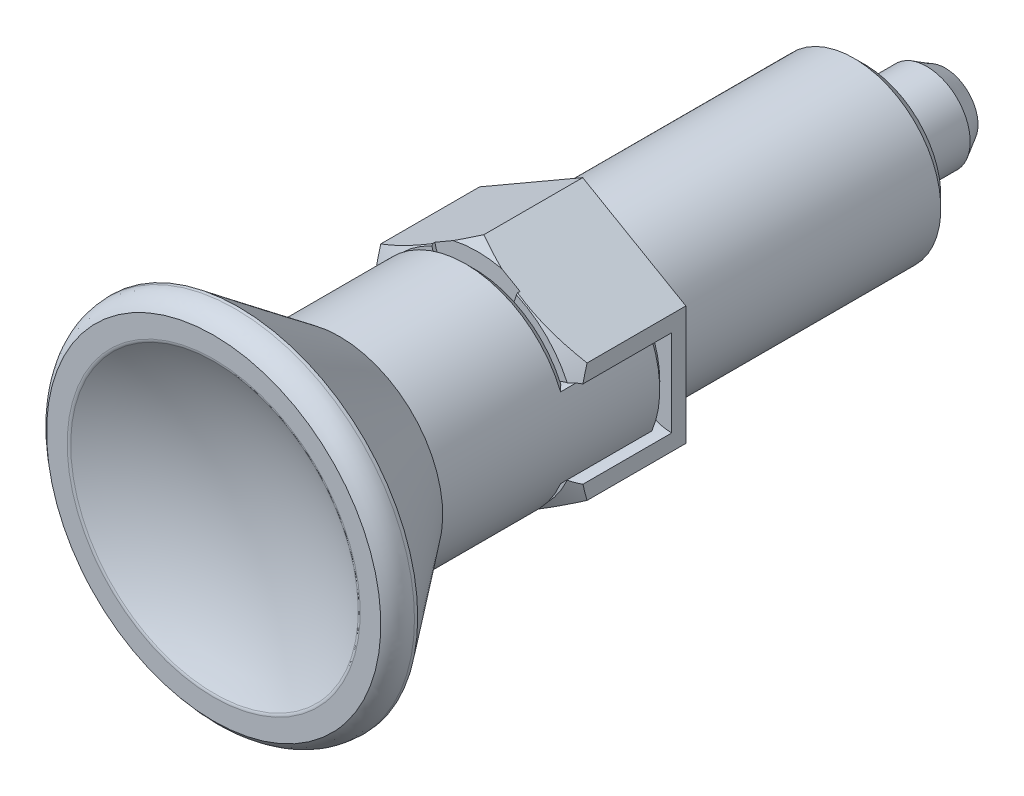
ISO-10303-21;
HEADER;
FILE_DESCRIPTION(('STEP AP214'),'2;1');
FILE_NAME('part.step','',(''),(''),'','','');
FILE_SCHEMA(('AUTOMOTIVE_DESIGN { 1 0 10303 214 1 1 1 1 }'));
ENDSEC;
DATA;
#1=APPLICATION_CONTEXT('core data for automotive mechanical design processes');
#2=APPLICATION_PROTOCOL_DEFINITION('international standard','automotive_design',2000,#1);
#3=PRODUCT_CONTEXT('',#1,'mechanical');
#4=PRODUCT('Part','Part','',(#3));
#5=PRODUCT_RELATED_PRODUCT_CATEGORY('part','',(#4));
#6=PRODUCT_DEFINITION_FORMATION('','',#4);
#7=PRODUCT_DEFINITION_CONTEXT('part definition',#1,'design');
#8=PRODUCT_DEFINITION('design','',#6,#7);
#9=PRODUCT_DEFINITION_SHAPE('','',#8);
#10=(LENGTH_UNIT() NAMED_UNIT(*) SI_UNIT(.MILLI.,.METRE.));
#11=(NAMED_UNIT(*) PLANE_ANGLE_UNIT() SI_UNIT($,.RADIAN.));
#12=(NAMED_UNIT(*) SI_UNIT($,.STERADIAN.) SOLID_ANGLE_UNIT());
#13=UNCERTAINTY_MEASURE_WITH_UNIT(LENGTH_MEASURE(1.E-05),#10,'distance_accuracy_value','');
#14=(GEOMETRIC_REPRESENTATION_CONTEXT(3) GLOBAL_UNCERTAINTY_ASSIGNED_CONTEXT((#13)) GLOBAL_UNIT_ASSIGNED_CONTEXT((#10,
#11,#12)) REPRESENTATION_CONTEXT('',''));
#15=CARTESIAN_POINT('',(0.,0.,0.));
#16=DIRECTION('',(0.,0.,1.));
#17=DIRECTION('',(1.,0.,0.));
#18=AXIS2_PLACEMENT_3D('',#15,#16,#17);
#19=CARTESIAN_POINT('',(-5.85947441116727,-5.85947441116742,-26.));
#20=DIRECTION('',(0.,0.,-1.));
#21=DIRECTION('',(0.,1.,0.));
#22=AXIS2_PLACEMENT_3D('',#19,#20,#21);
#23=PLANE('',#22);
#24=CARTESIAN_POINT('',(1.52655665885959E-13,0.,-26.));
#25=DIRECTION('',(0.,0.,-1.));
#26=DIRECTION('',(0.,1.,0.));
#27=AXIS2_PLACEMENT_3D('',#24,#25,#26);
#28=CIRCLE('',#27,4.1);
#29=CARTESIAN_POINT('',(1.52655665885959E-13,4.1,-26.));
#30=VERTEX_POINT('',#29);
#31=EDGE_CURVE('E24',#30,#30,#28,.T.);
#32=ORIENTED_EDGE('',*,*,#31,.F.);
#33=EDGE_LOOP('',(#32));
#34=FACE_BOUND('',#33,.T.);
#35=CARTESIAN_POINT('',(0.,0.,-26.));
#36=DIRECTION('',(0.,0.,1.));
#37=DIRECTION('',(-1.,0.,0.));
#38=AXIS2_PLACEMENT_3D('',#35,#36,#37);
#39=CIRCLE('',#38,7.);
#40=CARTESIAN_POINT('',(-7.,0.,-26.));
#41=VERTEX_POINT('',#40);
#42=EDGE_CURVE('E682',#41,#41,#39,.T.);
#43=ORIENTED_EDGE('',*,*,#42,.F.);
#44=EDGE_LOOP('',(#43));
#45=FACE_BOUND('',#44,.T.);
#46=ADVANCED_FACE('F14',(#34,#45),#23,.T.);
#47=CARTESIAN_POINT('',(1.52655665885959E-13,4.1,-26.));
#48=CARTESIAN_POINT('',(1.58235880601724E-13,3.90000000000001,-26.));
#49=CARTESIAN_POINT('',(1.52655665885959E-13,3.9,-26.2));
#50=CARTESIAN_POINT('',(7.10140831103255,4.1,-26.));
#51=CARTESIAN_POINT('',(6.75499814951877,3.9,-26.));
#52=CARTESIAN_POINT('',(6.75499814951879,3.9,-26.2));
#53=CARTESIAN_POINT('',(3.55070415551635,-2.05,-26.));
#54=CARTESIAN_POINT('',(3.37749907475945,-1.95,-26.));
#55=CARTESIAN_POINT('',(3.37749907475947,-1.95,-26.2));
#56=CARTESIAN_POINT('',(1.52655665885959E-13,-8.2,-26.));
#57=CARTESIAN_POINT('',(1.59462515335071E-13,-7.80000000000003,-26.));
#58=CARTESIAN_POINT('',(1.52655665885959E-13,-7.8,-26.2));
#59=CARTESIAN_POINT('',(-3.55070415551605,-2.05,-26.));
#60=CARTESIAN_POINT('',(-3.37749907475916,-1.95,-26.));
#61=CARTESIAN_POINT('',(-3.37749907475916,-1.95,-26.2));
#62=CARTESIAN_POINT('',(-7.10140831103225,4.1,-26.));
#63=CARTESIAN_POINT('',(-6.75499814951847,3.89999999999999,-26.));
#64=CARTESIAN_POINT('',(-6.75499814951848,3.9,-26.2));
#65=CARTESIAN_POINT('',(1.52655665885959E-13,4.1,-26.));
#66=CARTESIAN_POINT('',(1.58235880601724E-13,3.90000000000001,-26.));
#67=CARTESIAN_POINT('',(1.52655665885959E-13,3.9,-26.2));
#68=(BOUNDED_SURFACE() B_SPLINE_SURFACE(2,2,((#47,#48,#49),(#50,#51,#52),(#53,#54,#55),(#56,#57,
#58),(#59,#60,#61),(#62,#63,#64),(#65,#66,#67)),.UNSPECIFIED.,.T.,.F.,
.F.) B_SPLINE_SURFACE_WITH_KNOTS((3,2,2,3),(3,3),(0.,34.2822966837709,68.5645933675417,
102.846890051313),(0.,1.),
.UNSPECIFIED.) GEOMETRIC_REPRESENTATION_ITEM() RATIONAL_B_SPLINE_SURFACE(((1.,0.707106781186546,
1.),(0.5,0.353553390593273,0.5),(1.,0.707106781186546,1.),(0.5,0.353553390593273,0.5),(1.,
0.707106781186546,1.),(0.5,0.353553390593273,0.5),(1.,0.707106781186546,1.))) REPRESENTATION_ITEM('') SURFACE());
#69=CARTESIAN_POINT('',(1.52655665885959E-13,0.,-26.2));
#70=DIRECTION('',(0.,0.,-1.));
#71=DIRECTION('',(0.,1.,0.));
#72=AXIS2_PLACEMENT_3D('',#69,#70,#71);
#73=CIRCLE('',#72,3.9);
#74=CARTESIAN_POINT('',(1.52655665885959E-13,3.9,-26.2));
#75=VERTEX_POINT('',#74);
#76=EDGE_CURVE('E995',#75,#75,#73,.T.);
#77=CARTESIAN_POINT('',(1.52655665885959E-13,4.1,-26.));
#78=CARTESIAN_POINT('',(1.52696955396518E-13,4.09852014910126,-25.9999999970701));
#79=CARTESIAN_POINT('',(1.52737786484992E-13,4.09704029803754,-26.000016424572));
#80=CARTESIAN_POINT('',(1.52818874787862E-13,4.09406802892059,-26.0000824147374));
#81=CARTESIAN_POINT('',(1.5285912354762E-13,4.09257561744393,-26.0001322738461));
#82=CARTESIAN_POINT('',(1.52938996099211E-13,4.08957919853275,-26.0002659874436));
#83=CARTESIAN_POINT('',(1.52978611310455E-13,4.0880752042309,-26.0003501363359));
#84=CARTESIAN_POINT('',(1.53057165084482E-13,4.08505664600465,-26.0005532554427));
#85=CARTESIAN_POINT('',(1.53096094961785E-13,4.08354210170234,-26.0006725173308));
#86=CARTESIAN_POINT('',(1.53173225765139E-13,4.08050352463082,-26.0009466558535));
#87=CARTESIAN_POINT('',(1.53211417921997E-13,4.07897951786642,-26.0011018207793));
#88=CARTESIAN_POINT('',(1.53287020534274E-13,4.07592315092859,-26.0014485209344));
#89=CARTESIAN_POINT('',(1.53324422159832E-13,4.07439082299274,-26.0016403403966));
#90=CARTESIAN_POINT('',(1.53398390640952E-13,4.07131900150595,-26.0020610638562));
#91=CARTESIAN_POINT('',(1.53434948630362E-13,4.06977954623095,-26.0022902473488));
#92=CARTESIAN_POINT('',(1.53507176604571E-13,4.06669470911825,-26.0027863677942));
#93=CARTESIAN_POINT('',(1.53542837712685E-13,4.06514937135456,-26.0030535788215));
#94=CARTESIAN_POINT('',(1.53613218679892E-13,4.0620540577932,-26.0036263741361));
#95=CARTESIAN_POINT('',(1.53647929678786E-13,4.06050413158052,-26.003932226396));
#96=CARTESIAN_POINT('',(1.53716357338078E-13,4.05740097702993,-26.0045828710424));
#97=CARTESIAN_POINT('',(1.53750065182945E-13,4.05584780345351,-26.004927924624));
#98=CARTESIAN_POINT('',(1.53816433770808E-13,4.05273953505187,-26.0056574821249));
#99=CARTESIAN_POINT('',(1.53849085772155E-13,4.05118449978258,-26.006042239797));
#100=CARTESIAN_POINT('',(1.53913290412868E-13,4.04807393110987,-26.0068516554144));
#101=CARTESIAN_POINT('',(1.53944834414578E-13,4.04651846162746,-26.0072765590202));
#102=CARTESIAN_POINT('',(1.54006771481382E-13,4.04340848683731,-26.0081666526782));
#103=CARTESIAN_POINT('',(1.54037156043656E-13,4.04185404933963,-26.0086320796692));
#104=CARTESIAN_POINT('',(1.54096723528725E-13,4.0387476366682,-26.0096035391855));
#105=CARTESIAN_POINT('',(1.54125898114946E-13,4.03719573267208,-26.0101097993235));
#106=CARTESIAN_POINT('',(1.54182996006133E-13,4.03409591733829,-26.011163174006));
#107=CARTESIAN_POINT('',(1.54210911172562E-13,4.03254807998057,-26.0117105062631));
#108=CARTESIAN_POINT('',(1.54265441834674E-13,4.02945795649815,-26.0128462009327));
#109=CARTESIAN_POINT('',(1.54292049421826E-13,4.02791574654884,-26.0134347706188));
#110=CARTESIAN_POINT('',(1.54343917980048E-13,4.02483846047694,-26.0146530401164));
#111=CARTESIAN_POINT('',(1.54369171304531E-13,4.02330346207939,-26.0152829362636));
#112=CARTESIAN_POINT('',(1.54418286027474E-13,4.020242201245,-26.0165838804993));
#113=CARTESIAN_POINT('',(1.54442140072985E-13,4.01871601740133,-26.017255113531));
#114=CARTESIAN_POINT('',(1.54488412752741E-13,4.01567400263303,-26.0186386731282));
#115=CARTESIAN_POINT('',(1.54510824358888E-13,4.01415825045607,-26.0193511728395));
#116=CARTESIAN_POINT('',(1.54554170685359E-13,4.01113872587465,-26.0208171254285));
#117=CARTESIAN_POINT('',(1.54575098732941E-13,4.00963503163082,-26.0215707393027));
#118=CARTESIAN_POINT('',(1.54615438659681E-13,4.0066412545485,-26.0231186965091));
#119=CARTESIAN_POINT('',(1.54634844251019E-13,4.00515124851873,-26.0239131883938));
#120=CARTESIAN_POINT('',(1.54672102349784E-13,4.0021864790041,-26.0255425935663));
#121=CARTESIAN_POINT('',(1.54689948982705E-13,4.0007117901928,-26.0263776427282));
#122=CARTESIAN_POINT('',(1.54724054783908E-13,3.99777928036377,-26.0280877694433));
#123=CARTESIAN_POINT('',(1.54740308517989E-13,3.99632153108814,-26.0289629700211));
#124=CARTESIAN_POINT('',(1.54771196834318E-13,3.99342451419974,-26.0307529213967));
#125=CARTESIAN_POINT('',(1.54785826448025E-13,3.99198531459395,-26.0316677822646));
#126=CARTESIAN_POINT('',(1.54813437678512E-13,3.98912699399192,-26.0335364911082));
#127=CARTESIAN_POINT('',(1.54826414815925E-13,3.98770793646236,-26.0344904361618));
#128=CARTESIAN_POINT('',(1.54850695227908E-13,3.98489147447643,-26.0364366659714));
#129=CARTESIAN_POINT('',(1.54861994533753E-13,3.98349412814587,-26.0374290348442));
#130=CARTESIAN_POINT('',(1.54882896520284E-13,3.98072263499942,-26.039451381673));
#131=CARTESIAN_POINT('',(1.54892495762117E-13,3.97934854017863,-26.0404814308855));
#132=CARTESIAN_POINT('',(1.54909978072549E-13,3.97662506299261,-26.0425783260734));
#133=CARTESIAN_POINT('',(1.54917858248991E-13,3.97527572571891,-26.0436452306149));
#134=CARTESIAN_POINT('',(1.54931886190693E-13,3.97260323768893,-26.045814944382));
#135=CARTESIAN_POINT('',(1.54938031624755E-13,3.97128012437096,-26.0469177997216));
#136=CARTESIAN_POINT('',(1.54948577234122E-13,3.96866151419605,-26.04915844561));
#137=CARTESIAN_POINT('',(1.5495297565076E-13,3.96736604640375,-26.0502962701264));
#138=CARTESIAN_POINT('',(1.54960017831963E-13,3.96480410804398,-26.05260581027));
#139=CARTESIAN_POINT('',(1.54962660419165E-13,3.96353765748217,-26.0537775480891));
#140=CARTESIAN_POINT('',(1.54966185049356E-13,3.96103508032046,-26.0561537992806));
#141=CARTESIAN_POINT('',(1.54967066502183E-13,3.95979896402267,-26.0573583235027));
#142=CARTESIAN_POINT('',(1.54967066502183E-13,3.95735832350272,-26.0597989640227));
#143=CARTESIAN_POINT('',(1.54966185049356E-13,3.95615379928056,-26.0610350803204));
#144=CARTESIAN_POINT('',(1.54962660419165E-13,3.95377754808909,-26.0635376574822));
#145=CARTESIAN_POINT('',(1.54960017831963E-13,3.95260581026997,-26.064804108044));
#146=CARTESIAN_POINT('',(1.5495297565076E-13,3.95029627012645,-26.0673660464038));
#147=CARTESIAN_POINT('',(1.54948577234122E-13,3.94915844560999,-26.068661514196));
#148=CARTESIAN_POINT('',(1.54938031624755E-13,3.94691779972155,-26.071280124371));
#149=CARTESIAN_POINT('',(1.54931886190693E-13,3.94581494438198,-26.0726032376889));
#150=CARTESIAN_POINT('',(1.54917858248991E-13,3.94364523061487,-26.0752757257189));
#151=CARTESIAN_POINT('',(1.54909978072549E-13,3.9425783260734,-26.0766250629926));
#152=CARTESIAN_POINT('',(1.54892495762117E-13,3.94048143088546,-26.0793485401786));
#153=CARTESIAN_POINT('',(1.54882896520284E-13,3.93945138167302,-26.0807226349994));
#154=CARTESIAN_POINT('',(1.54861994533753E-13,3.93742903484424,-26.0834941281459));
#155=CARTESIAN_POINT('',(1.54850695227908E-13,3.93643666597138,-26.0848914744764));
#156=CARTESIAN_POINT('',(1.54826414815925E-13,3.9344904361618,-26.0877079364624));
#157=CARTESIAN_POINT('',(1.54813437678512E-13,3.93353649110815,-26.0891269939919));
#158=CARTESIAN_POINT('',(1.54785826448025E-13,3.93166778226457,-26.0919853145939));
#159=CARTESIAN_POINT('',(1.54771196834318E-13,3.93075292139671,-26.0934245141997));
#160=CARTESIAN_POINT('',(1.54740308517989E-13,3.92896297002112,-26.0963215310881));
#161=CARTESIAN_POINT('',(1.54724054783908E-13,3.92808776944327,-26.0977792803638));
#162=CARTESIAN_POINT('',(1.54689948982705E-13,3.92637764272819,-26.1007117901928));
#163=CARTESIAN_POINT('',(1.54672102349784E-13,3.92554259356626,-26.1021864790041));
#164=CARTESIAN_POINT('',(1.54634844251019E-13,3.92391318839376,-26.1051512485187));
#165=CARTESIAN_POINT('',(1.54615438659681E-13,3.92311869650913,-26.1066412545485));
#166=CARTESIAN_POINT('',(1.54575098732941E-13,3.92157073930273,-26.1096350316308));
#167=CARTESIAN_POINT('',(1.54554170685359E-13,3.9208171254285,-26.1111387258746));
#168=CARTESIAN_POINT('',(1.54510824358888E-13,3.91935117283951,-26.1141582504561));
#169=CARTESIAN_POINT('',(1.54488412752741E-13,3.91863867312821,-26.115674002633));
#170=CARTESIAN_POINT('',(1.54442140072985E-13,3.91725511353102,-26.1187160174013));
#171=CARTESIAN_POINT('',(1.54418286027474E-13,3.91658388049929,-26.120242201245));
#172=CARTESIAN_POINT('',(1.54369171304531E-13,3.91528293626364,-26.1233034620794));
#173=CARTESIAN_POINT('',(1.54343917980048E-13,3.91465304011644,-26.1248384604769));
#174=CARTESIAN_POINT('',(1.54292049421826E-13,3.91343477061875,-26.1279157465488));
#175=CARTESIAN_POINT('',(1.54265441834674E-13,3.91284620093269,-26.1294579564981));
#176=CARTESIAN_POINT('',(1.54210911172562E-13,3.91171050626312,-26.1325480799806));
#177=CARTESIAN_POINT('',(1.54182996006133E-13,3.91116317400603,-26.1340959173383));
#178=CARTESIAN_POINT('',(1.54125898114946E-13,3.91010979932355,-26.1371957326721));
#179=CARTESIAN_POINT('',(1.54096723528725E-13,3.9096035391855,-26.1387476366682));
#180=CARTESIAN_POINT('',(1.54037156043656E-13,3.90863207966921,-26.1418540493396));
#181=CARTESIAN_POINT('',(1.54006771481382E-13,3.90816665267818,-26.1434084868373));
#182=CARTESIAN_POINT('',(1.53944834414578E-13,3.90727655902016,-26.1465184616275));
#183=CARTESIAN_POINT('',(1.53913290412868E-13,3.90685165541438,-26.1480739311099));
#184=CARTESIAN_POINT('',(1.53849085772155E-13,3.90604223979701,-26.1511844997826));
#185=CARTESIAN_POINT('',(1.53816433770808E-13,3.90565748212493,-26.1527395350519));
#186=CARTESIAN_POINT('',(1.53750065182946E-13,3.90492792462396,-26.1558478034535));
#187=CARTESIAN_POINT('',(1.53716357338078E-13,3.90458287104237,-26.1574009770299));
#188=CARTESIAN_POINT('',(1.53647929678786E-13,3.90393222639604,-26.1605041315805));
#189=CARTESIAN_POINT('',(1.53613218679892E-13,3.90362637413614,-26.1620540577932));
#190=CARTESIAN_POINT('',(1.53542837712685E-13,3.90305357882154,-26.1651493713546));
#191=CARTESIAN_POINT('',(1.53507176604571E-13,3.90278636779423,-26.1666947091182));
#192=CARTESIAN_POINT('',(1.53434948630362E-13,3.90229024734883,-26.1697795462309));
#193=CARTESIAN_POINT('',(1.53398390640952E-13,3.90206106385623,-26.1713190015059));
#194=CARTESIAN_POINT('',(1.53324422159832E-13,3.90164034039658,-26.1743908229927));
#195=CARTESIAN_POINT('',(1.53287020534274E-13,3.90144852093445,-26.1759231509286));
#196=CARTESIAN_POINT('',(1.53211417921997E-13,3.90110182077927,-26.1789795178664));
#197=CARTESIAN_POINT('',(1.53173225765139E-13,3.90094665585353,-26.1805035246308));
#198=CARTESIAN_POINT('',(1.53096094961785E-13,3.90067251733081,-26.1835421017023));
#199=CARTESIAN_POINT('',(1.53057165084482E-13,3.90055325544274,-26.1850566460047));
#200=CARTESIAN_POINT('',(1.52978611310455E-13,3.9003501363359,-26.1880752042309));
#201=CARTESIAN_POINT('',(1.52938996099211E-13,3.90026598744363,-26.1895791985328));
#202=CARTESIAN_POINT('',(1.5285912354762E-13,3.90013227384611,-26.1925756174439));
#203=CARTESIAN_POINT('',(1.52818874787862E-13,3.90008241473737,-26.1940680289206));
#204=CARTESIAN_POINT('',(1.52737786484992E-13,3.90001642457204,-26.1970402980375));
#205=CARTESIAN_POINT('',(1.52696955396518E-13,3.89999999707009,-26.1985201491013));
#206=CARTESIAN_POINT('',(1.52655665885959E-13,3.9,-26.2));
#207=B_SPLINE_CURVE_WITH_KNOTS('',3,(#77,#78,#79,#80,#81,#82,#83,#84,#85,#86,#87,#88,#89,#90,
#91,#92,#93,#94,#95,#96,#97,#98,#99,#100,#101,#102,#103,#104,#105,#106,#107,#108,#109,#110,#111,
#112,#113,#114,#115,#116,#117,#118,#119,#120,#121,#122,#123,#124,#125,#126,#127,#128,#129,#130,
#131,#132,#133,#134,#135,#136,#137,#138,#139,#140,#141,#142,#143,#144,#145,#146,#147,#148,#149,
#150,#151,#152,#153,#154,#155,#156,#157,#158,#159,#160,#161,#162,#163,#164,#165,#166,#167,#168,
#169,#170,#171,#172,#173,#174,#175,#176,#177,#178,#179,#180,#181,#182,#183,#184,#185,#186,#187,
#188,#189,#190,#191,#192,#193,#194,#195,#196,#197,#198,#199,#200,#201,#202,#203,#204,#205,#206),
.UNSPECIFIED.,.F.,.F.,(4,2,2,2,2,2,2,2,2,2,2,2,2,2,2,2,2,2,2,2,2,2,2,2,2,2,2,2,2,2,2,2,2,2,2,2,
2,2,2,2,2,2,2,2,2,2,2,2,2,2,2,2,2,2,2,2,2,2,2,2,2,2,2,2,4),(0.,0.00443946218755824,
0.00891881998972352,0.0134374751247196,0.0179947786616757,0.0225900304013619,0.0272224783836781,
0.0318913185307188,0.0365956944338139,0.0413346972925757,0.0461073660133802,0.0509126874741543,
0.0557495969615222,0.0606169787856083,0.0655136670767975,0.0704384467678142,0.0753900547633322,
0.0803671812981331,0.0853684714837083,0.0903925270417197,0.095437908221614,0.100503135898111,
0.105586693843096,0.110687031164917,0.115802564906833,0.120931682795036,0.126072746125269,
0.131224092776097,0.136384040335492,0.141550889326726,0.146722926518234,0.151898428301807,
0.157075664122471,0.162252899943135,0.167428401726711,0.172600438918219,0.177767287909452,
0.182927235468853,0.188078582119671,0.193219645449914,0.198348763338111,0.203464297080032,
0.208564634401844,0.213648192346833,0.218713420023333,0.223758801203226,0.228782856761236,
0.233784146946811,0.238761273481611,0.243712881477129,0.248637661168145,0.253534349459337,
0.258401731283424,0.263238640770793,0.26804396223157,0.272816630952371,0.277555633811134,
0.282260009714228,0.286928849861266,0.291561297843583,0.296156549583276,0.300713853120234,
0.305232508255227,0.309711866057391,0.314151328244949),.UNSPECIFIED.);
#208=EDGE_CURVE('BSEAM1140',#30,#75,#207,.T.);
#209=ORIENTED_EDGE('',*,*,#31,.T.);
#210=ORIENTED_EDGE('',*,*,#76,.F.);
#211=ORIENTED_EDGE('',*,*,#208,.T.);
#212=ORIENTED_EDGE('',*,*,#208,.F.);
#213=EDGE_LOOP('',(#209,#211,#210,#212));
#214=FACE_BOUND('',#213,.T.);
#215=ADVANCED_FACE('F1140',(#214),#68,.T.);
#216=CARTESIAN_POINT('',(1.52655665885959E-13,0.,-26.2));
#217=DIRECTION('',(0.,0.,-1.));
#218=DIRECTION('',(0.,1.,0.));
#219=AXIS2_PLACEMENT_3D('',#216,#217,#218);
#220=CYLINDRICAL_SURFACE('',#219,3.9);
#221=ORIENTED_EDGE('',*,*,#76,.T.);
#222=EDGE_LOOP('',(#221));
#223=FACE_BOUND('',#222,.T.);
#224=CARTESIAN_POINT('',(1.52655665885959E-13,0.,-26.2732050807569));
#225=DIRECTION('',(0.,0.,-1.));
#226=DIRECTION('',(0.,1.,0.));
#227=AXIS2_PLACEMENT_3D('',#224,#225,#226);
#228=CIRCLE('',#227,3.9);
#229=CARTESIAN_POINT('',(1.52655665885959E-13,3.9,-26.2732050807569));
#230=VERTEX_POINT('',#229);
#231=EDGE_CURVE('E999',#230,#230,#228,.T.);
#232=ORIENTED_EDGE('',*,*,#231,.F.);
#233=EDGE_LOOP('',(#232));
#234=FACE_BOUND('',#233,.T.);
#235=ADVANCED_FACE('F1131',(#223,#234),#220,.T.);
#236=CARTESIAN_POINT('',(1.52655665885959E-13,3.9,-26.2732050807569));
#237=CARTESIAN_POINT('',(1.40081595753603E-13,3.89999999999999,-26.3267949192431));
#238=CARTESIAN_POINT('',(1.52655665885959E-13,3.92679491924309,-26.3732050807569));
#239=CARTESIAN_POINT('',(6.75499814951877,3.9,-26.2732050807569));
#240=CARTESIAN_POINT('',(6.75499814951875,3.9,-26.3267949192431));
#241=CARTESIAN_POINT('',(6.80140831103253,3.92679491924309,-26.3732050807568));
#242=CARTESIAN_POINT('',(3.37749907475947,-1.95,-26.2732050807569));
#243=CARTESIAN_POINT('',(3.37749907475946,-1.94999999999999,-26.3267949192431));
#244=CARTESIAN_POINT('',(3.40070415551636,-1.96339745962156,-26.3732050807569));
#245=CARTESIAN_POINT('',(1.52655665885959E-13,-7.8,-26.2732050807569));
#246=CARTESIAN_POINT('',(1.49061185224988E-13,-7.79999999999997,-26.3267949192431));
#247=CARTESIAN_POINT('',(1.52655665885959E-13,-7.8535898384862,-26.3732050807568));
#248=CARTESIAN_POINT('',(-3.37749907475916,-1.95,-26.2732050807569));
#249=CARTESIAN_POINT('',(-3.37749907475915,-1.94999999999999,-26.3267949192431));
#250=CARTESIAN_POINT('',(-3.40070415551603,-1.96339745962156,-26.3732050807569));
#251=CARTESIAN_POINT('',(-6.75499814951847,3.9,-26.2732050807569));
#252=CARTESIAN_POINT('',(-6.75499814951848,3.89999999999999,-26.3267949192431));
#253=CARTESIAN_POINT('',(-6.80140831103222,3.92679491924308,-26.3732050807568));
#254=CARTESIAN_POINT('',(1.52655665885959E-13,3.9,-26.2732050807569));
#255=CARTESIAN_POINT('',(1.40081595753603E-13,3.89999999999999,-26.3267949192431));
#256=CARTESIAN_POINT('',(1.52655665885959E-13,3.92679491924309,-26.3732050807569));
#257=(BOUNDED_SURFACE() B_SPLINE_SURFACE(2,2,((#236,#237,#238),(#239,#240,#241),(#242,#243,
#244),(#245,#246,#247),(#248,#249,#250),(#251,#252,#253),(#254,#255,#256)),.UNSPECIFIED.,.T.,
.F.,.F.) B_SPLINE_SURFACE_WITH_KNOTS((3,2,2,3),(3,3),(0.,126.270240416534,252.540480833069,
378.810721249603),(0.,1.),
.UNSPECIFIED.) GEOMETRIC_REPRESENTATION_ITEM() RATIONAL_B_SPLINE_SURFACE(((1.,0.965925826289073,
1.),(0.5,0.482962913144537,0.5),(1.,0.965925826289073,1.),(0.5,0.482962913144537,0.5),(1.,
0.965925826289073,1.),(0.5,0.482962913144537,0.5),(1.,0.965925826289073,1.))) REPRESENTATION_ITEM('') SURFACE());
#258=CARTESIAN_POINT('',(1.52655665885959E-13,0.,-26.3732050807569));
#259=DIRECTION('',(0.,0.,-1.));
#260=DIRECTION('',(0.,1.,0.));
#261=AXIS2_PLACEMENT_3D('',#258,#259,#260);
#262=CIRCLE('',#261,3.9267949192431);
#263=CARTESIAN_POINT('',(1.52655665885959E-13,3.92679491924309,-26.3732050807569));
#264=VERTEX_POINT('',#263);
#265=EDGE_CURVE('E1003',#264,#264,#262,.T.);
#266=CARTESIAN_POINT('',(1.52655665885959E-13,3.9,-26.2732050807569));
#267=CARTESIAN_POINT('',(1.52402367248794E-13,3.89999999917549,-26.2742846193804));
#268=CARTESIAN_POINT('',(1.52156723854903E-13,3.90000874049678,-26.2753641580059));
#269=CARTESIAN_POINT('',(1.51680332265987E-13,3.9000437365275,-26.2775251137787));
#270=CARTESIAN_POINT('',(1.51449614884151E-13,3.90007002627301,-26.2786065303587));
#271=CARTESIAN_POINT('',(1.51003257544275E-13,3.90014021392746,-26.2807708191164));
#272=CARTESIAN_POINT('',(1.50787646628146E-13,3.90018414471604,-26.2818536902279));
#273=CARTESIAN_POINT('',(1.50371672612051E-13,3.90028969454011,-26.2840204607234));
#274=CARTESIAN_POINT('',(1.50171336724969E-13,3.90035134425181,-26.2851043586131));
#275=CARTESIAN_POINT('',(1.49786072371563E-13,3.90049239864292,-26.2872727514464));
#276=CARTESIAN_POINT('',(1.49601169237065E-13,3.90057183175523,-26.2883572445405));
#277=CARTESIAN_POINT('',(1.49246918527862E-13,3.90074850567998,-26.2905263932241));
#278=CARTESIAN_POINT('',(1.49077594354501E-13,3.90084577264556,-26.2916110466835));
#279=CARTESIAN_POINT('',(1.48754638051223E-13,3.90105815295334,-26.2937800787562));
#280=CARTESIAN_POINT('',(1.48601027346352E-13,3.90117329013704,-26.2948644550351));
#281=CARTESIAN_POINT('',(1.48309622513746E-13,3.90142143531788,-26.2970324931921));
#282=CARTESIAN_POINT('',(1.48171847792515E-13,3.90155446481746,-26.2981161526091));
#283=CARTESIAN_POINT('',(1.47912227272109E-13,3.90183840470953,-26.3002823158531));
#284=CARTESIAN_POINT('',(1.47790398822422E-13,3.90198933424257,-26.3013648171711));
#285=CARTESIAN_POINT('',(1.47562770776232E-13,3.90230906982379,-26.3035282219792));
#286=CARTESIAN_POINT('',(1.47456986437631E-13,3.90247789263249,-26.3046091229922));
#287=CARTESIAN_POINT('',(1.47261533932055E-13,3.90283339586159,-26.3067688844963));
#288=CARTESIAN_POINT('',(1.47171878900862E-13,3.90302009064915,-26.3078477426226));
#289=CARTESIAN_POINT('',(1.47008759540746E-13,3.90341130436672,-26.3100029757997));
#290=CARTESIAN_POINT('',(1.46935306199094E-13,3.90361583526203,-26.3110793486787));
#291=CARTESIAN_POINT('',(1.4680465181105E-13,3.9040426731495,-26.3132291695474));
#292=CARTESIAN_POINT('',(1.46747459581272E-13,3.90426498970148,-26.3143026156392));
#293=CARTESIAN_POINT('',(1.46649375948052E-13,3.90472733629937,-26.3164461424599));
#294=CARTESIAN_POINT('',(1.46608491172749E-13,3.90496737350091,-26.3175162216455));
#295=CARTESIAN_POINT('',(1.465430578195E-13,3.90546508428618,-26.3196525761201));
#296=CARTESIAN_POINT('',(1.46518513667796E-13,3.9057227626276,-26.3207188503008));
#297=CARTESIAN_POINT('',(1.46485783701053E-13,3.90625566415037,-26.322847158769));
#298=CARTESIAN_POINT('',(1.46477600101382E-13,3.90653088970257,-26.323909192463));
#299=CARTESIAN_POINT('',(1.46477600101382E-13,3.90709877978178,-26.3260285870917));
#300=CARTESIAN_POINT('',(1.46485783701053E-13,3.90739144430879,-26.3270859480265));
#301=CARTESIAN_POINT('',(1.46518513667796E-13,3.90799409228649,-26.3291955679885));
#302=CARTESIAN_POINT('',(1.465430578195E-13,3.90830407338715,-26.3302478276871));
#303=CARTESIAN_POINT('',(1.46608491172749E-13,3.90894122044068,-26.3323468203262));
#304=CARTESIAN_POINT('',(1.46649375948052E-13,3.90926838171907,-26.3333935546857));
#305=CARTESIAN_POINT('',(1.46747459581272E-13,3.90993974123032,-26.3354810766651));
#306=CARTESIAN_POINT('',(1.4680465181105E-13,3.91028393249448,-26.3365218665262));
#307=CARTESIAN_POINT('',(1.46935306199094E-13,3.91098919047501,-26.3385970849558));
#308=CARTESIAN_POINT('',(1.47008759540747E-13,3.91135024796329,-26.3396315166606));
#309=CARTESIAN_POINT('',(1.47171878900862E-13,3.91208906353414,-26.3416936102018));
#310=CARTESIAN_POINT('',(1.47261533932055E-13,3.9124668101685,-26.3427212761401));
#311=CARTESIAN_POINT('',(1.47456986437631E-13,3.91323881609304,-26.3447694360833));
#312=CARTESIAN_POINT('',(1.47562770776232E-13,3.91363306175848,-26.3457899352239));
#313=CARTESIAN_POINT('',(1.47790398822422E-13,3.91443786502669,-26.347823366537));
#314=CARTESIAN_POINT('',(1.47912227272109E-13,3.9148484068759,-26.3488363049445));
#315=CARTESIAN_POINT('',(1.48171847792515E-13,3.91568558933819,-26.3508542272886));
#316=CARTESIAN_POINT('',(1.48309622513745E-13,3.91611221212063,-26.3518592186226));
#317=CARTESIAN_POINT('',(1.48601027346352E-13,3.91698133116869,-26.3538608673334));
#318=CARTESIAN_POINT('',(1.48754638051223E-13,3.91742380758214,-26.35485753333));
#319=CARTESIAN_POINT('',(1.49077594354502E-13,3.91832439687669,-26.3568421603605));
#320=CARTESIAN_POINT('',(1.49246918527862E-13,3.91878248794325,-26.3578301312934));
#321=CARTESIAN_POINT('',(1.49601169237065E-13,3.91971405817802,-26.3597970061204));
#322=CARTESIAN_POINT('',(1.49786072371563E-13,3.92018751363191,-26.3607759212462));
#323=CARTESIAN_POINT('',(1.50171336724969E-13,3.92114955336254,-26.3627243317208));
#324=CARTESIAN_POINT('',(1.50371672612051E-13,3.92163811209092,-26.3636938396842));
#325=CARTESIAN_POINT('',(1.50787646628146E-13,3.92263008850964,-26.3656230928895));
#326=CARTESIAN_POINT('',(1.51003257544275E-13,3.92313347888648,-26.3665828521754));
#327=CARTESIAN_POINT('',(1.51449614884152E-13,3.92415483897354,-26.3684922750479));
#328=CARTESIAN_POINT('',(1.51680332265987E-13,3.92467277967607,-26.369441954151));
#329=CARTESIAN_POINT('',(1.52156723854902E-13,3.92572295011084,-26.3713308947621));
#330=CARTESIAN_POINT('',(1.52402367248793E-13,3.92625514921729,-26.3722701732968));
#331=CARTESIAN_POINT('',(1.52655665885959E-13,3.92679491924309,-26.3732050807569));
#332=B_SPLINE_CURVE_WITH_KNOTS('',3,(#266,#267,#268,#269,#270,#271,#272,#273,#274,#275,#276,
#277,#278,#279,#280,#281,#282,#283,#284,#285,#286,#287,#288,#289,#290,#291,#292,#293,#294,#295,
#296,#297,#298,#299,#300,#301,#302,#303,#304,#305,#306,#307,#308,#309,#310,#311,#312,#313,#314,
#315,#316,#317,#318,#319,#320,#321,#322,#323,#324,#325,#326,#327,#328,#329,#330,#331),
.UNSPECIFIED.,.F.,.F.,(4,2,2,2,2,2,2,2,2,2,2,2,2,2,2,2,2,2,2,2,2,2,2,2,2,2,2,2,2,2,2,2,4),(0.,
0.00323858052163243,0.0064836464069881,0.00973478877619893,0.0129915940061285,
0.0162536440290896,0.0195205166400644,0.0227917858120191,0.0260670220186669,0.0293457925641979,
0.0326276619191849,0.0359121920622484,0.0391989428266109,0.0424874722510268,0.0457773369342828,
0.0490680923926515,0.0523592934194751,0.0556504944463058,0.05894124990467,0.0622311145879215,
0.0655196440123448,0.0688063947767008,0.0720909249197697,0.0753727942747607,0.0786515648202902,
0.081926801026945,0.0851980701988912,0.0884649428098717,0.0917269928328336,0.0949837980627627,
0.0982349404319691,0.101480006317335,0.104718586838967),.UNSPECIFIED.);
#333=EDGE_CURVE('BSEAM1125',#230,#264,#332,.T.);
#334=ORIENTED_EDGE('',*,*,#231,.T.);
#335=ORIENTED_EDGE('',*,*,#265,.F.);
#336=ORIENTED_EDGE('',*,*,#333,.T.);
#337=ORIENTED_EDGE('',*,*,#333,.F.);
#338=EDGE_LOOP('',(#334,#336,#335,#337));
#339=FACE_BOUND('',#338,.T.);
#340=ADVANCED_FACE('F1125',(#339),#257,.T.);
#341=CARTESIAN_POINT('',(1.52655665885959E-13,0.,-26.3732050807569));
#342=DIRECTION('',(0.,0.,-1.));
#343=DIRECTION('',(0.,1.,0.));
#344=AXIS2_PLACEMENT_3D('',#341,#342,#343);
#345=CONICAL_SURFACE('',#344,3.92679491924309,0.523598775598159);
#346=ORIENTED_EDGE('',*,*,#265,.T.);
#347=EDGE_LOOP('',(#346));
#348=FACE_BOUND('',#347,.T.);
#349=CARTESIAN_POINT('',(1.52655665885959E-13,0.,-26.5));
#350=DIRECTION('',(0.,0.,-1.));
#351=DIRECTION('',(0.,1.,0.));
#352=AXIS2_PLACEMENT_3D('',#349,#350,#351);
#353=CIRCLE('',#352,4.);
#354=CARTESIAN_POINT('',(1.52655665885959E-13,3.99999999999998,-26.5));
#355=VERTEX_POINT('',#354);
#356=EDGE_CURVE('E1007',#355,#355,#353,.T.);
#357=ORIENTED_EDGE('',*,*,#356,.F.);
#358=EDGE_LOOP('',(#357));
#359=FACE_BOUND('',#358,.T.);
#360=ADVANCED_FACE('F1119',(#348,#359),#345,.T.);
#361=CARTESIAN_POINT('',(1.52655665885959E-13,0.,-26.5));
#362=DIRECTION('',(0.,0.,-1.));
#363=DIRECTION('',(0.,1.,0.));
#364=AXIS2_PLACEMENT_3D('',#361,#362,#363);
#365=CYLINDRICAL_SURFACE('',#364,4.);
#366=ORIENTED_EDGE('',*,*,#356,.T.);
#367=EDGE_LOOP('',(#366));
#368=FACE_BOUND('',#367,.T.);
#369=CARTESIAN_POINT('',(1.52655665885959E-13,0.,-31.7));
#370=DIRECTION('',(0.,0.,-1.));
#371=DIRECTION('',(0.,1.,0.));
#372=AXIS2_PLACEMENT_3D('',#369,#370,#371);
#373=CIRCLE('',#372,4.);
#374=CARTESIAN_POINT('',(1.52655665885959E-13,3.99999999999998,-31.7));
#375=VERTEX_POINT('',#374);
#376=EDGE_CURVE('E1011',#375,#375,#373,.T.);
#377=ORIENTED_EDGE('',*,*,#376,.F.);
#378=EDGE_LOOP('',(#377));
#379=FACE_BOUND('',#378,.T.);
#380=ADVANCED_FACE('F1111',(#368,#379),#365,.T.);
#381=CARTESIAN_POINT('',(1.52655665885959E-13,0.,-33.4113534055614));
#382=DIRECTION('',(0.,0.,1.));
#383=DIRECTION('',(0.,1.,0.));
#384=AXIS2_PLACEMENT_3D('',#381,#382,#383);
#385=CONICAL_SURFACE('',#384,3.01194965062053,0.523598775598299);
#386=ORIENTED_EDGE('',*,*,#376,.T.);
#387=EDGE_LOOP('',(#386));
#388=FACE_BOUND('',#387,.T.);
#389=CARTESIAN_POINT('',(1.52655665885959E-13,0.,-33.4113534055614));
#390=DIRECTION('',(0.,0.,-1.));
#391=DIRECTION('',(0.,1.,0.));
#392=AXIS2_PLACEMENT_3D('',#389,#390,#391);
#393=CIRCLE('',#392,3.01194965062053);
#394=CARTESIAN_POINT('',(1.52655665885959E-13,3.01194965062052,-33.4113534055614));
#395=VERTEX_POINT('',#394);
#396=EDGE_CURVE('E1015',#395,#395,#393,.T.);
#397=ORIENTED_EDGE('',*,*,#396,.F.);
#398=EDGE_LOOP('',(#397));
#399=FACE_BOUND('',#398,.T.);
#400=ADVANCED_FACE('F1103',(#388,#399),#385,.T.);
#401=CARTESIAN_POINT('',(1.52655665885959E-13,0.,-26.));
#402=DIRECTION('',(0.,0.,-1.));
#403=DIRECTION('',(0.,1.,0.));
#404=AXIS2_PLACEMENT_3D('',#401,#402,#403);
#405=SPHERICAL_SURFACE('',#404,8.0000000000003);
#406=ORIENTED_EDGE('',*,*,#396,.T.);
#407=EDGE_LOOP('',(#406));
#408=FACE_BOUND('',#407,.T.);
#409=ADVANCED_FACE('F16',(#408),#405,.T.);
#410=CARTESIAN_POINT('',(0.,-7.26849136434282E-13,56.303508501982));
#411=DIRECTION('',(0.,0.,-1.));
#412=DIRECTION('',(0.,1.,0.));
#413=AXIS2_PLACEMENT_3D('',#410,#411,#412);
#414=SPHERICAL_SURFACE('',#413,25.9999999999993);
#415=CARTESIAN_POINT('',(0.,0.,33.9302548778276));
#416=DIRECTION('',(0.,0.,1.));
#417=DIRECTION('',(0.,1.,0.));
#418=AXIS2_PLACEMENT_3D('',#415,#416,#417);
#419=CIRCLE('',#418,13.2452830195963);
#420=CARTESIAN_POINT('',(0.,13.2452830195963,33.9302548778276));
#421=VERTEX_POINT('',#420);
#422=EDGE_CURVE('E617',#421,#421,#419,.T.);
#423=ORIENTED_EDGE('',*,*,#422,.T.);
#424=EDGE_LOOP('',(#423));
#425=FACE_BOUND('',#424,.T.);
#426=ADVANCED_FACE('F503',(#425),#414,.F.);
#427=CARTESIAN_POINT('',(0.,13.2452830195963,33.9302548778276));
#428=CARTESIAN_POINT('',(0.,13.3630929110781,34.0000000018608));
#429=CARTESIAN_POINT('',(0.,13.5000000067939,34.));
#430=CARTESIAN_POINT('',(22.9415031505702,13.2452830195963,33.9302548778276));
#431=CARTESIAN_POINT('',(23.1455558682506,13.3630929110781,34.0000000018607));
#432=CARTESIAN_POINT('',(23.3826859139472,13.5000000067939,34.));
#433=CARTESIAN_POINT('',(11.4707515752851,-6.62264150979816,33.9302548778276));
#434=CARTESIAN_POINT('',(11.5727779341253,-6.68154645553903,34.0000000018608));
#435=CARTESIAN_POINT('',(11.6913429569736,-6.75000000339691,34.));
#436=CARTESIAN_POINT('',(0.,-26.4905660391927,33.9302548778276));
#437=CARTESIAN_POINT('',(0.,-26.7261858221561,34.0000000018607));
#438=CARTESIAN_POINT('',(0.,-27.0000000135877,34.));
#439=CARTESIAN_POINT('',(-11.4707515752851,-6.62264150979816,33.9302548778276));
#440=CARTESIAN_POINT('',(-11.5727779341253,-6.68154645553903,34.0000000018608));
#441=CARTESIAN_POINT('',(-11.6913429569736,-6.75000000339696,34.));
#442=CARTESIAN_POINT('',(-22.9415031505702,13.2452830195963,33.9302548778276));
#443=CARTESIAN_POINT('',(-23.1455558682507,13.363092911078,34.0000000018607));
#444=CARTESIAN_POINT('',(-23.3826859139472,13.5000000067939,34.));
#445=CARTESIAN_POINT('',(0.,13.2452830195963,33.9302548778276));
#446=CARTESIAN_POINT('',(0.,13.3630929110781,34.0000000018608));
#447=CARTESIAN_POINT('',(0.,13.5000000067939,34.));
#448=(BOUNDED_SURFACE() B_SPLINE_SURFACE(2,2,((#427,#428,#429),(#430,#431,#432),(#433,#434,
#435),(#436,#437,#438),(#439,#440,#441),(#442,#443,#444),(#445,#446,#447)),.UNSPECIFIED.,.T.,
.F.,.F.) B_SPLINE_SURFACE_WITH_KNOTS((3,2,2,3),(3,3),(0.,169.121801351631,338.243602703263,
507.365404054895),(0.,1.),
.UNSPECIFIED.) GEOMETRIC_REPRESENTATION_ITEM() RATIONAL_B_SPLINE_SURFACE(((1.,0.964497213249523,
1.),(0.5,0.482248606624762,0.5),(1.,0.964497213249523,1.),(0.5,0.482248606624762,0.5),(1.,
0.964497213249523,1.),(0.5,0.482248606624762,0.5),(1.,0.964497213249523,1.))) REPRESENTATION_ITEM('') SURFACE());
#449=CARTESIAN_POINT('',(0.,0.,34.));
#450=DIRECTION('',(0.,0.,1.));
#451=DIRECTION('',(0.,1.,0.));
#452=AXIS2_PLACEMENT_3D('',#449,#450,#451);
#453=CIRCLE('',#452,13.5000000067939);
#454=CARTESIAN_POINT('',(0.,13.5000000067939,34.));
#455=VERTEX_POINT('',#454);
#456=EDGE_CURVE('E622',#455,#455,#453,.T.);
#457=CARTESIAN_POINT('',(0.,13.2452830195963,33.9302548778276));
#458=CARTESIAN_POINT('',(0.,13.2476528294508,33.9316578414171));
#459=CARTESIAN_POINT('',(0.,13.2500342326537,33.9330412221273));
#460=CARTESIAN_POINT('',(0.,13.2548245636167,33.9357712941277));
#461=CARTESIAN_POINT('',(0.,13.257233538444,33.9371179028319));
#462=CARTESIAN_POINT('',(0.,13.2620781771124,33.9397736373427));
#463=CARTESIAN_POINT('',(0.,13.2645138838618,33.9410826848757));
#464=CARTESIAN_POINT('',(0.,13.2694111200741,33.9436625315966));
#465=CARTESIAN_POINT('',(0.,13.2718726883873,33.9449332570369));
#466=CARTESIAN_POINT('',(0.,13.2768207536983,33.947435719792));
#467=CARTESIAN_POINT('',(0.,13.279307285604,33.9486673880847));
#468=CARTESIAN_POINT('',(0.,13.2843043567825,33.9510910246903));
#469=CARTESIAN_POINT('',(0.,13.286814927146,33.9522829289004));
#470=CARTESIAN_POINT('',(0.,13.2918591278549,33.9546263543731));
#471=CARTESIAN_POINT('',(0.,13.2943927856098,33.9557778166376));
#472=CARTESIAN_POINT('',(0.,13.2994821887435,33.9580397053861));
#473=CARTESIAN_POINT('',(0.,13.3020379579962,33.9591500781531));
#474=CARTESIAN_POINT('',(0.,13.3071705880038,33.9613291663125));
#475=CARTESIAN_POINT('',(0.,13.3097474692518,33.9623978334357));
#476=CARTESIAN_POINT('',(0.,13.3149213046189,33.9644929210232));
#477=CARTESIAN_POINT('',(0.,13.3175182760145,33.965519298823));
#478=CARTESIAN_POINT('',(0.,13.3227312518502,33.9675292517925));
#479=CARTESIAN_POINT('',(0.,13.325347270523,33.9685127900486));
#480=CARTESIAN_POINT('',(0.,13.3305972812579,33.970436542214));
#481=CARTESIAN_POINT('',(0.,13.3332312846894,33.9713767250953));
#482=CARTESIAN_POINT('',(0.,13.338516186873,33.9732132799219));
#483=CARTESIAN_POINT('',(0.,13.3411670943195,33.974109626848));
#484=CARTESIAN_POINT('',(0.,13.3464847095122,33.9758580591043));
#485=CARTESIAN_POINT('',(0.,13.3491514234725,33.9767101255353));
#486=CARTESIAN_POINT('',(0.,13.3544995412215,33.9783695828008));
#487=CARTESIAN_POINT('',(0.,13.3571809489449,33.9791769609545));
#488=CARTESIAN_POINT('',(0.,13.3625573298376,33.9807466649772));
#489=CARTESIAN_POINT('',(0.,13.3652523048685,33.9815089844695));
#490=CARTESIAN_POINT('',(0.,13.3706546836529,33.9829882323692));
#491=CARTESIAN_POINT('',(0.,13.3733620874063,33.9837051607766));
#492=CARTESIAN_POINT('',(0.,13.378788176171,33.9850933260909));
#493=CARTESIAN_POINT('',(0.,13.3815068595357,33.9857645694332));
#494=CARTESIAN_POINT('',(0.,13.3869543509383,33.9870611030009));
#495=CARTESIAN_POINT('',(0.,13.389683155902,33.9876864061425));
#496=CARTESIAN_POINT('',(0.,13.395149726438,33.9888908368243));
#497=CARTESIAN_POINT('',(0.,13.3978874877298,33.9894699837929));
#498=CARTESIAN_POINT('',(0.,13.4033708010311,33.9905819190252));
#499=CARTESIAN_POINT('',(0.,13.4061163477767,33.9911147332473));
#500=CARTESIAN_POINT('',(0.,13.4116140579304,33.9921338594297));
#501=CARTESIAN_POINT('',(0.,13.4143662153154,33.992620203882));
#502=CARTESIAN_POINT('',(0.,13.4198759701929,33.993546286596));
#503=CARTESIAN_POINT('',(0.,13.4226335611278,33.993986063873));
#504=CARTESIAN_POINT('',(0.,13.4281530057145,33.9948189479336));
#505=CARTESIAN_POINT('',(0.,13.4309148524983,33.9952121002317));
#506=CARTESIAN_POINT('',(0.,13.4364416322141,33.9959517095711));
#507=CARTESIAN_POINT('',(0.,13.4392065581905,33.9962982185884));
#508=CARTESIAN_POINT('',(0.,13.4447383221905,33.9969445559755));
#509=CARTESIAN_POINT('',(0.,13.4475051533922,33.9972444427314));
#510=CARTESIAN_POINT('',(0.,13.4530395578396,33.9977975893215));
#511=CARTESIAN_POINT('',(0.,13.4558071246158,33.9980509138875));
#512=CARTESIAN_POINT('',(0.,13.4613418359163,33.9985110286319));
#513=CARTESIAN_POINT('',(0.,13.4641089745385,33.9987178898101));
#514=CARTESIAN_POINT('',(0.,13.4696416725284,33.9990852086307));
#515=CARTESIAN_POINT('',(0.,13.4724072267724,33.9992457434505));
#516=CARTESIAN_POINT('',(0.,13.4779356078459,33.9995205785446));
#517=CARTESIAN_POINT('',(0.,13.4806984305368,33.9996349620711));
#518=CARTESIAN_POINT('',(0.,13.4862202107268,33.9998177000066));
#519=CARTESIAN_POINT('',(0.,13.4889791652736,33.9998861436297));
#520=CARTESIAN_POINT('',(0.,13.4944920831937,33.9999772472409));
#521=CARTESIAN_POINT('',(0.,13.4972460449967,34.0000000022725));
#522=CARTESIAN_POINT('',(0.,13.5000000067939,34.));
#523=B_SPLINE_CURVE_WITH_KNOTS('',3,(#457,#458,#459,#460,#461,#462,#463,#464,#465,#466,#467,
#468,#469,#470,#471,#472,#473,#474,#475,#476,#477,#478,#479,#480,#481,#482,#483,#484,#485,#486,
#487,#488,#489,#490,#491,#492,#493,#494,#495,#496,#497,#498,#499,#500,#501,#502,#503,#504,#505,
#506,#507,#508,#509,#510,#511,#512,#513,#514,#515,#516,#517,#518,#519,#520,#521,#522),
.UNSPECIFIED.,.F.,.F.,(4,2,2,2,2,2,2,2,2,2,2,2,2,2,2,2,2,2,2,2,2,2,2,2,2,2,2,2,2,2,2,2,4),(0.,
0.00826179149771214,0.0165408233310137,0.0248360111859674,0.0331462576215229,0.041470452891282,
0.0498074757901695,0.0581561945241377,0.0665154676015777,0.0748841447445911,0.0832610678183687,
0.0916450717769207,0.100034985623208,0.108429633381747,0.11682783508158,0.125228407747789,
0.133630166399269,0.142031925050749,0.150432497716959,0.158830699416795,0.167225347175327,
0.175615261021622,0.183999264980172,0.192376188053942,0.200744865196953,0.209104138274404,
0.217452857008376,0.225789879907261,0.234114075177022,0.242424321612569,0.250719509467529,
0.258998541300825,0.267260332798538),.UNSPECIFIED.);
#524=EDGE_CURVE('BSEAM1110',#421,#455,#523,.T.);
#525=ORIENTED_EDGE('',*,*,#422,.F.);
#526=ORIENTED_EDGE('',*,*,#456,.T.);
#527=ORIENTED_EDGE('',*,*,#524,.T.);
#528=ORIENTED_EDGE('',*,*,#524,.F.);
#529=EDGE_LOOP('',(#525,#527,#526,#528));
#530=FACE_BOUND('',#529,.T.);
#531=ADVANCED_FACE('F1110',(#530),#448,.T.);
#532=CARTESIAN_POINT('',(16.9399999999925,-16.9399999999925,34.));
#533=DIRECTION('',(0.,0.,1.));
#534=DIRECTION('',(0.,1.,0.));
#535=AXIS2_PLACEMENT_3D('',#532,#533,#534);
#536=PLANE('',#535);
#537=CARTESIAN_POINT('',(0.,0.,34.0000000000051));
#538=DIRECTION('',(0.,0.,1.));
#539=DIRECTION('',(0.,1.,0.));
#540=AXIS2_PLACEMENT_3D('',#537,#538,#539);
#541=CIRCLE('',#540,15.3999999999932);
#542=CARTESIAN_POINT('',(0.,15.3999999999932,34.0000000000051));
#543=VERTEX_POINT('',#542);
#544=EDGE_CURVE('E630',#543,#543,#541,.T.);
#545=ORIENTED_EDGE('',*,*,#544,.T.);
#546=EDGE_LOOP('',(#545));
#547=FACE_BOUND('',#546,.T.);
#548=ORIENTED_EDGE('',*,*,#456,.F.);
#549=EDGE_LOOP('',(#548));
#550=FACE_BOUND('',#549,.T.);
#551=ADVANCED_FACE('F1069',(#547,#550),#536,.T.);
#552=CARTESIAN_POINT('',(0.,15.3999999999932,34.0000000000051));
#553=CARTESIAN_POINT('',(0.,16.4630928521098,33.2822010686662));
#554=CARTESIAN_POINT('',(0.,16.5,32.));
#555=CARTESIAN_POINT('',(26.673582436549,15.3999999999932,34.0000000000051));
#556=CARTESIAN_POINT('',(28.5149132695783,16.4630928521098,33.2822010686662));
#557=CARTESIAN_POINT('',(28.5788383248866,16.5,32.));
#558=CARTESIAN_POINT('',(13.3367912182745,-7.69999999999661,34.0000000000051));
#559=CARTESIAN_POINT('',(14.2574566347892,-8.23154642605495,33.2822010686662));
#560=CARTESIAN_POINT('',(14.2894191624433,-8.25,32.));
#561=CARTESIAN_POINT('',(0.,-30.7999999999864,34.0000000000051));
#562=CARTESIAN_POINT('',(0.,-32.9261857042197,33.2822010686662));
#563=CARTESIAN_POINT('',(0.,-33.,32.));
#564=CARTESIAN_POINT('',(-13.3367912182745,-7.69999999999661,34.0000000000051));
#565=CARTESIAN_POINT('',(-14.2574566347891,-8.23154642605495,33.2822010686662));
#566=CARTESIAN_POINT('',(-14.2894191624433,-8.25,32.));
#567=CARTESIAN_POINT('',(-26.673582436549,15.3999999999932,34.0000000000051));
#568=CARTESIAN_POINT('',(-28.5149132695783,16.4630928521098,33.2822010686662));
#569=CARTESIAN_POINT('',(-28.5788383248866,16.5,32.));
#570=CARTESIAN_POINT('',(0.,15.3999999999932,34.0000000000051));
#571=CARTESIAN_POINT('',(0.,16.4630928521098,33.2822010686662));
#572=CARTESIAN_POINT('',(0.,16.5,32.));
#573=(BOUNDED_SURFACE() B_SPLINE_SURFACE(2,2,((#552,#553,#554),(#555,#556,#557),(#558,#559,
#560),(#561,#562,#563),(#564,#565,#566),(#567,#568,#569),(#570,#571,#572)),.UNSPECIFIED.,.T.,
.F.,.F.) B_SPLINE_SURFACE_WITH_KNOTS((3,2,2,3),(3,3),(0.,21.8632008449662,43.7264016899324,
65.5896025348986),(0.,1.),
.UNSPECIFIED.) GEOMETRIC_REPRESENTATION_ITEM() RATIONAL_B_SPLINE_SURFACE(((1.,0.889719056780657,
1.),(0.5,0.444859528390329,0.5),(1.,0.889719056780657,1.),(0.5,0.444859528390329,0.5),(1.,
0.889719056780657,1.),(0.5,0.444859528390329,0.5),(1.,0.889719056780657,1.))) REPRESENTATION_ITEM('') SURFACE());
#574=CARTESIAN_POINT('',(0.,0.,32.));
#575=DIRECTION('',(0.,0.,-1.));
#576=DIRECTION('',(0.,1.,0.));
#577=AXIS2_PLACEMENT_3D('',#574,#575,#576);
#578=CIRCLE('',#577,16.5);
#579=CARTESIAN_POINT('',(0.,16.5,32.));
#580=VERTEX_POINT('',#579);
#581=EDGE_CURVE('E1056',#580,#580,#578,.T.);
#582=CARTESIAN_POINT('',(0.,15.3999999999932,34.0000000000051));
#583=CARTESIAN_POINT('',(0.,15.4049305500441,33.9966708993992));
#584=CARTESIAN_POINT('',(0.,15.4098492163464,33.993324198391));
#585=CARTESIAN_POINT('',(0.,15.4196708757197,33.9865900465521));
#586=CARTESIAN_POINT('',(0.,15.4245738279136,33.9832025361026));
#587=CARTESIAN_POINT('',(0.,15.4343635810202,33.9763868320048));
#588=CARTESIAN_POINT('',(0.,15.4392503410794,33.9729585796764));
#589=CARTESIAN_POINT('',(0.,15.4490072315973,33.9660614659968));
#590=CARTESIAN_POINT('',(0.,15.4538773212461,33.9625925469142));
#591=CARTESIAN_POINT('',(0.,15.463600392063,33.9556141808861));
#592=CARTESIAN_POINT('',(0.,15.4684533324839,33.9521046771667));
#593=CARTESIAN_POINT('',(0.,15.4781416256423,33.9450452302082));
#594=CARTESIAN_POINT('',(0.,15.4829769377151,33.9414952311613));
#595=CARTESIAN_POINT('',(0.,15.4926294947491,33.9343548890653));
#596=CARTESIAN_POINT('',(0.,15.4974466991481,33.9307644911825));
#597=CARTESIAN_POINT('',(0.,15.5070625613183,33.9235434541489));
#598=CARTESIAN_POINT('',(0.,15.5118611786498,33.9199127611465));
#599=CARTESIAN_POINT('',(0.,15.5214393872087,33.9126112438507));
#600=CARTESIAN_POINT('',(0.,15.5262189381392,33.908940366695));
#601=CARTESIAN_POINT('',(0.,15.5357585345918,33.9015585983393));
#602=CARTESIAN_POINT('',(0.,15.5405185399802,33.8978476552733));
#603=CARTESIAN_POINT('',(0.,15.5500185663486,33.8903858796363));
#604=CARTESIAN_POINT('',(0.,15.5547585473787,33.8866349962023));
#605=CARTESIAN_POINT('',(0.,15.5642180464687,33.8790934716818));
#606=CARTESIAN_POINT('',(0.,15.5689375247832,33.8753027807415));
#607=CARTESIAN_POINT('',(0.,15.5783555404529,33.8676817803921));
#608=CARTESIAN_POINT('',(0.,15.583054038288,33.8638514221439));
#609=CARTESIAN_POINT('',(0.,15.5924296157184,33.8561512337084));
#610=CARTESIAN_POINT('',(0.,15.5971066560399,33.852281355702));
#611=CARTESIAN_POINT('',(0.,15.6064388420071,33.8445022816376));
#612=CARTESIAN_POINT('',(0.,15.6110939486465,33.8405930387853));
#613=CARTESIAN_POINT('',(0.,15.6203817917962,33.8327353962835));
#614=CARTESIAN_POINT('',(0.,15.6250144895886,33.8287869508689));
#615=CARTESIAN_POINT('',(0.,15.6342570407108,33.8208510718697));
#616=CARTESIAN_POINT('',(0.,15.6388668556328,33.8168635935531));
#617=CARTESIAN_POINT('',(0.,15.6480631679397,33.8088498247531));
#618=CARTESIAN_POINT('',(0.,15.6526496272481,33.8048234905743));
#619=CARTESIAN_POINT('',(0.,15.6617987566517,33.7967321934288));
#620=CARTESIAN_POINT('',(0.,15.666361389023,33.7926671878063));
#621=CARTESIAN_POINT('',(0.,15.6754623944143,33.7844987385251));
#622=CARTESIAN_POINT('',(0.,15.6800007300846,33.7803952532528));
#623=CARTESIAN_POINT('',(0.,15.6890526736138,33.7721500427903));
#624=CARTESIAN_POINT('',(0.,15.6935662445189,33.7680082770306));
#625=CARTESIAN_POINT('',(0.,15.7025681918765,33.759686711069));
#626=CARTESIAN_POINT('',(0.,15.7070565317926,33.7555068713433));
#627=CARTESIAN_POINT('',(0.,15.7160075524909,33.7471093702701));
#628=CARTESIAN_POINT('',(0.,15.7204701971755,33.7428916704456));
#629=CARTESIAN_POINT('',(0.,15.7293693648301,33.7344186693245));
#630=CARTESIAN_POINT('',(0.,15.7338058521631,33.7301633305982));
#631=CARTESIAN_POINT('',(0.,15.742652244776,33.7216152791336));
#632=CARTESIAN_POINT('',(0.,15.7470621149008,33.7173225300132));
#633=CARTESIAN_POINT('',(0.,15.7558548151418,33.7086998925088));
#634=CARTESIAN_POINT('',(0.,15.7602376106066,33.7043699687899));
#635=CARTESIAN_POINT('',(0.,15.7689757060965,33.6956732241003));
#636=CARTESIAN_POINT('',(0.,15.7733309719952,33.6913063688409));
#637=CARTESIAN_POINT('',(0.,15.7820135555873,33.6825360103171));
#638=CARTESIAN_POINT('',(0.,15.7863408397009,33.6781324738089));
#639=CARTESIAN_POINT('',(0.,15.7949670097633,33.6692890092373));
#640=CARTESIAN_POINT('',(0.,15.7992658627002,33.6648490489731));
#641=CARTESIAN_POINT('',(0.,15.8078347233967,33.6559330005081));
#642=CARTESIAN_POINT('',(0.,15.8121046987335,33.651456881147));
#643=CARTESIAN_POINT('',(0.,15.8206153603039,33.642468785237));
#644=CARTESIAN_POINT('',(0.,15.8248560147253,33.6379567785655));
#645=CARTESIAN_POINT('',(0.,15.8333075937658,33.6288971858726));
#646=CARTESIAN_POINT('',(0.,15.837518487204,33.6243495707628));
#647=CARTESIAN_POINT('',(0.,15.8459101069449,33.6152190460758));
#648=CARTESIAN_POINT('',(0.,15.8500908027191,33.6106361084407));
#649=CARTESIAN_POINT('',(0.,15.8584215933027,33.6014352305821));
#650=CARTESIAN_POINT('',(0.,15.8625716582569,33.5968172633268));
#651=CARTESIAN_POINT('',(0.,15.8708407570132,33.5875466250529));
#652=CARTESIAN_POINT('',(0.,15.8749597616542,33.5828939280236));
#653=CARTESIAN_POINT('',(0.,15.8831663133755,33.5735541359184));
#654=CARTESIAN_POINT('',(0.,15.8872538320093,33.5688670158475));
#655=CARTESIAN_POINT('',(0.,15.8953969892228,33.5594586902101));
#656=CARTESIAN_POINT('',(0.,15.8994526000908,33.5547374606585));
#657=CARTESIAN_POINT('',(0.,15.907531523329,33.5452612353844));
#658=CARTESIAN_POINT('',(0.,15.9115548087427,33.5405062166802));
#659=CARTESIAN_POINT('',(0.,15.9195686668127,33.5309627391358));
#660=CARTESIAN_POINT('',(0.,15.9235592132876,33.5261742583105));
#661=CARTESIAN_POINT('',(0.,15.9315071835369,33.5165641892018));
#662=CARTESIAN_POINT('',(0.,15.9354645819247,33.5117425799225));
#663=CARTESIAN_POINT('',(0.,15.9433458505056,33.5020665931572));
#664=CARTESIAN_POINT('',(0.,15.9472696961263,33.4972121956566));
#665=CARTESIAN_POINT('',(0.,15.9550834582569,33.4874709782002));
#666=CARTESIAN_POINT('',(0.,15.958973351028,33.4825841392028));
#667=CARTESIAN_POINT('',(0.,15.9667188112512,33.4727783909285));
#668=CARTESIAN_POINT('',(0.,15.9705743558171,33.467859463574));
#669=CARTESIAN_POINT('',(0.,15.978250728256,33.4579898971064));
#670=CARTESIAN_POINT('',(0.,15.9820715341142,33.4530392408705));
#671=CARTESIAN_POINT('',(0.,15.989678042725,33.4431065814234));
#672=CARTESIAN_POINT('',(0.,15.9934637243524,33.4381245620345));
#673=CARTESIAN_POINT('',(0.,16.0009996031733,33.428129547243));
#674=CARTESIAN_POINT('',(0.,16.0047497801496,33.4231165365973));
#675=CARTESIAN_POINT('',(0.,16.0122142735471,33.4130599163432));
#676=CARTESIAN_POINT('',(0.,16.015928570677,33.4080162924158));
#677=CARTESIAN_POINT('',(0.,16.0233209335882,33.3978988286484));
#678=CARTESIAN_POINT('',(0.,16.0269989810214,33.3928249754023));
#679=CARTESIAN_POINT('',(0.,16.0343184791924,33.3826474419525));
#680=CARTESIAN_POINT('',(0.,16.0379599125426,33.377543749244));
#681=CARTESIAN_POINT('',(0.,16.0452058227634,33.3673069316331));
#682=CARTESIAN_POINT('',(0.,16.0488102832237,33.3621737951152));
#683=CARTESIAN_POINT('',(0.,16.0559818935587,33.3518784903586));
#684=CARTESIAN_POINT('',(0.,16.0595490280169,33.346716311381));
#685=CARTESIAN_POINT('',(0.,16.0666456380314,33.3363633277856));
#686=CARTESIAN_POINT('',(0.,16.0701750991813,33.3311725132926));
#687=CARTESIAN_POINT('',(0.,16.0771960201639,33.3207626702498));
#688=CARTESIAN_POINT('',(0.,16.0806874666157,33.3155436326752));
#689=CARTESIAN_POINT('',(0.,16.0876320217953,33.305077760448));
#690=CARTESIAN_POINT('',(0.,16.0910851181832,33.2998309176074));
#691=CARTESIAN_POINT('',(0.,16.0979526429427,33.2893098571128));
#692=CARTESIAN_POINT('',(0.,16.1013670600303,33.2840356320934));
#693=CARTESIAN_POINT('',(0.,16.1081569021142,33.2734602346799));
#694=CARTESIAN_POINT('',(0.,16.111532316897,33.2681590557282));
#695=CARTESIAN_POINT('',(0.,16.1182438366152,33.2575301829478));
#696=CARTESIAN_POINT('',(0.,16.1215799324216,33.2522024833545));
#697=CARTESIAN_POINT('',(0.,16.1282125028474,33.2415210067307));
#698=CARTESIAN_POINT('',(0.,16.1315089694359,33.2361672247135));
#699=CARTESIAN_POINT('',(0.,16.1380619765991,33.2254340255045));
#700=CARTESIAN_POINT('',(0.,16.1413185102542,33.2200546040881));
#701=CARTESIAN_POINT('',(0.,16.147791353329,33.2092705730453));
#702=CARTESIAN_POINT('',(0.,16.1510076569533,33.2038659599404));
#703=CARTESIAN_POINT('',(0.,16.1573997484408,33.1930319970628));
#704=CARTESIAN_POINT('',(0.,16.1605755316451,33.1876026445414));
#705=CARTESIAN_POINT('',(0.,16.16688629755,33.1767196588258));
#706=CARTESIAN_POINT('',(0.,16.17002127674,33.1712660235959));
#707=CARTESIAN_POINT('',(0.,16.176250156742,33.1603349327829));
#708=CARTESIAN_POINT('',(0.,16.1793440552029,33.1548574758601));
#709=CARTESIAN_POINT('',(0.,16.1854905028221,33.1438792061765));
#710=CARTESIAN_POINT('',(0.,16.1885430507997,33.1383783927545));
#711=CARTESIAN_POINT('',(0.,16.1946065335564,33.1273538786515));
#712=CARTESIAN_POINT('',(0.,16.1976174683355,33.1218301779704));
#713=CARTESIAN_POINT('',(0.,16.2035974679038,33.1107603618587));
#714=CARTESIAN_POINT('',(0.,16.2065665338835,33.1052142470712));
#715=CARTESIAN_POINT('',(0.,16.2124625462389,33.0941000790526));
#716=CARTESIAN_POINT('',(0.,16.2153894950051,33.0885320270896));
#717=CARTESIAN_POINT('',(0.,16.2212010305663,33.077374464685));
#718=CARTESIAN_POINT('',(0.,16.2240856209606,33.0717849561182));
#719=CARTESIAN_POINT('',(0.,16.2298122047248,33.0605849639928));
#720=CARTESIAN_POINT('',(0.,16.232654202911,33.0549744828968));
#721=CARTESIAN_POINT('',(0.,16.2382953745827,33.0437330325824));
#722=CARTESIAN_POINT('',(0.,16.2410945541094,33.0381020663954));
#723=CARTESIAN_POINT('',(0.,16.2466498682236,33.0268201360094));
#724=CARTESIAN_POINT('',(0.,16.2494060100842,33.0211691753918));
#725=CARTESIAN_POINT('',(0.,16.254875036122,33.0098477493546));
#726=CARTESIAN_POINT('',(0.,16.2575879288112,33.0041772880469));
#727=CARTESIAN_POINT('',(0.,16.2629702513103,32.992817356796));
#728=CARTESIAN_POINT('',(0.,16.2656396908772,32.9871278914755));
#729=CARTESIAN_POINT('',(0.,16.2709349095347,32.9757304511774));
#730=CARTESIAN_POINT('',(0.,16.2735606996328,32.9700224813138));
#731=CARTESIAN_POINT('',(0.,16.2787684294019,32.9585885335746));
#732=CARTESIAN_POINT('',(0.,16.281350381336,32.9528625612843));
#733=CARTESIAN_POINT('',(0.,16.2864702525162,32.9413931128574));
#734=CARTESIAN_POINT('',(0.,16.2890081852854,32.9356496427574));
#735=CARTESIAN_POINT('',(0.,16.2940398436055,32.9241457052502));
#736=CARTESIAN_POINT('',(0.,16.2965335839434,32.9183852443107));
#737=CARTESIAN_POINT('',(0.,16.3014766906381,32.9068478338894));
#738=CARTESIAN_POINT('',(0.,16.3039260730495,32.901070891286));
#739=CARTESIAN_POINT('',(0.,16.3087803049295,32.8895010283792));
#740=CARTESIAN_POINT('',(0.,16.3111851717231,32.8837081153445));
#741=CARTESIAN_POINT('',(0.,16.3159502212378,32.8721068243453));
#742=CARTESIAN_POINT('',(0.,16.3183104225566,32.8662984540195));
#743=CARTESIAN_POINT('',(0.,16.3229859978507,32.8546667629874));
#744=CARTESIAN_POINT('',(0.,16.325301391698,32.848843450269));
#745=CARTESIAN_POINT('',(0.,16.3298872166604,32.8371823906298));
#746=CARTESIAN_POINT('',(0.,16.332157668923,32.8313446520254));
#747=CARTESIAN_POINT('',(0.,16.3366534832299,32.8196552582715));
#748=CARTESIAN_POINT('',(0.,16.3388788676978,32.8138036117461));
#749=CARTESIAN_POINT('',(0.,16.343284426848,32.8020869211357));
#750=CARTESIAN_POINT('',(0.,16.3454646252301,32.7962218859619));
#751=CARTESIAN_POINT('',(0.,16.3497797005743,32.7844789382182));
#752=CARTESIAN_POINT('',(0.,16.3519146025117,32.7786010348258));
#753=CARTESIAN_POINT('',(0.,16.3561389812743,32.7668328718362));
#754=CARTESIAN_POINT('',(0.,16.3582284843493,32.7609426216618));
#755=CARTESIAN_POINT('',(0.,16.3623619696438,32.7491502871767));
#756=CARTESIAN_POINT('',(0.,16.3644059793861,32.7432482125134));
#757=CARTESIAN_POINT('',(0.,16.3684483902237,32.7314327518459));
#758=CARTESIAN_POINT('',(0.,16.3704468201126,32.7255193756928));
#759=CARTESIAN_POINT('',(0.,16.3743979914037,32.7136818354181));
#760=CARTESIAN_POINT('',(0.,16.3763507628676,32.7077576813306));
#761=CARTESIAN_POINT('',(0.,16.3802105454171,32.695899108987));
#762=CARTESIAN_POINT('',(0.,16.3821175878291,32.6899647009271));
#763=CARTESIAN_POINT('',(0.,16.3858858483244,32.6780861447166));
#764=CARTESIAN_POINT('',(0.,16.3877470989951,32.6721420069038));
#765=CARTESIAN_POINT('',(0.,16.3914237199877,32.6602445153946));
#766=CARTESIAN_POINT('',(0.,16.3932391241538,32.6542911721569));
#767=CARTESIAN_POINT('',(0.,16.3968240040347,32.6423757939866));
#768=CARTESIAN_POINT('',(0.,16.3985935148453,32.636413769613));
#769=CARTESIAN_POINT('',(0.,16.4020865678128,32.6244815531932));
#770=CARTESIAN_POINT('',(0.,16.403810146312,32.6185113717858));
#771=CARTESIAN_POINT('',(0.,16.4072113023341,32.6065633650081));
#772=CARTESIAN_POINT('',(0.,16.4088889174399,32.6005855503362));
#773=CARTESIAN_POINT('',(0.,16.4121981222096,32.5886228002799));
#774=CARTESIAN_POINT('',(0.,16.4138297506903,32.5826378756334));
#775=CARTESIAN_POINT('',(0.,16.4170469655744,32.5706614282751));
#776=CARTESIAN_POINT('',(0.,16.4186325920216,32.5646699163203));
#777=CARTESIAN_POINT('',(0.,16.4217577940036,32.5526808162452));
#778=CARTESIAN_POINT('',(0.,16.4232974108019,32.546683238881));
#779=CARTESIAN_POINT('',(0.,16.4263305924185,32.5346825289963));
#780=CARTESIAN_POINT('',(0.,16.4278241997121,32.5286794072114));
#781=CARTESIAN_POINT('',(0.,16.4307653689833,32.5166681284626));
#782=CARTESIAN_POINT('',(0.,16.4322129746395,32.510659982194));
#783=CARTESIAN_POINT('',(0.,16.4350621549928,32.4986391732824));
#784=CARTESIAN_POINT('',(0.,16.4364637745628,32.4926265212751));
#785=CARTESIAN_POINT('',(0.,16.4392210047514,32.4805972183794));
#786=CARTESIAN_POINT('',(0.,16.4405766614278,32.4745805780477));
#787=CARTESIAN_POINT('',(0.,16.4432419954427,32.4625438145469));
#788=CARTESIAN_POINT('',(0.,16.444551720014,32.4565237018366));
#789=CARTESIAN_POINT('',(0.,16.4471252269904,32.4444805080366));
#790=CARTESIAN_POINT('',(0.,16.4483890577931,32.438457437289));
#791=CARTESIAN_POINT('',(0.,16.450870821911,32.4264088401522));
#792=CARTESIAN_POINT('',(0.,16.4520888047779,32.4203833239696));
#793=CARTESIAN_POINT('',(0.,16.4544789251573,32.408330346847));
#794=CARTESIAN_POINT('',(0.,16.4556511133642,32.4023028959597));
#795=CARTESIAN_POINT('',(0.,16.4579497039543,32.390246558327));
#796=CARTESIAN_POINT('',(0.,16.459076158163,32.3842176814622));
#797=CARTESIAN_POINT('',(0.,16.4612833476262,32.3721589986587));
#798=CARTESIAN_POINT('',(0.,16.4623641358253,32.3661292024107));
#799=CARTESIAN_POINT('',(0.,16.4644800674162,32.3540691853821));
#800=CARTESIAN_POINT('',(0.,16.4655152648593,32.3480389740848));
#801=CARTESIAN_POINT('',(0.,16.467540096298,32.3359786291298));
#802=CARTESIAN_POINT('',(0.,16.4685297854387,32.3299485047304));
#803=CARTESIAN_POINT('',(0.,16.4704636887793,32.3178888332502));
#804=CARTESIAN_POINT('',(0.,16.4714079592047,32.3118592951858));
#805=CARTESIAN_POINT('',(0.,16.4732511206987,32.2998012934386));
#806=CARTESIAN_POINT('',(0.,16.4741500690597,32.2937728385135));
#807=CARTESIAN_POINT('',(0.,16.4759026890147,32.2817174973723));
#808=CARTESIAN_POINT('',(0.,16.476756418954,32.2756906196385));
#809=CARTESIAN_POINT('',(0.,16.4784187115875,32.2636389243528));
#810=CARTESIAN_POINT('',(0.,16.4792273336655,32.2576141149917));
#811=CARTESIAN_POINT('',(0.,16.4807995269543,32.2455670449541));
#812=CARTESIAN_POINT('',(0.,16.4815631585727,32.239544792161));
#813=CARTESIAN_POINT('',(0.,16.4830454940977,32.2275033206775));
#814=CARTESIAN_POINT('',(0.,16.4837642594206,32.2214841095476));
#815=CARTESIAN_POINT('',(0.,16.4851569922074,32.2094492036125));
#816=CARTESIAN_POINT('',(0.,16.4858310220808,32.2034335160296));
#817=CARTESIAN_POINT('',(0.,16.4871344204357,32.1914061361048));
#818=CARTESIAN_POINT('',(0.,16.4877638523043,32.185394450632));
#819=CARTESIAN_POINT('',(0.,16.488978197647,32.1733755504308));
#820=CARTESIAN_POINT('',(0.,16.4895631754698,32.1673683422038));
#821=CARTESIAN_POINT('',(0.,16.4906887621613,32.1553588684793));
#822=CARTESIAN_POINT('',(0.,16.4912294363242,32.1493566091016));
#823=CARTESIAN_POINT('',(0.,16.4922665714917,32.1373575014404));
#824=CARTESIAN_POINT('',(0.,16.4927630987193,32.1313606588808));
#825=CARTESIAN_POINT('',(0.,16.4937121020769,32.1193728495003));
#826=CARTESIAN_POINT('',(0.,16.494164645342,32.1133818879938));
#827=CARTESIAN_POINT('',(0.,16.4950258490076,32.1014063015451));
#828=CARTESIAN_POINT('',(0.,16.4954345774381,32.0954216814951));
#829=CARTESIAN_POINT('',(0.,16.4962083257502,32.0834592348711));
#830=CARTESIAN_POINT('',(0.,16.4965734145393,32.0774814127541));
#831=CARTESIAN_POINT('',(0.,16.4972600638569,32.0655330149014));
#832=CARTESIAN_POINT('',(0.,16.4975816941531,32.0595624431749));
#833=CARTESIAN_POINT('',(0.,16.4981816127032,32.0476289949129));
#834=CARTESIAN_POINT('',(0.,16.4984599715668,32.041666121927));
#835=CARTESIAN_POINT('',(0.,16.498973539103,32.0297485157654));
#836=CARTESIAN_POINT('',(0.,16.4992088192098,32.023793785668));
#837=CARTESIAN_POINT('',(0.,16.4996364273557,32.011892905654));
#838=CARTESIAN_POINT('',(0.,16.4998288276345,32.0059467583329));
#839=CARTESIAN_POINT('',(0.,16.5,32.));
#840=B_SPLINE_CURVE_WITH_KNOTS('',3,(#582,#583,#584,#585,#586,#587,#588,#589,#590,#591,#592,
#593,#594,#595,#596,#597,#598,#599,#600,#601,#602,#603,#604,#605,#606,#607,#608,#609,#610,#611,
#612,#613,#614,#615,#616,#617,#618,#619,#620,#621,#622,#623,#624,#625,#626,#627,#628,#629,#630,
#631,#632,#633,#634,#635,#636,#637,#638,#639,#640,#641,#642,#643,#644,#645,#646,#647,#648,#649,
#650,#651,#652,#653,#654,#655,#656,#657,#658,#659,#660,#661,#662,#663,#664,#665,#666,#667,#668,
#669,#670,#671,#672,#673,#674,#675,#676,#677,#678,#679,#680,#681,#682,#683,#684,#685,#686,#687,
#688,#689,#690,#691,#692,#693,#694,#695,#696,#697,#698,#699,#700,#701,#702,#703,#704,#705,#706,
#707,#708,#709,#710,#711,#712,#713,#714,#715,#716,#717,#718,#719,#720,#721,#722,#723,#724,#725,
#726,#727,#728,#729,#730,#731,#732,#733,#734,#735,#736,#737,#738,#739,#740,#741,#742,#743,#744,
#745,#746,#747,#748,#749,#750,#751,#752,#753,#754,#755,#756,#757,#758,#759,#760,#761,#762,#763,
#764,#765,#766,#767,#768,#769,#770,#771,#772,#773,#774,#775,#776,#777,#778,#779,#780,#781,#782,
#783,#784,#785,#786,#787,#788,#789,#790,#791,#792,#793,#794,#795,#796,#797,#798,#799,#800,#801,
#802,#803,#804,#805,#806,#807,#808,#809,#810,#811,#812,#813,#814,#815,#816,#817,#818,#819,#820,
#821,#822,#823,#824,#825,#826,#827,#828,#829,#830,#831,#832,#833,#834,#835,#836,#837,#838,#839),
.UNSPECIFIED.,.F.,.F.,(4,2,2,2,2,2,2,2,2,2,2,2,2,2,2,2,2,2,2,2,2,2,2,2,2,2,2,2,2,2,2,2,2,2,2,2,
2,2,2,2,2,2,2,2,2,2,2,2,2,2,2,2,2,2,2,2,2,2,2,2,2,2,2,2,2,2,2,2,2,2,2,2,2,2,2,2,2,2,2,2,2,2,2,2,
2,2,2,2,2,2,2,2,2,2,2,2,2,2,2,2,2,2,2,2,2,2,2,2,2,2,2,2,2,2,2,2,2,2,2,2,2,2,2,2,2,2,2,2,4),(0.,
0.0178476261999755,0.0357256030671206,0.0536335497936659,0.0715710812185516,0.0895378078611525,
0.107533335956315,0.125557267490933,0.143609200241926,0.161688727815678,0.179795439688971,
0.197928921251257,0.216088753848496,0.234274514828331,0.252485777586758,0.270722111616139,
0.288983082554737,0.307268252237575,0.32557717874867,0.343909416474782,0.362264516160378,
0.380642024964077,0.399041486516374,0.417462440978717,0.435904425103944,0.45436697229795,
0.472849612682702,0.491351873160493,0.509873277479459,0.528413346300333,0.546971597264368,
0.565547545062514,0.584140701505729,0.602750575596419,0.621376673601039,0.640018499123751,
0.658675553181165,0.677347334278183,0.696033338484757,0.714733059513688,0.733445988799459,
0.75217161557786,0.770909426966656,0.789658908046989,0.80841954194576,0.82719080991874,
0.845972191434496,0.864763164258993,0.883563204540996,0.902371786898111,0.921188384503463,
0.940012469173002,0.958843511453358,0.977680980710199,0.996524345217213,1.01537307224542,
1.03422662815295,1.05308447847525,1.07194608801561,1.09081092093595,1.10967844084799,
1.12854811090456,1.14741939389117,1.16629175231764,1.18516464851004,1.20403754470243,
1.2229099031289,1.24178118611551,1.26065085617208,1.27951837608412,1.29838320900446,
1.31724481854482,1.33610266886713,1.35495622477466,1.37380495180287,1.39264831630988,
1.41148578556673,1.43031682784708,1.44914091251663,1.46795751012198,1.4867660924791,
1.50556613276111,1.5243571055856,1.54313848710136,1.56190975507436,1.58067038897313,
1.59941987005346,1.61815768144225,1.63688330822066,1.65559623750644,1.67429595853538,
1.69298196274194,1.71165374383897,1.7303107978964,1.74895262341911,1.76757872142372,
1.78618859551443,1.80478175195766,1.82335769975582,1.84191595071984,1.86045601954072,
1.87897742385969,1.89747968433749,1.91596232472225,1.93442487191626,1.95286685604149,
1.97128781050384,1.98968727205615,2.00806478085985,2.02641988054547,2.04475211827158,
2.06306104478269,2.08134621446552,2.09960718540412,2.11784351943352,2.13605478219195,
2.15424054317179,2.17240037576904,2.19053385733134,2.20864056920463,2.2267200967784,
2.2447720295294,2.26279596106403,2.2807914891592,2.29875821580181,2.3166957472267,
2.33460369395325,2.35248167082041,2.37032929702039),.UNSPECIFIED.);
#841=EDGE_CURVE('BSEAM1072',#543,#580,#840,.T.);
#842=ORIENTED_EDGE('',*,*,#544,.F.);
#843=ORIENTED_EDGE('',*,*,#581,.F.);
#844=ORIENTED_EDGE('',*,*,#841,.T.);
#845=ORIENTED_EDGE('',*,*,#841,.F.);
#846=EDGE_LOOP('',(#842,#844,#843,#845));
#847=FACE_BOUND('',#846,.T.);
#848=ADVANCED_FACE('F1072',(#847),#573,.T.);
#849=CARTESIAN_POINT('',(0.,0.,32.));
#850=DIRECTION('',(0.,0.,-1.));
#851=DIRECTION('',(0.,1.,0.));
#852=AXIS2_PLACEMENT_3D('',#849,#850,#851);
#853=CYLINDRICAL_SURFACE('',#852,16.5);
#854=ORIENTED_EDGE('',*,*,#581,.T.);
#855=EDGE_LOOP('',(#854));
#856=FACE_BOUND('',#855,.T.);
#857=CARTESIAN_POINT('',(0.,0.,31.7));
#858=DIRECTION('',(0.,0.,1.));
#859=DIRECTION('',(0.,1.,0.));
#860=AXIS2_PLACEMENT_3D('',#857,#858,#859);
#861=CIRCLE('',#860,16.5);
#862=CARTESIAN_POINT('',(0.,16.5,31.7));
#863=VERTEX_POINT('',#862);
#864=EDGE_CURVE('E1057',#863,#863,#861,.T.);
#865=ORIENTED_EDGE('',*,*,#864,.T.);
#866=EDGE_LOOP('',(#865));
#867=FACE_BOUND('',#866,.T.);
#868=ADVANCED_FACE('F1075',(#856,#867),#853,.T.);
#869=CARTESIAN_POINT('',(-12.65,-12.65,0.));
#870=DIRECTION('',(0.,0.,-1.));
#871=DIRECTION('',(0.,1.,0.));
#872=AXIS2_PLACEMENT_3D('',#869,#870,#871);
#873=PLANE('',#872);
#874=DIRECTION('',(0.,-1.,0.));
#875=VECTOR('',#874,1.);
#876=CARTESIAN_POINT('',(9.50246374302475,5.48625,0.));
#877=LINE('',#876,#875);
#878=CARTESIAN_POINT('',(9.50246374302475,5.48625,0.));
#879=VERTEX_POINT('',#878);
#880=CARTESIAN_POINT('',(9.50246374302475,-5.48625,0.));
#881=VERTEX_POINT('',#880);
#882=EDGE_CURVE('E687',#879,#881,#877,.T.);
#883=ORIENTED_EDGE('',*,*,#882,.T.);
#884=DIRECTION('',(-0.866025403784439,-0.5,0.));
#885=VECTOR('',#884,1.);
#886=CARTESIAN_POINT('',(9.50246374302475,-5.48625,0.));
#887=LINE('',#886,#885);
#888=CARTESIAN_POINT('',(0.,-10.9725,0.));
#889=VERTEX_POINT('',#888);
#890=EDGE_CURVE('E701',#881,#889,#887,.T.);
#891=ORIENTED_EDGE('',*,*,#890,.T.);
#892=DIRECTION('',(-0.866025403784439,0.5,0.));
#893=VECTOR('',#892,1.);
#894=CARTESIAN_POINT('',(0.,-10.9725,0.));
#895=LINE('',#894,#893);
#896=CARTESIAN_POINT('',(-9.50246374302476,-5.48625,0.));
#897=VERTEX_POINT('',#896);
#898=EDGE_CURVE('E705',#889,#897,#895,.T.);
#899=ORIENTED_EDGE('',*,*,#898,.T.);
#900=DIRECTION('',(0.,1.,0.));
#901=VECTOR('',#900,1.);
#902=CARTESIAN_POINT('',(-9.50246374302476,-5.48625,0.));
#903=LINE('',#902,#901);
#904=CARTESIAN_POINT('',(-9.50246374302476,5.48625,0.));
#905=VERTEX_POINT('',#904);
#906=EDGE_CURVE('E709',#897,#905,#903,.T.);
#907=ORIENTED_EDGE('',*,*,#906,.T.);
#908=DIRECTION('',(0.866025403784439,0.5,0.));
#909=VECTOR('',#908,1.);
#910=CARTESIAN_POINT('',(-9.50246374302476,5.48625,0.));
#911=LINE('',#910,#909);
#912=CARTESIAN_POINT('',(0.,10.9725,0.));
#913=VERTEX_POINT('',#912);
#914=EDGE_CURVE('E713',#905,#913,#911,.T.);
#915=ORIENTED_EDGE('',*,*,#914,.T.);
#916=DIRECTION('',(0.866025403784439,-0.5,0.));
#917=VECTOR('',#916,1.);
#918=CARTESIAN_POINT('',(0.,10.9725,0.));
#919=LINE('',#918,#917);
#920=EDGE_CURVE('E696',#913,#879,#919,.T.);
#921=ORIENTED_EDGE('',*,*,#920,.T.);
#922=EDGE_LOOP('',(#883,#891,#899,#907,#915,#921));
#923=FACE_BOUND('',#922,.T.);
#924=CARTESIAN_POINT('',(0.,0.,0.));
#925=DIRECTION('',(0.,0.,1.));
#926=DIRECTION('',(-1.,0.,0.));
#927=AXIS2_PLACEMENT_3D('',#924,#925,#926);
#928=CIRCLE('',#927,8.);
#929=CARTESIAN_POINT('',(-8.,0.,0.));
#930=VERTEX_POINT('',#929);
#931=EDGE_CURVE('E692',#930,#930,#928,.T.);
#932=ORIENTED_EDGE('',*,*,#931,.T.);
#933=EDGE_LOOP('',(#932));
#934=FACE_BOUND('',#933,.T.);
#935=ADVANCED_FACE('F1081',(#923,#934),#873,.T.);
#936=CARTESIAN_POINT('',(0.,0.,22.4));
#937=DIRECTION('',(0.,0.,1.));
#938=DIRECTION('',(0.,1.,0.));
#939=AXIS2_PLACEMENT_3D('',#936,#937,#938);
#940=CONICAL_SURFACE('',#939,9.5,0.645219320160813);
#941=ORIENTED_EDGE('',*,*,#864,.F.);
#942=EDGE_LOOP('',(#941));
#943=FACE_BOUND('',#942,.T.);
#944=CARTESIAN_POINT('',(0.,0.,22.4));
#945=DIRECTION('',(0.,0.,1.));
#946=DIRECTION('',(0.,1.,0.));
#947=AXIS2_PLACEMENT_3D('',#944,#945,#946);
#948=CIRCLE('',#947,9.5);
#949=CARTESIAN_POINT('',(0.,9.49999999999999,22.4));
#950=VERTEX_POINT('',#949);
#951=EDGE_CURVE('E588',#950,#950,#948,.T.);
#952=ORIENTED_EDGE('',*,*,#951,.T.);
#953=EDGE_LOOP('',(#952));
#954=FACE_BOUND('',#953,.T.);
#955=ADVANCED_FACE('F1085',(#943,#954),#940,.T.);
#956=CARTESIAN_POINT('',(9.50246374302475,-5.48625,10.));
#957=DIRECTION('',(-1.,0.,0.));
#958=DIRECTION('',(0.,1.,0.));
#959=AXIS2_PLACEMENT_3D('',#956,#957,#958);
#960=PLANE('',#959);
#961=CARTESIAN_POINT('',(9.50246374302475,-5.48625,9.1));
#962=CARTESIAN_POINT('',(9.50246374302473,-4.71999321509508,9.32119928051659));
#963=CARTESIAN_POINT('',(9.50246374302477,-3.99999924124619,9.48247464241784));
#964=(BOUNDED_CURVE() B_SPLINE_CURVE(2,(#961,#962,#963),.UNSPECIFIED.,.F.,
.F.) B_SPLINE_CURVE_WITH_KNOTS((3,3),(0.,0.123263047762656),
.UNSPECIFIED.) CURVE() GEOMETRIC_REPRESENTATION_ITEM() RATIONAL_B_SPLINE_CURVE((1.,
1.01906885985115,1.03343674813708)) REPRESENTATION_ITEM(''));
#965=CARTESIAN_POINT('',(9.50246374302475,-5.48625,9.1));
#966=VERTEX_POINT('',#965);
#967=CARTESIAN_POINT('',(9.50246374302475,-3.9999992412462,9.48247464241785));
#968=VERTEX_POINT('',#967);
#969=EDGE_CURVE('E1552',#966,#968,#964,.T.);
#970=ORIENTED_EDGE('',*,*,#969,.F.);
#971=DIRECTION('',(0.,0.,1.));
#972=VECTOR('',#971,1.);
#973=CARTESIAN_POINT('',(9.50246374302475,-5.48625,0.));
#974=LINE('',#973,#972);
#975=EDGE_CURVE('E719',#881,#966,#974,.T.);
#976=ORIENTED_EDGE('',*,*,#975,.F.);
#977=ORIENTED_EDGE('',*,*,#882,.F.);
#978=DIRECTION('',(0.,0.,-1.));
#979=VECTOR('',#978,1.);
#980=CARTESIAN_POINT('',(9.50246374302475,5.48625,9.1));
#981=LINE('',#980,#979);
#982=CARTESIAN_POINT('',(9.50246374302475,5.48625,9.1));
#983=VERTEX_POINT('',#982);
#984=EDGE_CURVE('E724',#983,#879,#981,.T.);
#985=ORIENTED_EDGE('',*,*,#984,.F.);
#986=CARTESIAN_POINT('',(9.50246374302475,4.,9.48247447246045));
#987=CARTESIAN_POINT('',(9.50246374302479,4.71999361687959,9.32119916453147));
#988=CARTESIAN_POINT('',(9.50246374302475,5.48625,9.1));
#989=(BOUNDED_CURVE() B_SPLINE_CURVE(2,(#986,#987,#988),.UNSPECIFIED.,.F.,
.F.) B_SPLINE_CURVE_WITH_KNOTS((3,3),(0.876737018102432,1.),
.UNSPECIFIED.) CURVE() GEOMETRIC_REPRESENTATION_ITEM() RATIONAL_B_SPLINE_CURVE((1.03343673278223,
1.01906884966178,1.)) REPRESENTATION_ITEM(''));
#990=CARTESIAN_POINT('',(9.50123187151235,4.,9.48247447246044));
#991=VERTEX_POINT('',#990);
#992=EDGE_CURVE('E825',#991,#983,#989,.T.);
#993=ORIENTED_EDGE('',*,*,#992,.F.);
#994=CARTESIAN_POINT('',(9.50246374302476,4.,9.48247447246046));
#995=DIRECTION('',(0.,0.,-1.));
#996=VECTOR('',#995,1.);
#997=LINE('',#994,#996);
#998=CARTESIAN_POINT('',(9.5,4.,1.3));
#999=VERTEX_POINT('',#998);
#1000=EDGE_CURVE('E697',#991,#999,#997,.T.);
#1001=ORIENTED_EDGE('',*,*,#1000,.T.);
#1002=DIRECTION('',(0.,-1.,0.));
#1003=VECTOR('',#1002,1.);
#1004=CARTESIAN_POINT('',(9.50246374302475,3.99999924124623,1.3));
#1005=LINE('',#1004,#1003);
#1006=CARTESIAN_POINT('',(9.50246374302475,-3.9999992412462,1.3));
#1007=VERTEX_POINT('',#1006);
#1008=EDGE_CURVE('E928',#999,#1007,#1005,.T.);
#1009=ORIENTED_EDGE('',*,*,#1008,.T.);
#1010=DIRECTION('',(0.,0.,1.));
#1011=VECTOR('',#1010,1.);
#1012=CARTESIAN_POINT('',(9.50246374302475,-3.9999992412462,1.3));
#1013=LINE('',#1012,#1011);
#1014=EDGE_CURVE('E935',#1007,#968,#1013,.T.);
#1015=ORIENTED_EDGE('',*,*,#1014,.T.);
#1016=EDGE_LOOP('',(#970,#976,#977,#985,#993,#1001,#1009,#1015));
#1017=FACE_BOUND('',#1016,.T.);
#1018=ADVANCED_FACE('F1088',(#1017),#960,.F.);
#1019=CARTESIAN_POINT('',(0.,0.,10.));
#1020=DIRECTION('',(0.,0.,-1.));
#1021=DIRECTION('',(0.,1.,0.));
#1022=AXIS2_PLACEMENT_3D('',#1019,#1020,#1021);
#1023=CONICAL_SURFACE('',#1022,9.41365427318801,1.0471975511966);
#1024=CARTESIAN_POINT('',(0.,-10.9725,9.1));
#1025=CARTESIAN_POINT('',(-1.17844932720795,-10.2921219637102,9.49281644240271));
#1026=CARTESIAN_POINT('',(-2.24528503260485,-9.67618408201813,9.69999999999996));
#1027=(BOUNDED_CURVE() B_SPLINE_CURVE(2,(#1024,#1025,#1026),.UNSPECIFIED.,.F.,
.F.) B_SPLINE_CURVE_WITH_KNOTS((3,3),(0.77781637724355,1.),
.UNSPECIFIED.) CURVE() GEOMETRIC_REPRESENTATION_ITEM() RATIONAL_B_SPLINE_CURVE((1.,
1.03437192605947,1.05347009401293)) REPRESENTATION_ITEM(''));
#1028=CARTESIAN_POINT('',(0.,-10.9725,9.1));
#1029=VERTEX_POINT('',#1028);
#1030=CARTESIAN_POINT('',(-2.24528503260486,-9.67618408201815,9.7));
#1031=VERTEX_POINT('',#1030);
#1032=EDGE_CURVE('E880',#1029,#1031,#1027,.T.);
#1033=ORIENTED_EDGE('',*,*,#1032,.F.);
#1034=CARTESIAN_POINT('',(2.2452850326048,-9.67618408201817,9.70000000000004));
#1035=CARTESIAN_POINT('',(1.17844932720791,-10.2921219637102,9.49281644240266));
#1036=CARTESIAN_POINT('',(0.,-10.9725,9.1));
#1037=(BOUNDED_CURVE() B_SPLINE_CURVE(2,(#1034,#1035,#1036),.UNSPECIFIED.,.F.,
.F.) B_SPLINE_CURVE_WITH_KNOTS((3,3),(0.,0.222183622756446),
.UNSPECIFIED.) CURVE() GEOMETRIC_REPRESENTATION_ITEM() RATIONAL_B_SPLINE_CURVE((1.05347009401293,
1.03437192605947,1.)) REPRESENTATION_ITEM(''));
#1038=CARTESIAN_POINT('',(2.2452850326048,-9.6761840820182,9.7));
#1039=VERTEX_POINT('',#1038);
#1040=EDGE_CURVE('E893',#1039,#1029,#1037,.T.);
#1041=ORIENTED_EDGE('',*,*,#1040,.F.);
#1042=CARTESIAN_POINT('',(0.,1.38777878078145E-13,9.7));
#1043=DIRECTION('',(0.,0.,1.));
#1044=DIRECTION('',(-0.226036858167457,-0.974118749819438,0.));
#1045=AXIS2_PLACEMENT_3D('',#1042,#1043,#1044);
#1046=CIRCLE('',#1045,9.93326951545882);
#1047=EDGE_CURVE('E905',#1031,#1039,#1046,.T.);
#1048=ORIENTED_EDGE('',*,*,#1047,.F.);
#1049=EDGE_LOOP('',(#1033,#1041,#1048));
#1050=FACE_BOUND('',#1049,.T.);
#1051=ADVANCED_FACE('F1535',(#1050),#1023,.T.);
#1052=CARTESIAN_POINT('',(9.57194140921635,-9.57194140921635,10.));
#1053=DIRECTION('',(0.,0.,1.));
#1054=DIRECTION('',(0.,1.,0.));
#1055=AXIS2_PLACEMENT_3D('',#1052,#1053,#1054);
#1056=PLANE('',#1055);
#1057=CARTESIAN_POINT('',(0.,0.,10.));
#1058=DIRECTION('',(0.,0.,1.));
#1059=DIRECTION('',(0.,-1.,0.));
#1060=AXIS2_PLACEMENT_3D('',#1057,#1058,#1059);
#1061=CIRCLE('',#1060,8.7);
#1062=CARTESIAN_POINT('',(3.66237378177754,-7.89157894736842,10.));
#1063=VERTEX_POINT('',#1062);
#1064=CARTESIAN_POINT('',(7.89157894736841,-3.66237378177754,10.));
#1065=VERTEX_POINT('',#1064);
#1066=EDGE_CURVE('E988',#1063,#1065,#1061,.T.);
#1067=ORIENTED_EDGE('',*,*,#1066,.F.);
#1068=CARTESIAN_POINT('',(0.,-9.5,10.));
#1069=DIRECTION('',(0.,0.,-1.));
#1070=DIRECTION('',(0.,1.,0.));
#1071=AXIS2_PLACEMENT_3D('',#1068,#1069,#1070);
#1072=CIRCLE('',#1071,4.);
#1073=CARTESIAN_POINT('',(3.89084916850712,-8.57194140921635,10.));
#1074=VERTEX_POINT('',#1073);
#1075=EDGE_CURVE('E746',#1063,#1074,#1072,.T.);
#1076=ORIENTED_EDGE('',*,*,#1075,.T.);
#1077=CARTESIAN_POINT('',(0.,0.,10.));
#1078=DIRECTION('',(0.,0.,1.));
#1079=DIRECTION('',(0.413319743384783,-0.91058595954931,0.));
#1080=AXIS2_PLACEMENT_3D('',#1077,#1078,#1079);
#1081=CIRCLE('',#1080,9.41365427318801);
#1082=CARTESIAN_POINT('',(8.57194140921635,-3.89084916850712,10.));
#1083=VERTEX_POINT('',#1082);
#1084=EDGE_CURVE('E753',#1074,#1083,#1081,.T.);
#1085=ORIENTED_EDGE('',*,*,#1084,.T.);
#1086=CARTESIAN_POINT('',(9.5,0.,10.));
#1087=DIRECTION('',(0.,0.,-1.));
#1088=DIRECTION('',(-0.23201464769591,-0.972712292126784,0.));
#1089=AXIS2_PLACEMENT_3D('',#1086,#1087,#1088);
#1090=CIRCLE('',#1089,4.);
#1091=EDGE_CURVE('E973',#1083,#1065,#1090,.T.);
#1092=ORIENTED_EDGE('',*,*,#1091,.T.);
#1093=EDGE_LOOP('',(#1067,#1076,#1085,#1092));
#1094=FACE_BOUND('',#1093,.T.);
#1095=ADVANCED_FACE('F1483',(#1094),#1056,.T.);
#1096=CARTESIAN_POINT('',(9.50246374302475,-5.48625,9.1));
#1097=CARTESIAN_POINT('',(6.5183737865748,-7.20911513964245,10.09469665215));
#1098=CARTESIAN_POINT('',(3.92095642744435,-8.70873475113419,9.92087389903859));
#1099=(BOUNDED_CURVE() B_SPLINE_CURVE(2,(#1096,#1097,#1098),.UNSPECIFIED.,.F.,
.F.) B_SPLINE_CURVE_WITH_KNOTS((3,3),(0.406105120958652,1.),
.UNSPECIFIED.) CURVE() GEOMETRIC_REPRESENTATION_ITEM() RATIONAL_B_SPLINE_CURVE((1.,
1.09187585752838,1.07462251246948)) REPRESENTATION_ITEM(''));
#1100=CARTESIAN_POINT('',(3.92095642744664,-8.70873475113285,9.92087389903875));
#1101=VERTEX_POINT('',#1100);
#1102=EDGE_CURVE('E723',#966,#1101,#1099,.T.);
#1103=ORIENTED_EDGE('',*,*,#1102,.F.);
#1104=ORIENTED_EDGE('',*,*,#969,.T.);
#1105=CARTESIAN_POINT('',(9.50246374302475,-3.9999992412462,9.48247464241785));
#1106=CARTESIAN_POINT('',(9.46176693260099,-4.00002390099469,9.50412495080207));
#1107=CARTESIAN_POINT('',(9.42111823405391,-3.99943408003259,9.52586639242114));
#1108=CARTESIAN_POINT('',(9.34036021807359,-3.99703931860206,9.56930061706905));
#1109=CARTESIAN_POINT('',(9.3002496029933,-3.99524672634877,9.59099166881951));
#1110=CARTESIAN_POINT('',(9.22056798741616,-3.99048337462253,9.63432503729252));
#1111=CARTESIAN_POINT('',(9.18099548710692,-3.98752400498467,9.65596584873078));
#1112=CARTESIAN_POINT('',(9.10238890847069,-3.98046430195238,9.69919846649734));
#1113=CARTESIAN_POINT('',(9.06335318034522,-3.97637441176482,9.72078897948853));
#1114=CARTESIAN_POINT('',(8.98581773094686,-3.96709001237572,9.76392080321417));
#1115=CARTESIAN_POINT('',(8.94731625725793,-3.96190502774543,9.78546101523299));
#1116=CARTESIAN_POINT('',(8.87084565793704,-3.95046627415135,9.82849203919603));
#1117=CARTESIAN_POINT('',(8.83287472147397,-3.9442211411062,9.84998192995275));
#1118=CARTESIAN_POINT('',(8.75746051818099,-3.9306970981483,9.89291214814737));
#1119=CARTESIAN_POINT('',(8.72001542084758,-3.92342597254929,9.91435171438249));
#1120=CARTESIAN_POINT('',(8.64564666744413,-3.90788503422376,9.95718108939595));
#1121=CARTESIAN_POINT('',(8.60872119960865,-3.89962218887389,9.97857027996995));
#1122=CARTESIAN_POINT('',(8.57194140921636,-3.89084916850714,10.));
#1123=B_SPLINE_CURVE_WITH_KNOTS('',3,(#1105,#1106,#1107,#1108,#1109,#1110,#1111,#1112,#1113,
#1114,#1115,#1116,#1117,#1118,#1119,#1120,#1121,#1122),.UNSPECIFIED.,.F.,.F.,(4,2,2,2,2,2,2,2,
4),(0.,0.138287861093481,0.275177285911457,0.410762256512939,0.545134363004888,
0.678382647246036,0.810593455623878,0.941850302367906,1.07223374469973),.UNSPECIFIED.);
#1124=EDGE_CURVE('E766',#968,#1083,#1123,.T.);
#1125=ORIENTED_EDGE('',*,*,#1124,.T.);
#1126=ORIENTED_EDGE('',*,*,#1084,.F.);
#1127=CARTESIAN_POINT('',(3.92095642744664,-8.70873475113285,9.92087389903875));
#1128=CARTESIAN_POINT('',(3.9117026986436,-8.6628820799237,9.94720612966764));
#1129=CARTESIAN_POINT('',(3.9016763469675,-8.61733392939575,9.97355223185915));
#1130=CARTESIAN_POINT('',(3.89084916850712,-8.57194140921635,10.));
#1131=B_SPLINE_CURVE_WITH_KNOTS('',3,(#1127,#1128,#1129,#1130),.UNSPECIFIED.,.F.,.F.,(4,4),(0.,
0.261482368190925),.UNSPECIFIED.);
#1132=EDGE_CURVE('E735',#1101,#1074,#1131,.T.);
#1133=ORIENTED_EDGE('',*,*,#1132,.F.);
#1134=EDGE_LOOP('',(#1103,#1104,#1125,#1126,#1133));
#1135=FACE_BOUND('',#1134,.T.);
#1136=ADVANCED_FACE('F1173',(#1135),#1023,.T.);
#1137=CARTESIAN_POINT('',(0.,-10.9725,10.));
#1138=DIRECTION('',(-0.5,0.866025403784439,0.));
#1139=DIRECTION('',(0.866025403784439,0.5,0.));
#1140=AXIS2_PLACEMENT_3D('',#1137,#1138,#1139);
#1141=PLANE('',#1140);
#1142=DIRECTION('',(0.866025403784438,0.5,0.));
#1143=VECTOR('',#1142,1.);
#1144=CARTESIAN_POINT('',(2.24528503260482,-9.67618408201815,9.7));
#1145=LINE('',#1144,#1143);
#1146=CARTESIAN_POINT('',(3.92095642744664,-8.70873475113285,9.7));
#1147=VERTEX_POINT('',#1146);
#1148=EDGE_CURVE('E734',#1039,#1147,#1145,.T.);
#1149=ORIENTED_EDGE('',*,*,#1148,.F.);
#1150=ORIENTED_EDGE('',*,*,#1040,.T.);
#1151=DIRECTION('',(0.,0.,-1.));
#1152=VECTOR('',#1151,1.);
#1153=CARTESIAN_POINT('',(0.,-10.9725,9.1));
#1154=LINE('',#1153,#1152);
#1155=EDGE_CURVE('E722',#1029,#889,#1154,.T.);
#1156=ORIENTED_EDGE('',*,*,#1155,.T.);
#1157=ORIENTED_EDGE('',*,*,#890,.F.);
#1158=ORIENTED_EDGE('',*,*,#975,.T.);
#1159=ORIENTED_EDGE('',*,*,#1102,.T.);
#1160=DIRECTION('',(0.,0.,1.));
#1161=VECTOR('',#1160,1.);
#1162=CARTESIAN_POINT('',(3.92095642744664,-8.70873475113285,9.7));
#1163=LINE('',#1162,#1161);
#1164=EDGE_CURVE('E744',#1147,#1101,#1163,.T.);
#1165=ORIENTED_EDGE('',*,*,#1164,.F.);
#1166=EDGE_LOOP('',(#1149,#1150,#1156,#1157,#1158,#1159,#1165));
#1167=FACE_BOUND('',#1166,.T.);
#1168=ADVANCED_FACE('F1169',(#1167),#1141,.F.);
#1169=CARTESIAN_POINT('',(-9.50246374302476,-5.48625,10.));
#1170=DIRECTION('',(0.5,0.866025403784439,0.));
#1171=DIRECTION('',(0.866025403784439,-0.5,0.));
#1172=AXIS2_PLACEMENT_3D('',#1169,#1170,#1171);
#1173=PLANE('',#1172);
#1174=CARTESIAN_POINT('',(-3.92095642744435,-8.70873475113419,9.92087389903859));
#1175=CARTESIAN_POINT('',(-6.51837378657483,-7.2091151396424,10.09469665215));
#1176=CARTESIAN_POINT('',(-9.50246374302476,-5.48625,9.1));
#1177=(BOUNDED_CURVE() B_SPLINE_CURVE(2,(#1174,#1175,#1176),.UNSPECIFIED.,.F.,
.F.) B_SPLINE_CURVE_WITH_KNOTS((3,3),(0.,0.593894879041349),
.UNSPECIFIED.) CURVE() GEOMETRIC_REPRESENTATION_ITEM() RATIONAL_B_SPLINE_CURVE((1.07462251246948,
1.09187585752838,1.)) REPRESENTATION_ITEM(''));
#1178=CARTESIAN_POINT('',(-3.92095642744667,-8.70873475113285,9.92087389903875));
#1179=VERTEX_POINT('',#1178);
#1180=CARTESIAN_POINT('',(-9.50246374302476,-5.48625,9.1));
#1181=VERTEX_POINT('',#1180);
#1182=EDGE_CURVE('E879',#1179,#1181,#1177,.T.);
#1183=ORIENTED_EDGE('',*,*,#1182,.T.);
#1184=DIRECTION('',(0.,0.,-1.));
#1185=VECTOR('',#1184,1.);
#1186=CARTESIAN_POINT('',(-9.50246374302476,-5.48625,9.1));
#1187=LINE('',#1186,#1185);
#1188=EDGE_CURVE('E875',#1181,#897,#1187,.T.);
#1189=ORIENTED_EDGE('',*,*,#1188,.T.);
#1190=ORIENTED_EDGE('',*,*,#898,.F.);
#1191=ORIENTED_EDGE('',*,*,#1155,.F.);
#1192=ORIENTED_EDGE('',*,*,#1032,.T.);
#1193=DIRECTION('',(0.866025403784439,-0.5,0.));
#1194=VECTOR('',#1193,1.);
#1195=CARTESIAN_POINT('',(-3.92095642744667,-8.70873475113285,9.7));
#1196=LINE('',#1195,#1194);
#1197=CARTESIAN_POINT('',(-3.92095642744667,-8.70873475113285,9.7));
#1198=VERTEX_POINT('',#1197);
#1199=EDGE_CURVE('E899',#1198,#1031,#1196,.T.);
#1200=ORIENTED_EDGE('',*,*,#1199,.F.);
#1201=DIRECTION('',(0.,0.,-1.));
#1202=VECTOR('',#1201,1.);
#1203=CARTESIAN_POINT('',(-3.92095642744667,-8.70873475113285,9.92087389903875));
#1204=LINE('',#1203,#1202);
#1205=EDGE_CURVE('E767',#1179,#1198,#1204,.T.);
#1206=ORIENTED_EDGE('',*,*,#1205,.F.);
#1207=EDGE_LOOP('',(#1183,#1189,#1190,#1191,#1192,#1200,#1206));
#1208=FACE_BOUND('',#1207,.T.);
#1209=ADVANCED_FACE('F1172',(#1208),#1173,.F.);
#1210=CARTESIAN_POINT('',(-7.89157894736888,-3.66237378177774,10.));
#1211=VERTEX_POINT('',#1210);
#1212=CARTESIAN_POINT('',(-3.66237378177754,-7.89157894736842,10.));
#1213=VERTEX_POINT('',#1212);
#1214=EDGE_CURVE('E991',#1211,#1213,#1061,.T.);
#1215=ORIENTED_EDGE('',*,*,#1214,.F.);
#1216=CARTESIAN_POINT('',(-9.5,0.,10.));
#1217=DIRECTION('',(0.,0.,-1.));
#1218=DIRECTION('',(0.232014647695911,0.972712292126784,0.));
#1219=AXIS2_PLACEMENT_3D('',#1216,#1217,#1218);
#1220=CIRCLE('',#1219,4.);
#1221=CARTESIAN_POINT('',(-8.57194140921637,-3.89084916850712,10.));
#1222=VERTEX_POINT('',#1221);
#1223=EDGE_CURVE('E1211',#1211,#1222,#1220,.T.);
#1224=ORIENTED_EDGE('',*,*,#1223,.T.);
#1225=CARTESIAN_POINT('',(3.00107161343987E-13,1.38777878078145E-13,10.000000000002));
#1226=DIRECTION('',(-1.95211669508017E-13,0.,1.));
#1227=DIRECTION('',(-0.910585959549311,-0.413319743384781,-2.12287533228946E-13));
#1228=AXIS2_PLACEMENT_3D('',#1225,#1226,#1227);
#1229=CIRCLE('',#1228,9.41365427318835);
#1230=CARTESIAN_POINT('',(-3.89084916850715,-8.57194140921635,10.));
#1231=VERTEX_POINT('',#1230);
#1232=EDGE_CURVE('E758',#1222,#1231,#1229,.T.);
#1233=ORIENTED_EDGE('',*,*,#1232,.T.);
#1234=CARTESIAN_POINT('',(0.,-9.5,10.));
#1235=DIRECTION('',(0.,0.,-1.));
#1236=DIRECTION('',(-0.972712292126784,0.232014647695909,0.));
#1237=AXIS2_PLACEMENT_3D('',#1234,#1235,#1236);
#1238=CIRCLE('',#1237,4.);
#1239=EDGE_CURVE('E754',#1231,#1213,#1238,.T.);
#1240=ORIENTED_EDGE('',*,*,#1239,.T.);
#1241=EDGE_LOOP('',(#1215,#1224,#1233,#1240));
#1242=FACE_BOUND('',#1241,.T.);
#1243=ADVANCED_FACE('F1177',(#1242),#1056,.T.);
#1244=ORIENTED_EDGE('',*,*,#1232,.F.);
#1245=CARTESIAN_POINT('',(-8.57194140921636,-3.89084916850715,10.));
#1246=CARTESIAN_POINT('',(-8.60872107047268,-3.89962215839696,9.97857035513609));
#1247=CARTESIAN_POINT('',(-8.64564640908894,-3.90788497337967,9.95718123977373));
#1248=CARTESIAN_POINT('',(-8.72001494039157,-3.92342586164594,9.91435199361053));
#1249=CARTESIAN_POINT('',(-8.75745994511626,-3.93069696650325,9.89291248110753));
#1250=CARTESIAN_POINT('',(-8.83287399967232,-3.94422097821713,9.84998234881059));
#1251=CARTESIAN_POINT('',(-8.87084488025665,-3.95046609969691,9.82849249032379));
#1252=CARTESIAN_POINT('',(-8.94731540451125,-3.96190483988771,9.78546150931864));
#1253=CARTESIAN_POINT('',(-8.98581685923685,-3.96708982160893,9.76392130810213));
#1254=CARTESIAN_POINT('',(-9.06335230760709,-3.976374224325,9.72078948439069));
#1255=CARTESIAN_POINT('',(-9.10238805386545,-3.98046411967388,9.6991989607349));
#1256=CARTESIAN_POINT('',(-9.18099470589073,-3.98752384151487,9.65596630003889));
#1257=CARTESIAN_POINT('',(-9.22056726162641,-3.99048322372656,9.63432545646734));
#1258=CARTESIAN_POINT('',(-9.30024902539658,-3.99524660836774,9.5909920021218));
#1259=CARTESIAN_POINT('',(-9.34035973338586,-3.99703921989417,9.56930089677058));
#1260=CARTESIAN_POINT('',(-9.42111797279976,-3.99943402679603,9.52586654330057));
#1261=CARTESIAN_POINT('',(-9.46176680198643,-4.0000238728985,9.50412502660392));
#1262=CARTESIAN_POINT('',(-9.50246374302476,-3.99999924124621,9.48247464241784));
#1263=B_SPLINE_CURVE_WITH_KNOTS('',3,(#1245,#1246,#1247,#1248,#1249,#1250,#1251,#1252,#1253,
#1254,#1255,#1256,#1257,#1258,#1259,#1260,#1261,#1262),.UNSPECIFIED.,.F.,.F.,(4,2,2,2,2,2,2,2,
4),(0.,0.130382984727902,0.261639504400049,0.393850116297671,0.527098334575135,
0.661470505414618,0.797055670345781,0.933945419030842,1.07223373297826),.UNSPECIFIED.);
#1264=CARTESIAN_POINT('',(-9.50246374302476,-3.9999992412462,9.48247464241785));
#1265=VERTEX_POINT('',#1264);
#1266=EDGE_CURVE('E961',#1222,#1265,#1263,.T.);
#1267=ORIENTED_EDGE('',*,*,#1266,.T.);
#1268=CARTESIAN_POINT('',(-9.50246374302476,-3.99999924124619,9.48247464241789));
#1269=CARTESIAN_POINT('',(-9.50246374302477,-4.71999321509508,9.32119928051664));
#1270=CARTESIAN_POINT('',(-9.50246374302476,-5.48625,9.1));
#1271=(BOUNDED_CURVE() B_SPLINE_CURVE(2,(#1268,#1269,#1270),.UNSPECIFIED.,.F.,
.F.) B_SPLINE_CURVE_WITH_KNOTS((3,3),(0.876736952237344,1.),
.UNSPECIFIED.) CURVE() GEOMETRIC_REPRESENTATION_ITEM() RATIONAL_B_SPLINE_CURVE((1.03343674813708,
1.01906885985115,1.)) REPRESENTATION_ITEM(''));
#1272=EDGE_CURVE('E886',#1265,#1181,#1271,.T.);
#1273=ORIENTED_EDGE('',*,*,#1272,.T.);
#1274=ORIENTED_EDGE('',*,*,#1182,.F.);
#1275=CARTESIAN_POINT('',(-3.89084916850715,-8.57194140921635,10.));
#1276=CARTESIAN_POINT('',(-3.90167517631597,-8.61732902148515,9.9735550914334));
#1277=CARTESIAN_POINT('',(-3.91170339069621,-8.6628852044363,9.94720431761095));
#1278=CARTESIAN_POINT('',(-3.92095642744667,-8.70873475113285,9.92087389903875));
#1279=B_SPLINE_CURVE_WITH_KNOTS('',3,(#1275,#1276,#1277,#1278),.UNSPECIFIED.,.F.,.F.,(4,4),
(0.738448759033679,1.),.UNSPECIFIED.);
#1280=EDGE_CURVE('E760',#1231,#1179,#1279,.T.);
#1281=ORIENTED_EDGE('',*,*,#1280,.F.);
#1282=EDGE_LOOP('',(#1244,#1267,#1273,#1274,#1281));
#1283=FACE_BOUND('',#1282,.T.);
#1284=ADVANCED_FACE('F2000',(#1283),#1023,.T.);
#1285=CARTESIAN_POINT('',(-9.50246374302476,5.48625,10.));
#1286=DIRECTION('',(1.,0.,0.));
#1287=DIRECTION('',(0.,-1.,0.));
#1288=AXIS2_PLACEMENT_3D('',#1285,#1286,#1287);
#1289=PLANE('',#1288);
#1290=DIRECTION('',(0.,1.,0.));
#1291=VECTOR('',#1290,1.);
#1292=CARTESIAN_POINT('',(-9.50246374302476,-3.9999992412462,1.3));
#1293=LINE('',#1292,#1291);
#1294=CARTESIAN_POINT('',(-9.50246374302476,-3.9999992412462,1.3));
#1295=VERTEX_POINT('',#1294);
#1296=CARTESIAN_POINT('',(-9.5,4.,1.3));
#1297=VERTEX_POINT('',#1296);
#1298=EDGE_CURVE('E847',#1295,#1297,#1293,.T.);
#1299=ORIENTED_EDGE('',*,*,#1298,.T.);
#1300=CARTESIAN_POINT('',(-9.50246374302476,4.,1.3));
#1301=DIRECTION('',(0.,0.,1.));
#1302=VECTOR('',#1301,1.);
#1303=LINE('',#1300,#1302);
#1304=CARTESIAN_POINT('',(-9.50123187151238,4.,9.48247447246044));
#1305=VERTEX_POINT('',#1304);
#1306=EDGE_CURVE('E946',#1297,#1305,#1303,.T.);
#1307=ORIENTED_EDGE('',*,*,#1306,.T.);
#1308=CARTESIAN_POINT('',(-9.50246374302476,5.48625,9.1));
#1309=CARTESIAN_POINT('',(-9.50246374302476,4.7199936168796,9.32119916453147));
#1310=CARTESIAN_POINT('',(-9.50246374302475,4.00000000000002,9.48247447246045));
#1311=(BOUNDED_CURVE() B_SPLINE_CURVE(2,(#1308,#1309,#1310),.UNSPECIFIED.,.F.,
.F.) B_SPLINE_CURVE_WITH_KNOTS((3,3),(0.,0.123262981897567),
.UNSPECIFIED.) CURVE() GEOMETRIC_REPRESENTATION_ITEM() RATIONAL_B_SPLINE_CURVE((1.,
1.01906884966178,1.03343673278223)) REPRESENTATION_ITEM(''));
#1312=CARTESIAN_POINT('',(-9.50246374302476,5.48625,9.1));
#1313=VERTEX_POINT('',#1312);
#1314=EDGE_CURVE('E920',#1313,#1305,#1311,.T.);
#1315=ORIENTED_EDGE('',*,*,#1314,.F.);
#1316=DIRECTION('',(0.,0.,1.));
#1317=VECTOR('',#1316,1.);
#1318=CARTESIAN_POINT('',(-9.50246374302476,5.48625,0.));
#1319=LINE('',#1318,#1317);
#1320=EDGE_CURVE('E834',#905,#1313,#1319,.T.);
#1321=ORIENTED_EDGE('',*,*,#1320,.F.);
#1322=ORIENTED_EDGE('',*,*,#906,.F.);
#1323=ORIENTED_EDGE('',*,*,#1188,.F.);
#1324=ORIENTED_EDGE('',*,*,#1272,.F.);
#1325=DIRECTION('',(0.,0.,-1.));
#1326=VECTOR('',#1325,1.);
#1327=CARTESIAN_POINT('',(-9.50246374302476,-3.9999992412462,9.48247464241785));
#1328=LINE('',#1327,#1326);
#1329=EDGE_CURVE('E953',#1265,#1295,#1328,.T.);
#1330=ORIENTED_EDGE('',*,*,#1329,.T.);
#1331=EDGE_LOOP('',(#1299,#1307,#1315,#1321,#1322,#1323,#1324,#1330));
#1332=FACE_BOUND('',#1331,.T.);
#1333=ADVANCED_FACE('F1185',(#1332),#1289,.F.);
#1334=CARTESIAN_POINT('',(0.,10.9725,9.1));
#1335=CARTESIAN_POINT('',(1.17844932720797,10.2921219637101,9.49281644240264));
#1336=CARTESIAN_POINT('',(2.24528503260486,9.67618408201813,9.69999999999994));
#1337=(BOUNDED_CURVE() B_SPLINE_CURVE(2,(#1334,#1335,#1336),.UNSPECIFIED.,.F.,
.F.) B_SPLINE_CURVE_WITH_KNOTS((3,3),(0.777816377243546,1.),
.UNSPECIFIED.) CURVE() GEOMETRIC_REPRESENTATION_ITEM() RATIONAL_B_SPLINE_CURVE((1.,
1.03437192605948,1.05347009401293)) REPRESENTATION_ITEM(''));
#1338=CARTESIAN_POINT('',(0.,10.9725,9.1));
#1339=VERTEX_POINT('',#1338);
#1340=CARTESIAN_POINT('',(2.24528503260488,9.67618408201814,9.7));
#1341=VERTEX_POINT('',#1340);
#1342=EDGE_CURVE('E729',#1339,#1341,#1337,.T.);
#1343=ORIENTED_EDGE('',*,*,#1342,.F.);
#1344=CARTESIAN_POINT('',(-2.24528503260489,9.67618408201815,9.70000000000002));
#1345=CARTESIAN_POINT('',(-1.17844932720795,10.2921219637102,9.49281644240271));
#1346=CARTESIAN_POINT('',(0.,10.9725,9.1));
#1347=(BOUNDED_CURVE() B_SPLINE_CURVE(2,(#1344,#1345,#1346),.UNSPECIFIED.,.F.,
.F.) B_SPLINE_CURVE_WITH_KNOTS((3,3),(0.,0.222183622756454),
.UNSPECIFIED.) CURVE() GEOMETRIC_REPRESENTATION_ITEM() RATIONAL_B_SPLINE_CURVE((1.05347009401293,
1.03437192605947,1.)) REPRESENTATION_ITEM(''));
#1348=CARTESIAN_POINT('',(-2.24528503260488,9.67618408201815,9.7));
#1349=VERTEX_POINT('',#1348);
#1350=EDGE_CURVE('E833',#1349,#1339,#1347,.T.);
#1351=ORIENTED_EDGE('',*,*,#1350,.F.);
#1352=CARTESIAN_POINT('',(0.,1.99493199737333E-13,9.7000000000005));
#1353=DIRECTION('',(0.,0.,1.));
#1354=DIRECTION('',(0.,1.,0.));
#1355=AXIS2_PLACEMENT_3D('',#1352,#1353,#1354);
#1356=CIRCLE('',#1355,9.93326951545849);
#1357=EDGE_CURVE('E851',#1341,#1349,#1356,.T.);
#1358=ORIENTED_EDGE('',*,*,#1357,.F.);
#1359=EDGE_LOOP('',(#1343,#1351,#1358));
#1360=FACE_BOUND('',#1359,.T.);
#1361=ADVANCED_FACE('F2062',(#1360),#1023,.T.);
#1362=CARTESIAN_POINT('',(0.,0.,10.));
#1363=DIRECTION('',(0.,0.,1.));
#1364=DIRECTION('',(0.,-1.,0.));
#1365=AXIS2_PLACEMENT_3D('',#1362,#1363,#1364);
#1366=CIRCLE('',#1365,8.7);
#1367=CARTESIAN_POINT('',(-3.66237378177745,7.89157894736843,10.));
#1368=VERTEX_POINT('',#1367);
#1369=CARTESIAN_POINT('',(-7.89157894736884,3.66237378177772,10.));
#1370=VERTEX_POINT('',#1369);
#1371=EDGE_CURVE('E691',#1368,#1370,#1366,.T.);
#1372=ORIENTED_EDGE('',*,*,#1371,.F.);
#1373=CARTESIAN_POINT('',(0.,9.5,10.));
#1374=DIRECTION('',(0.,0.,-1.));
#1375=DIRECTION('',(0.972712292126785,-0.232014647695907,0.));
#1376=AXIS2_PLACEMENT_3D('',#1373,#1374,#1375);
#1377=CIRCLE('',#1376,3.99999999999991);
#1378=CARTESIAN_POINT('',(-3.89084916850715,8.57194140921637,10.));
#1379=VERTEX_POINT('',#1378);
#1380=EDGE_CURVE('E1433',#1368,#1379,#1377,.T.);
#1381=ORIENTED_EDGE('',*,*,#1380,.T.);
#1382=CARTESIAN_POINT('',(0.,0.,10.));
#1383=DIRECTION('',(0.,0.,1.));
#1384=DIRECTION('',(-0.413319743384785,0.910585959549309,0.));
#1385=AXIS2_PLACEMENT_3D('',#1382,#1383,#1384);
#1386=CIRCLE('',#1385,9.41365427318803);
#1387=CARTESIAN_POINT('',(-8.57194140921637,3.89084916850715,10.));
#1388=VERTEX_POINT('',#1387);
#1389=EDGE_CURVE('E1217',#1379,#1388,#1386,.T.);
#1390=ORIENTED_EDGE('',*,*,#1389,.T.);
#1391=EDGE_CURVE('E1214',#1388,#1370,#1220,.T.);
#1392=ORIENTED_EDGE('',*,*,#1391,.T.);
#1393=EDGE_LOOP('',(#1372,#1381,#1390,#1392));
#1394=FACE_BOUND('',#1393,.T.);
#1395=ADVANCED_FACE('F2054',(#1394),#1056,.T.);
#1396=CARTESIAN_POINT('',(-9.50246374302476,5.48625,9.1));
#1397=CARTESIAN_POINT('',(-6.51837378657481,7.20911513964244,10.09469665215));
#1398=CARTESIAN_POINT('',(-3.92095642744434,8.70873475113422,9.92087389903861));
#1399=(BOUNDED_CURVE() B_SPLINE_CURVE(2,(#1396,#1397,#1398),.UNSPECIFIED.,.F.,
.F.) B_SPLINE_CURVE_WITH_KNOTS((3,3),(0.406105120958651,1.),
.UNSPECIFIED.) CURVE() GEOMETRIC_REPRESENTATION_ITEM() RATIONAL_B_SPLINE_CURVE((1.,
1.09187585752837,1.07462251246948)) REPRESENTATION_ITEM(''));
#1400=CARTESIAN_POINT('',(-3.92095642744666,8.70873475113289,9.92087389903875));
#1401=VERTEX_POINT('',#1400);
#1402=EDGE_CURVE('E863',#1313,#1401,#1399,.T.);
#1403=ORIENTED_EDGE('',*,*,#1402,.F.);
#1404=ORIENTED_EDGE('',*,*,#1314,.T.);
#1405=CARTESIAN_POINT('',(-9.50149347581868,4.00011013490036,9.48296610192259));
#1406=CARTESIAN_POINT('',(-9.46081923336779,4.00011084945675,9.50460934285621));
#1407=CARTESIAN_POINT('',(-9.42019319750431,3.99949948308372,9.5263432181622));
#1408=CARTESIAN_POINT('',(-9.33948568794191,3.99706641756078,9.56975862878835));
#1409=CARTESIAN_POINT('',(-9.29940289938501,3.99525718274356,9.59143841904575));
#1410=CARTESIAN_POINT('',(-9.21978206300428,3.99046532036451,9.63474558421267));
#1411=CARTESIAN_POINT('',(-9.18024249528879,3.98749420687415,9.65637143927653));
#1412=CARTESIAN_POINT('',(-9.10170687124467,3.98041575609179,9.69957046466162));
#1413=CARTESIAN_POINT('',(-9.06270914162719,3.97631899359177,9.72114232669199));
#1414=CARTESIAN_POINT('',(-8.98525474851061,3.96702555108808,9.76423316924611));
#1415=CARTESIAN_POINT('',(-8.94679630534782,3.96183853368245,9.78575103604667));
#1416=CARTESIAN_POINT('',(-8.87041680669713,3.95040036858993,9.82873369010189));
#1417=CARTESIAN_POINT('',(-8.832493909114,3.94415800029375,9.85019754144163));
#1418=CARTESIAN_POINT('',(-8.75718080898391,3.93064408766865,9.89307200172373));
#1419=CARTESIAN_POINT('',(-8.71978874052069,3.92338047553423,9.91448183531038));
#1420=CARTESIAN_POINT('',(-8.64553107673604,3.90785909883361,9.95724806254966));
#1421=CARTESIAN_POINT('',(-8.60866363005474,3.8996084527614,9.97860382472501));
#1422=CARTESIAN_POINT('',(-8.57194140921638,3.89084916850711,10.));
#1423=B_SPLINE_CURVE_WITH_KNOTS('',3,(#1405,#1406,#1407,#1408,#1409,#1410,#1411,#1412,#1413,
#1414,#1415,#1416,#1417,#1418,#1419,#1420,#1421,#1422),.UNSPECIFIED.,.F.,.F.,(4,2,2,2,2,2,2,2,
4),(0.,0.138218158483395,0.275020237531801,0.4104996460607,0.544747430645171,0.677852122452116,
0.809899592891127,0.940972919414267,1.07115226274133),.UNSPECIFIED.);
#1424=EDGE_CURVE('E1389',#1305,#1388,#1423,.T.);
#1425=ORIENTED_EDGE('',*,*,#1424,.T.);
#1426=ORIENTED_EDGE('',*,*,#1389,.F.);
#1427=CARTESIAN_POINT('',(-3.92095642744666,8.70873475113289,9.92087389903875));
#1428=CARTESIAN_POINT('',(-3.91170199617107,8.66287874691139,9.94720805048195));
#1429=CARTESIAN_POINT('',(-3.90167647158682,8.61733445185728,9.97355192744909));
#1430=CARTESIAN_POINT('',(-3.89084916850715,8.57194140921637,10.));
#1431=B_SPLINE_CURVE_WITH_KNOTS('',3,(#1427,#1428,#1429,#1430),.UNSPECIFIED.,.F.,.F.,(4,4),(0.,
0.261478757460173),.UNSPECIFIED.);
#1432=EDGE_CURVE('E802',#1401,#1379,#1431,.T.);
#1433=ORIENTED_EDGE('',*,*,#1432,.F.);
#1434=EDGE_LOOP('',(#1403,#1404,#1425,#1426,#1433));
#1435=FACE_BOUND('',#1434,.T.);
#1436=ADVANCED_FACE('F1409',(#1435),#1023,.T.);
#1437=CARTESIAN_POINT('',(0.,10.9725,10.));
#1438=DIRECTION('',(0.5,-0.866025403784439,0.));
#1439=DIRECTION('',(-0.866025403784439,-0.5,0.));
#1440=AXIS2_PLACEMENT_3D('',#1437,#1438,#1439);
#1441=PLANE('',#1440);
#1442=DIRECTION('',(-0.866025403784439,-0.5,0.));
#1443=VECTOR('',#1442,1.);
#1444=CARTESIAN_POINT('',(-2.24528503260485,9.67618408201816,9.7));
#1445=LINE('',#1444,#1443);
#1446=CARTESIAN_POINT('',(-3.92095642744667,8.70873475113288,9.7));
#1447=VERTEX_POINT('',#1446);
#1448=EDGE_CURVE('E797',#1349,#1447,#1445,.T.);
#1449=ORIENTED_EDGE('',*,*,#1448,.F.);
#1450=ORIENTED_EDGE('',*,*,#1350,.T.);
#1451=DIRECTION('',(0.,0.,-1.));
#1452=VECTOR('',#1451,1.);
#1453=CARTESIAN_POINT('',(0.,10.9725,9.1));
#1454=LINE('',#1453,#1452);
#1455=EDGE_CURVE('E826',#1339,#913,#1454,.T.);
#1456=ORIENTED_EDGE('',*,*,#1455,.T.);
#1457=ORIENTED_EDGE('',*,*,#914,.F.);
#1458=ORIENTED_EDGE('',*,*,#1320,.T.);
#1459=ORIENTED_EDGE('',*,*,#1402,.T.);
#1460=DIRECTION('',(0.,0.,1.));
#1461=VECTOR('',#1460,1.);
#1462=CARTESIAN_POINT('',(-3.92095642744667,8.70873475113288,9.7));
#1463=LINE('',#1462,#1461);
#1464=EDGE_CURVE('E792',#1447,#1401,#1463,.T.);
#1465=ORIENTED_EDGE('',*,*,#1464,.F.);
#1466=EDGE_LOOP('',(#1449,#1450,#1456,#1457,#1458,#1459,#1465));
#1467=FACE_BOUND('',#1466,.T.);
#1468=ADVANCED_FACE('F2102',(#1467),#1441,.F.);
#1469=CARTESIAN_POINT('',(9.50246374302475,5.48625,10.));
#1470=DIRECTION('',(-0.5,-0.866025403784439,0.));
#1471=DIRECTION('',(-0.866025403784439,0.5,0.));
#1472=AXIS2_PLACEMENT_3D('',#1469,#1470,#1471);
#1473=PLANE('',#1472);
#1474=CARTESIAN_POINT('',(3.9209564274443,8.70873475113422,9.92087389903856));
#1475=CARTESIAN_POINT('',(6.5183737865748,7.20911513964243,10.09469665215));
#1476=CARTESIAN_POINT('',(9.50246374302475,5.48625,9.1));
#1477=(BOUNDED_CURVE() B_SPLINE_CURVE(2,(#1474,#1475,#1476),.UNSPECIFIED.,.F.,
.F.) B_SPLINE_CURVE_WITH_KNOTS((3,3),(0.,0.593894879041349),
.UNSPECIFIED.) CURVE() GEOMETRIC_REPRESENTATION_ITEM() RATIONAL_B_SPLINE_CURVE((1.07462251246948,
1.09187585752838,1.)) REPRESENTATION_ITEM(''));
#1478=CARTESIAN_POINT('',(3.92095642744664,8.70873475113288,9.92087389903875));
#1479=VERTEX_POINT('',#1478);
#1480=EDGE_CURVE('E728',#1479,#983,#1477,.T.);
#1481=ORIENTED_EDGE('',*,*,#1480,.T.);
#1482=ORIENTED_EDGE('',*,*,#984,.T.);
#1483=ORIENTED_EDGE('',*,*,#920,.F.);
#1484=ORIENTED_EDGE('',*,*,#1455,.F.);
#1485=ORIENTED_EDGE('',*,*,#1342,.T.);
#1486=DIRECTION('',(-0.866025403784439,0.5,0.));
#1487=VECTOR('',#1486,1.);
#1488=CARTESIAN_POINT('',(3.92095642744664,8.70873475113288,9.7));
#1489=LINE('',#1488,#1487);
#1490=CARTESIAN_POINT('',(3.92095642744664,8.70873475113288,9.7));
#1491=VERTEX_POINT('',#1490);
#1492=EDGE_CURVE('E840',#1491,#1341,#1489,.T.);
#1493=ORIENTED_EDGE('',*,*,#1492,.F.);
#1494=DIRECTION('',(0.,0.,-1.));
#1495=VECTOR('',#1494,1.);
#1496=CARTESIAN_POINT('',(3.92095642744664,8.70873475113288,9.92087389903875));
#1497=LINE('',#1496,#1495);
#1498=EDGE_CURVE('E787',#1479,#1491,#1497,.T.);
#1499=ORIENTED_EDGE('',*,*,#1498,.F.);
#1500=EDGE_LOOP('',(#1481,#1482,#1483,#1484,#1485,#1493,#1499));
#1501=FACE_BOUND('',#1500,.T.);
#1502=ADVANCED_FACE('F2113',(#1501),#1473,.F.);
#1503=CARTESIAN_POINT('',(0.,0.,10.));
#1504=DIRECTION('',(0.,0.,1.));
#1505=DIRECTION('',(0.910585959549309,0.413319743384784,0.));
#1506=AXIS2_PLACEMENT_3D('',#1503,#1504,#1505);
#1507=CIRCLE('',#1506,9.41365427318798);
#1508=CARTESIAN_POINT('',(8.57194140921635,3.89084916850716,10.));
#1509=VERTEX_POINT('',#1508);
#1510=CARTESIAN_POINT('',(3.89084916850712,8.57194140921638,10.));
#1511=VERTEX_POINT('',#1510);
#1512=EDGE_CURVE('E791',#1509,#1511,#1507,.T.);
#1513=ORIENTED_EDGE('',*,*,#1512,.F.);
#1514=CARTESIAN_POINT('',(8.57194140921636,3.89084916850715,10.));
#1515=CARTESIAN_POINT('',(8.60866362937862,3.89960845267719,9.97860382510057));
#1516=CARTESIAN_POINT('',(8.64553107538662,3.90785909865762,9.95724806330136));
#1517=CARTESIAN_POINT('',(8.71978873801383,3.92338047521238,9.91448183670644));
#1518=CARTESIAN_POINT('',(8.75718080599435,3.93064408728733,9.89307200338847));
#1519=CARTESIAN_POINT('',(8.83249390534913,3.94415799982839,9.85019754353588));
#1520=CARTESIAN_POINT('',(8.87041680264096,3.9504003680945,9.82873369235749));
#1521=CARTESIAN_POINT('',(8.9467963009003,3.9618385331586,9.78575103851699));
#1522=CARTESIAN_POINT('',(8.98525474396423,3.9670255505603,9.7642331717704));
#1523=CARTESIAN_POINT('',(9.06270913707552,3.97631899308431,9.72114232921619));
#1524=CARTESIAN_POINT('',(9.1017068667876,3.98041575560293,9.69957046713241));
#1525=CARTESIAN_POINT('',(9.18024249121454,3.98749420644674,9.65637144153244));
#1526=CARTESIAN_POINT('',(9.21978205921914,3.99046531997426,9.63474558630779));
#1527=CARTESIAN_POINT('',(9.29940289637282,3.99525718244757,9.59143842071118));
#1528=CARTESIAN_POINT('',(9.33948568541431,3.99706641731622,9.56975863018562));
#1529=CARTESIAN_POINT('',(9.42019319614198,3.99949948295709,9.52634321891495));
#1530=CARTESIAN_POINT('',(9.46081923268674,4.00011084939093,9.50460934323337));
#1531=CARTESIAN_POINT('',(9.50149347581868,4.00011013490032,9.4829661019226));
#1532=B_SPLINE_CURVE_WITH_KNOTS('',3,(#1514,#1515,#1516,#1517,#1518,#1519,#1520,#1521,#1522,
#1523,#1524,#1525,#1526,#1527,#1528,#1529,#1530,#1531),.UNSPECIFIED.,.F.,.F.,(4,2,2,2,2,2,2,2,
4),(0.,0.130179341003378,0.261252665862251,0.393300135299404,0.52640482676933,0.660652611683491,
0.796132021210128,0.932934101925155,1.07115226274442),.UNSPECIFIED.);
#1533=EDGE_CURVE('E816',#1509,#991,#1532,.T.);
#1534=ORIENTED_EDGE('',*,*,#1533,.T.);
#1535=ORIENTED_EDGE('',*,*,#992,.T.);
#1536=ORIENTED_EDGE('',*,*,#1480,.F.);
#1537=CARTESIAN_POINT('',(3.89084916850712,8.57194140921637,10.));
#1538=CARTESIAN_POINT('',(3.9016752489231,8.61732932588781,9.97355491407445));
#1539=CARTESIAN_POINT('',(3.91170233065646,8.66288015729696,9.9472072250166));
#1540=CARTESIAN_POINT('',(3.92095642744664,8.70873475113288,9.92087389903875));
#1541=B_SPLINE_CURVE_WITH_KNOTS('',3,(#1537,#1538,#1539,#1540),.UNSPECIFIED.,.F.,.F.,(4,4),
(0.738447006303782,1.),.UNSPECIFIED.);
#1542=EDGE_CURVE('E808',#1511,#1479,#1541,.T.);
#1543=ORIENTED_EDGE('',*,*,#1542,.F.);
#1544=EDGE_LOOP('',(#1513,#1534,#1535,#1536,#1543));
#1545=FACE_BOUND('',#1544,.T.);
#1546=ADVANCED_FACE('F2024',(#1545),#1023,.T.);
#1547=CARTESIAN_POINT('',(0.,0.,10.));
#1548=DIRECTION('',(0.,0.,1.));
#1549=DIRECTION('',(0.,-1.,0.));
#1550=AXIS2_PLACEMENT_3D('',#1547,#1548,#1549);
#1551=CIRCLE('',#1550,8.7);
#1552=CARTESIAN_POINT('',(7.89157894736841,3.66237378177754,10.));
#1553=VERTEX_POINT('',#1552);
#1554=CARTESIAN_POINT('',(3.66237378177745,7.89157894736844,10.0000000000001));
#1555=VERTEX_POINT('',#1554);
#1556=EDGE_CURVE('E985',#1553,#1555,#1551,.T.);
#1557=ORIENTED_EDGE('',*,*,#1556,.F.);
#1558=EDGE_CURVE('E966',#1553,#1509,#1090,.T.);
#1559=ORIENTED_EDGE('',*,*,#1558,.T.);
#1560=ORIENTED_EDGE('',*,*,#1512,.T.);
#1561=EDGE_CURVE('E745',#1511,#1555,#1377,.T.);
#1562=ORIENTED_EDGE('',*,*,#1561,.T.);
#1563=EDGE_LOOP('',(#1557,#1559,#1560,#1562));
#1564=FACE_BOUND('',#1563,.T.);
#1565=ADVANCED_FACE('F2013',(#1564),#1056,.T.);
#1566=CARTESIAN_POINT('',(-10.45,-10.45,10.));
#1567=DIRECTION('',(0.,0.,-1.));
#1568=DIRECTION('',(0.,1.,0.));
#1569=AXIS2_PLACEMENT_3D('',#1566,#1567,#1568);
#1570=PLANE('',#1569);
#1571=CARTESIAN_POINT('',(0.,0.,10.));
#1572=DIRECTION('',(0.,0.,-1.));
#1573=DIRECTION('',(-1.,0.,0.));
#1574=AXIS2_PLACEMENT_3D('',#1571,#1572,#1573);
#1575=CIRCLE('',#1574,7.);
#1576=CARTESIAN_POINT('',(2.63075645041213,-6.48684210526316,10.));
#1577=VERTEX_POINT('',#1576);
#1578=CARTESIAN_POINT('',(-2.63075645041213,-6.48684210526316,10.));
#1579=VERTEX_POINT('',#1578);
#1580=EDGE_CURVE('E1467',#1577,#1579,#1575,.T.);
#1581=ORIENTED_EDGE('',*,*,#1580,.F.);
#1582=EDGE_CURVE('E752',#1577,#1063,#1238,.T.);
#1583=ORIENTED_EDGE('',*,*,#1582,.T.);
#1584=CARTESIAN_POINT('',(0.,0.,10.));
#1585=DIRECTION('',(0.,0.,-1.));
#1586=DIRECTION('',(0.917624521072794,-0.397448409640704,0.));
#1587=AXIS2_PLACEMENT_3D('',#1584,#1585,#1586);
#1588=CIRCLE('',#1587,8.7);
#1589=EDGE_CURVE('E524',#1063,#1213,#1588,.T.);
#1590=ORIENTED_EDGE('',*,*,#1589,.T.);
#1591=EDGE_CURVE('E759',#1213,#1579,#1238,.T.);
#1592=ORIENTED_EDGE('',*,*,#1591,.T.);
#1593=EDGE_LOOP('',(#1581,#1583,#1590,#1592));
#1594=FACE_BOUND('',#1593,.T.);
#1595=ADVANCED_FACE('F1475',(#1594),#1570,.T.);
#1596=CARTESIAN_POINT('',(0.,-9.5,10.));
#1597=DIRECTION('',(0.,0.,-1.));
#1598=DIRECTION('',(0.,1.,0.));
#1599=AXIS2_PLACEMENT_3D('',#1596,#1597,#1598);
#1600=CYLINDRICAL_SURFACE('',#1599,4.);
#1601=CARTESIAN_POINT('',(0.,-9.5,9.7));
#1602=DIRECTION('',(0.,0.,1.));
#1603=DIRECTION('',(0.980239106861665,0.197816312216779,0.));
#1604=AXIS2_PLACEMENT_3D('',#1601,#1602,#1603);
#1605=CIRCLE('',#1604,4.);
#1606=CARTESIAN_POINT('',(-2.63075645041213,-6.48684210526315,9.7));
#1607=VERTEX_POINT('',#1606);
#1608=EDGE_CURVE('E778',#1607,#1198,#1605,.T.);
#1609=ORIENTED_EDGE('',*,*,#1608,.F.);
#1610=DIRECTION('',(0.,0.,-1.));
#1611=VECTOR('',#1610,1.);
#1612=CARTESIAN_POINT('',(-2.63075645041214,-6.48684210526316,-1.));
#1613=LINE('',#1612,#1611);
#1614=EDGE_CURVE('E1049',#1607,#1579,#1613,.F.);
#1615=ORIENTED_EDGE('',*,*,#1614,.T.);
#1616=ORIENTED_EDGE('',*,*,#1591,.F.);
#1617=ORIENTED_EDGE('',*,*,#1239,.F.);
#1618=ORIENTED_EDGE('',*,*,#1280,.T.);
#1619=ORIENTED_EDGE('',*,*,#1205,.T.);
#1620=EDGE_LOOP('',(#1609,#1615,#1616,#1617,#1618,#1619));
#1621=FACE_BOUND('',#1620,.T.);
#1622=ADVANCED_FACE('F1472',(#1621),#1600,.F.);
#1623=ORIENTED_EDGE('',*,*,#1582,.F.);
#1624=DIRECTION('',(0.,0.,-1.));
#1625=VECTOR('',#1624,1.);
#1626=CARTESIAN_POINT('',(2.63075645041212,-6.48684210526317,-1.));
#1627=LINE('',#1626,#1625);
#1628=CARTESIAN_POINT('',(2.63075645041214,-6.48684210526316,9.7));
#1629=VERTEX_POINT('',#1628);
#1630=EDGE_CURVE('E1044',#1577,#1629,#1627,.T.);
#1631=ORIENTED_EDGE('',*,*,#1630,.T.);
#1632=EDGE_CURVE('E774',#1147,#1629,#1605,.T.);
#1633=ORIENTED_EDGE('',*,*,#1632,.F.);
#1634=ORIENTED_EDGE('',*,*,#1164,.T.);
#1635=ORIENTED_EDGE('',*,*,#1132,.T.);
#1636=ORIENTED_EDGE('',*,*,#1075,.F.);
#1637=EDGE_LOOP('',(#1623,#1631,#1633,#1634,#1635,#1636));
#1638=FACE_BOUND('',#1637,.T.);
#1639=ADVANCED_FACE('F1168',(#1638),#1600,.F.);
#1640=CARTESIAN_POINT('',(-4.19999985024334,-10.9332695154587,9.7));
#1641=DIRECTION('',(0.,0.,-1.));
#1642=DIRECTION('',(0.,1.,0.));
#1643=AXIS2_PLACEMENT_3D('',#1640,#1641,#1642);
#1644=PLANE('',#1643);
#1645=ORIENTED_EDGE('',*,*,#1632,.T.);
#1646=CARTESIAN_POINT('',(0.,0.,9.7));
#1647=DIRECTION('',(0.,0.,-1.));
#1648=DIRECTION('',(0.,1.,0.));
#1649=AXIS2_PLACEMENT_3D('',#1646,#1647,#1648);
#1650=CIRCLE('',#1649,7.);
#1651=EDGE_CURVE('E1041',#1629,#1607,#1650,.T.);
#1652=ORIENTED_EDGE('',*,*,#1651,.T.);
#1653=ORIENTED_EDGE('',*,*,#1608,.T.);
#1654=ORIENTED_EDGE('',*,*,#1199,.T.);
#1655=ORIENTED_EDGE('',*,*,#1047,.T.);
#1656=ORIENTED_EDGE('',*,*,#1148,.T.);
#1657=EDGE_LOOP('',(#1645,#1652,#1653,#1654,#1655,#1656));
#1658=FACE_BOUND('',#1657,.T.);
#1659=ADVANCED_FACE('F1165',(#1658),#1644,.F.);
#1660=CARTESIAN_POINT('',(0.,0.,10.));
#1661=DIRECTION('',(0.,0.,1.));
#1662=DIRECTION('',(0.922750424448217,-0.385398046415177,0.));
#1663=AXIS2_PLACEMENT_3D('',#1660,#1661,#1662);
#1664=CONICAL_SURFACE('',#1663,8.7,0.785398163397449);
#1665=CARTESIAN_POINT('',(8.76612903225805,-3.66128144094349,10.8));
#1666=CARTESIAN_POINT('',(8.73901588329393,-3.6573277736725,10.7734559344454));
#1667=CARTESIAN_POINT('',(8.71198631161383,-3.65307901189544,10.7468705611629));
#1668=CARTESIAN_POINT('',(8.65621852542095,-3.64367947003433,10.6917758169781));
#1669=CARTESIAN_POINT('',(8.6274924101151,-3.63848647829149,10.6632613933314));
#1670=CARTESIAN_POINT('',(8.56836900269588,-3.6270760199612,10.6043088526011));
#1671=CARTESIAN_POINT('',(8.5379846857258,-3.62081386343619,10.5738663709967));
#1672=CARTESIAN_POINT('',(8.47559108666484,-3.60713617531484,10.5110568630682));
#1673=CARTESIAN_POINT('',(8.44359602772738,-3.59967353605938,10.478685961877));
#1674=CARTESIAN_POINT('',(8.37803534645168,-3.58346008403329,10.4120192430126));
#1675=CARTESIAN_POINT('',(8.34448545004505,-3.57465982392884,10.3777199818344));
#1676=CARTESIAN_POINT('',(8.27587912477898,-3.55563099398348,10.307196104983));
#1677=CARTESIAN_POINT('',(8.24084020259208,-3.5453507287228,10.2709684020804));
#1678=CARTESIAN_POINT('',(8.16933024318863,-3.52321702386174,10.1965874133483));
#1679=CARTESIAN_POINT('',(8.13287875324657,-3.51130974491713,10.1584313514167));
#1680=CARTESIAN_POINT('',(8.05862991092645,-3.4857734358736,10.0801929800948));
#1681=CARTESIAN_POINT('',(8.02085442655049,-3.472088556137,10.0401081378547));
#1682=CARTESIAN_POINT('',(7.98333333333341,-3.45780116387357,10.));
#1683=B_SPLINE_CURVE_WITH_KNOTS('',3,(#1665,#1666,#1667,#1668,#1669,#1670,#1671,#1672,#1673,
#1674,#1675,#1676,#1677,#1678,#1679,#1680,#1681,#1682),.UNSPECIFIED.,.F.,.F.,(4,2,2,2,2,2,2,2,
4),(0.,0.114445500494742,0.23686115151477,0.367247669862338,0.505605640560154,0.651935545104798,
0.806237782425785,0.968512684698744,1.1387605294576),.UNSPECIFIED.);
#1684=CARTESIAN_POINT('',(8.76612903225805,-3.66128144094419,10.8));
#1685=VERTEX_POINT('',#1684);
#1686=CARTESIAN_POINT('',(7.98333333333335,-3.45780116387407,10.));
#1687=VERTEX_POINT('',#1686);
#1688=EDGE_CURVE('E640',#1685,#1687,#1683,.T.);
#1689=ORIENTED_EDGE('',*,*,#1688,.F.);
#1690=CARTESIAN_POINT('',(0.,0.,10.8));
#1691=DIRECTION('',(0.,0.,1.));
#1692=DIRECTION('',(-0.922750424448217,-0.385398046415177,0.));
#1693=AXIS2_PLACEMENT_3D('',#1690,#1691,#1692);
#1694=CIRCLE('',#1693,9.5);
#1695=CARTESIAN_POINT('',(-8.76612903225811,-3.66128144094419,10.8));
#1696=VERTEX_POINT('',#1695);
#1697=EDGE_CURVE('E1298',#1696,#1685,#1694,.T.);
#1698=ORIENTED_EDGE('',*,*,#1697,.F.);
#1699=CARTESIAN_POINT('',(-7.98333333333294,-3.45780116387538,10.));
#1700=CARTESIAN_POINT('',(-8.02085442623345,-3.4720885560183,10.0401081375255));
#1701=CARTESIAN_POINT('',(-8.05862991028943,-3.48577343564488,10.0801929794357));
#1702=CARTESIAN_POINT('',(-8.13287875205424,-3.51130974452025,10.1584313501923));
#1703=CARTESIAN_POINT('',(-8.16933024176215,-3.52321702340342,10.1965874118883));
#1704=CARTESIAN_POINT('',(-8.24084020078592,-3.54535072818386,10.2709684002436));
#1705=CARTESIAN_POINT('',(-8.2758791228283,-3.5556309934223,10.3071961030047));
#1706=CARTESIAN_POINT('',(-8.34448544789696,-3.57465982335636,10.3777199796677));
#1707=CARTESIAN_POINT('',(-8.37803534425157,-3.58346008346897,10.4120192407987));
#1708=CARTESIAN_POINT('',(-8.44359602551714,-3.59967353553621,10.4786859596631));
#1709=CARTESIAN_POINT('',(-8.47559108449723,-3.60713617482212,10.5110568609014));
#1710=CARTESIAN_POINT('',(-8.53798468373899,-3.62081386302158,10.5738663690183));
#1711=CARTESIAN_POINT('',(-8.56836900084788,-3.62707601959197,10.6043088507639));
#1712=CARTESIAN_POINT('',(-8.62749240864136,-3.63848647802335,10.6632613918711));
#1713=CARTESIAN_POINT('',(-8.65621852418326,-3.64367946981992,10.6917758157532));
#1714=CARTESIAN_POINT('',(-8.71198631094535,-3.65307901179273,10.7468705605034));
#1715=CARTESIAN_POINT('',(-8.73901588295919,-3.65732777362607,10.7734559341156));
#1716=CARTESIAN_POINT('',(-8.76612903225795,-3.66128144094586,10.8));
#1717=B_SPLINE_CURVE_WITH_KNOTS('',3,(#1699,#1700,#1701,#1702,#1703,#1704,#1705,#1706,#1707,
#1708,#1709,#1710,#1711,#1712,#1713,#1714,#1715,#1716),.UNSPECIFIED.,.F.,.F.,(4,2,2,2,2,2,2,2,
4),(0.,0.170247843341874,0.332522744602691,0.486824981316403,0.63315488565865,0.771512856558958,
0.901899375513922,1.02431502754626,1.13876052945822),.UNSPECIFIED.);
#1718=CARTESIAN_POINT('',(-7.98333333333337,-3.45780116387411,10.));
#1719=VERTEX_POINT('',#1718);
#1720=EDGE_CURVE('E1271',#1719,#1696,#1717,.T.);
#1721=ORIENTED_EDGE('',*,*,#1720,.F.);
#1722=EDGE_CURVE('E681',#1211,#1719,#1588,.T.);
#1723=ORIENTED_EDGE('',*,*,#1722,.F.);
#1724=ORIENTED_EDGE('',*,*,#1214,.T.);
#1725=ORIENTED_EDGE('',*,*,#1589,.F.);
#1726=ORIENTED_EDGE('',*,*,#1066,.T.);
#1727=EDGE_CURVE('E1291',#1687,#1065,#1588,.T.);
#1728=ORIENTED_EDGE('',*,*,#1727,.F.);
#1729=EDGE_LOOP('',(#1689,#1698,#1721,#1723,#1724,#1725,#1726,#1728));
#1730=FACE_BOUND('',#1729,.T.);
#1731=ADVANCED_FACE('F656',(#1730),#1664,.T.);
#1732=CARTESIAN_POINT('',(0.,0.,10.));
#1733=DIRECTION('',(0.,0.,-1.));
#1734=DIRECTION('',(-1.,0.,0.));
#1735=AXIS2_PLACEMENT_3D('',#1732,#1733,#1734);
#1736=CIRCLE('',#1735,7.);
#1737=CARTESIAN_POINT('',(-2.63075645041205,6.48684210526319,10.));
#1738=VERTEX_POINT('',#1737);
#1739=CARTESIAN_POINT('',(2.63075645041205,6.48684210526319,10.));
#1740=VERTEX_POINT('',#1739);
#1741=EDGE_CURVE('E1447',#1738,#1740,#1736,.T.);
#1742=ORIENTED_EDGE('',*,*,#1741,.F.);
#1743=EDGE_CURVE('E786',#1738,#1368,#1377,.T.);
#1744=ORIENTED_EDGE('',*,*,#1743,.T.);
#1745=CARTESIAN_POINT('',(0.,0.,10.));
#1746=DIRECTION('',(0.,0.,-1.));
#1747=DIRECTION('',(-0.917624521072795,0.397448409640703,0.));
#1748=AXIS2_PLACEMENT_3D('',#1745,#1746,#1747);
#1749=CIRCLE('',#1748,8.7);
#1750=EDGE_CURVE('E513',#1368,#1555,#1749,.T.);
#1751=ORIENTED_EDGE('',*,*,#1750,.T.);
#1752=EDGE_CURVE('E785',#1555,#1740,#1377,.T.);
#1753=ORIENTED_EDGE('',*,*,#1752,.T.);
#1754=EDGE_LOOP('',(#1742,#1744,#1751,#1753));
#1755=FACE_BOUND('',#1754,.T.);
#1756=ADVANCED_FACE('F1445',(#1755),#1570,.T.);
#1757=CARTESIAN_POINT('',(0.,9.5,10.));
#1758=DIRECTION('',(0.,0.,-1.));
#1759=DIRECTION('',(0.998092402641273,0.0617377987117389,0.));
#1760=AXIS2_PLACEMENT_3D('',#1757,#1758,#1759);
#1761=CYLINDRICAL_SURFACE('',#1760,4.);
#1762=CARTESIAN_POINT('',(0.,9.5,9.7));
#1763=DIRECTION('',(0.,0.,1.));
#1764=DIRECTION('',(-0.980239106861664,-0.19781631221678,0.));
#1765=AXIS2_PLACEMENT_3D('',#1762,#1763,#1764);
#1766=CIRCLE('',#1765,3.99999999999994);
#1767=CARTESIAN_POINT('',(2.6307564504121,6.48684210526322,9.7));
#1768=VERTEX_POINT('',#1767);
#1769=EDGE_CURVE('E798',#1768,#1491,#1766,.T.);
#1770=ORIENTED_EDGE('',*,*,#1769,.F.);
#1771=DIRECTION('',(0.,0.,-1.));
#1772=VECTOR('',#1771,1.);
#1773=CARTESIAN_POINT('',(2.63075645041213,6.48684210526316,-1.));
#1774=LINE('',#1773,#1772);
#1775=EDGE_CURVE('E1453',#1768,#1740,#1774,.F.);
#1776=ORIENTED_EDGE('',*,*,#1775,.T.);
#1777=ORIENTED_EDGE('',*,*,#1752,.F.);
#1778=ORIENTED_EDGE('',*,*,#1561,.F.);
#1779=ORIENTED_EDGE('',*,*,#1542,.T.);
#1780=ORIENTED_EDGE('',*,*,#1498,.T.);
#1781=EDGE_LOOP('',(#1770,#1776,#1777,#1778,#1779,#1780));
#1782=FACE_BOUND('',#1781,.T.);
#1783=ADVANCED_FACE('F1454',(#1782),#1761,.F.);
#1784=ORIENTED_EDGE('',*,*,#1743,.F.);
#1785=DIRECTION('',(0.,0.,-1.));
#1786=VECTOR('',#1785,1.);
#1787=CARTESIAN_POINT('',(-2.63075645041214,6.48684210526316,-1.));
#1788=LINE('',#1787,#1786);
#1789=CARTESIAN_POINT('',(-2.6307564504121,6.48684210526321,9.7));
#1790=VERTEX_POINT('',#1789);
#1791=EDGE_CURVE('E1457',#1738,#1790,#1788,.T.);
#1792=ORIENTED_EDGE('',*,*,#1791,.T.);
#1793=EDGE_CURVE('E793',#1447,#1790,#1766,.T.);
#1794=ORIENTED_EDGE('',*,*,#1793,.F.);
#1795=ORIENTED_EDGE('',*,*,#1464,.T.);
#1796=ORIENTED_EDGE('',*,*,#1432,.T.);
#1797=ORIENTED_EDGE('',*,*,#1380,.F.);
#1798=EDGE_LOOP('',(#1784,#1792,#1794,#1795,#1796,#1797));
#1799=FACE_BOUND('',#1798,.T.);
#1800=ADVANCED_FACE('F2206',(#1799),#1761,.F.);
#1801=CARTESIAN_POINT('',(-4.19999985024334,5.30000030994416,9.7));
#1802=DIRECTION('',(0.,0.,-1.));
#1803=DIRECTION('',(0.,1.,0.));
#1804=AXIS2_PLACEMENT_3D('',#1801,#1802,#1803);
#1805=PLANE('',#1804);
#1806=ORIENTED_EDGE('',*,*,#1793,.T.);
#1807=CARTESIAN_POINT('',(0.,0.,9.7));
#1808=DIRECTION('',(0.,0.,-1.));
#1809=DIRECTION('',(-1.,0.,0.));
#1810=AXIS2_PLACEMENT_3D('',#1807,#1808,#1809);
#1811=CIRCLE('',#1810,7.);
#1812=EDGE_CURVE('E1465',#1790,#1768,#1811,.T.);
#1813=ORIENTED_EDGE('',*,*,#1812,.T.);
#1814=ORIENTED_EDGE('',*,*,#1769,.T.);
#1815=ORIENTED_EDGE('',*,*,#1492,.T.);
#1816=ORIENTED_EDGE('',*,*,#1357,.T.);
#1817=ORIENTED_EDGE('',*,*,#1448,.T.);
#1818=EDGE_LOOP('',(#1806,#1813,#1814,#1815,#1816,#1817));
#1819=FACE_BOUND('',#1818,.T.);
#1820=ADVANCED_FACE('F2216',(#1819),#1805,.F.);
#1821=CARTESIAN_POINT('',(0.,0.,10.));
#1822=DIRECTION('',(0.,0.,1.));
#1823=DIRECTION('',(-0.922750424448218,0.385398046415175,0.));
#1824=AXIS2_PLACEMENT_3D('',#1821,#1822,#1823);
#1825=CONICAL_SURFACE('',#1824,8.7,0.785398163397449);
#1826=CARTESIAN_POINT('',(-8.76612903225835,3.66128144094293,10.8));
#1827=CARTESIAN_POINT('',(-8.73901588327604,3.6573277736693,10.7734559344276));
#1828=CARTESIAN_POINT('',(-8.71198631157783,3.65307901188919,10.7468705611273));
#1829=CARTESIAN_POINT('',(-8.65621852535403,3.64367947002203,10.6917758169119));
#1830=CARTESIAN_POINT('',(-8.62749241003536,3.63848647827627,10.6632613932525));
#1831=CARTESIAN_POINT('',(-8.56836900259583,3.62707601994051,10.6043088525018));
#1832=CARTESIAN_POINT('',(-8.53798468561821,3.62081386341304,10.5738663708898));
#1833=CARTESIAN_POINT('',(-8.47559108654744,3.60713617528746,10.5110568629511));
#1834=CARTESIAN_POINT('',(-8.44359602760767,3.59967353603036,10.4786859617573));
#1835=CARTESIAN_POINT('',(-8.37803534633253,3.58346008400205,10.4120192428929));
#1836=CARTESIAN_POINT('',(-8.34448544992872,3.57465982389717,10.3777199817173));
#1837=CARTESIAN_POINT('',(-8.27587912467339,3.55563099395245,10.307196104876));
#1838=CARTESIAN_POINT('',(-8.24084020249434,3.54535072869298,10.2709684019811));
#1839=CARTESIAN_POINT('',(-8.16933024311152,3.52321702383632,10.1965874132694));
#1840=CARTESIAN_POINT('',(-8.13287875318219,3.51130974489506,10.1584313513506));
#1841=CARTESIAN_POINT('',(-8.05862991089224,3.48577343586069,10.0801929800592));
#1842=CARTESIAN_POINT('',(-8.02085442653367,3.47208855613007,10.040108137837));
#1843=CARTESIAN_POINT('',(-7.98333333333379,3.4578011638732,10.));
#1844=B_SPLINE_CURVE_WITH_KNOTS('',3,(#1826,#1827,#1828,#1829,#1830,#1831,#1832,#1833,#1834,
#1835,#1836,#1837,#1838,#1839,#1840,#1841,#1842,#1843),.UNSPECIFIED.,.F.,.F.,(4,2,2,2,2,2,2,2,
4),(0.,0.114445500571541,0.236861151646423,0.367247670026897,0.505605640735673,
0.651935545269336,0.806237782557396,0.968512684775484,1.13876052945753),.UNSPECIFIED.);
#1845=CARTESIAN_POINT('',(-8.76612903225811,3.66128144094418,10.8));
#1846=VERTEX_POINT('',#1845);
#1847=CARTESIAN_POINT('',(-7.98333333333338,3.45780116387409,10.));
#1848=VERTEX_POINT('',#1847);
#1849=EDGE_CURVE('E1313',#1846,#1848,#1844,.T.);
#1850=ORIENTED_EDGE('',*,*,#1849,.F.);
#1851=CARTESIAN_POINT('',(0.,0.,10.8));
#1852=DIRECTION('',(0.,0.,1.));
#1853=DIRECTION('',(0.922750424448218,0.385398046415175,0.));
#1854=AXIS2_PLACEMENT_3D('',#1851,#1852,#1853);
#1855=CIRCLE('',#1854,9.5);
#1856=CARTESIAN_POINT('',(8.76612903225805,3.66128144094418,10.8));
#1857=VERTEX_POINT('',#1856);
#1858=EDGE_CURVE('E562',#1857,#1846,#1855,.T.);
#1859=ORIENTED_EDGE('',*,*,#1858,.F.);
#1860=CARTESIAN_POINT('',(7.98333333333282,3.45780116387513,10.));
#1861=CARTESIAN_POINT('',(8.02085442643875,3.47208855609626,10.0401081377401));
#1862=CARTESIAN_POINT('',(8.05862991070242,3.48577343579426,10.0801929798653));
#1863=CARTESIAN_POINT('',(8.13287875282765,3.5113097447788,10.1584313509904));
#1864=CARTESIAN_POINT('',(8.16933024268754,3.52321702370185,10.19658741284));
#1865=CARTESIAN_POINT('',(8.24084020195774,3.54535072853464,10.2709684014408));
#1866=CARTESIAN_POINT('',(8.27587912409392,3.55563099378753,10.3071961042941));
#1867=CARTESIAN_POINT('',(8.3444854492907,3.57465982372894,10.37771998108));
#1868=CARTESIAN_POINT('',(8.37803534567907,3.58346008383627,10.4120192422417));
#1869=CARTESIAN_POINT('',(8.44359602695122,3.59967353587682,10.4786859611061));
#1870=CARTESIAN_POINT('',(8.47559108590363,3.60713617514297,10.5110568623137));
#1871=CARTESIAN_POINT('',(8.53798468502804,3.62081386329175,10.5738663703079));
#1872=CARTESIAN_POINT('',(8.56836900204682,3.62707601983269,10.6043088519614));
#1873=CARTESIAN_POINT('',(8.62749240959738,3.63848647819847,10.663261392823));
#1874=CARTESIAN_POINT('',(8.65621852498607,3.64367946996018,10.6917758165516));
#1875=CARTESIAN_POINT('',(8.71198631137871,3.65307901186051,10.7468705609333));
#1876=CARTESIAN_POINT('',(8.73901588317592,3.65732777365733,10.7734559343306));
#1877=CARTESIAN_POINT('',(8.76612903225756,3.66128144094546,10.8));
#1878=B_SPLINE_CURVE_WITH_KNOTS('',3,(#1860,#1861,#1862,#1863,#1864,#1865,#1866,#1867,#1868,
#1869,#1870,#1871,#1872,#1873,#1874,#1875,#1876,#1877),.UNSPECIFIED.,.F.,.F.,(4,2,2,2,2,2,2,2,
4),(0.,0.17024784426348,0.332522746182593,0.486824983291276,0.633154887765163,0.771512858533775,
0.901899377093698,1.02431502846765,1.13876052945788),.UNSPECIFIED.);
#1879=CARTESIAN_POINT('',(7.98333333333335,3.45780116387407,10.));
#1880=VERTEX_POINT('',#1879);
#1881=EDGE_CURVE('E1024',#1880,#1857,#1878,.T.);
#1882=ORIENTED_EDGE('',*,*,#1881,.F.);
#1883=CARTESIAN_POINT('',(0.,0.,10.));
#1884=DIRECTION('',(0.,0.,-1.));
#1885=DIRECTION('',(0.,1.,0.));
#1886=AXIS2_PLACEMENT_3D('',#1883,#1884,#1885);
#1887=CIRCLE('',#1886,8.7);
#1888=EDGE_CURVE('E523',#1553,#1880,#1887,.T.);
#1889=ORIENTED_EDGE('',*,*,#1888,.F.);
#1890=ORIENTED_EDGE('',*,*,#1556,.T.);
#1891=ORIENTED_EDGE('',*,*,#1750,.F.);
#1892=ORIENTED_EDGE('',*,*,#1371,.T.);
#1893=EDGE_CURVE('E522',#1848,#1370,#1749,.T.);
#1894=ORIENTED_EDGE('',*,*,#1893,.F.);
#1895=EDGE_LOOP('',(#1850,#1859,#1882,#1889,#1890,#1891,#1892,#1894));
#1896=FACE_BOUND('',#1895,.T.);
#1897=ADVANCED_FACE('F658',(#1896),#1825,.T.);
#1898=CARTESIAN_POINT('',(0.,0.,1.7));
#1899=DIRECTION('',(0.,0.,1.));
#1900=DIRECTION('',(0.922750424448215,0.385398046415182,0.));
#1901=AXIS2_PLACEMENT_3D('',#1898,#1899,#1900);
#1902=CONICAL_SURFACE('',#1901,8.8,0.785398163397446);
#1903=CARTESIAN_POINT('',(8.32956989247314,2.83870840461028,1.70000000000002));
#1904=CARTESIAN_POINT('',(8.34468735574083,2.8694512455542,1.72422776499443));
#1905=CARTESIAN_POINT('',(8.36002572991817,2.89991041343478,1.74867045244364));
#1906=CARTESIAN_POINT('',(8.39260987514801,2.96355719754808,1.80044345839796));
#1907=CARTESIAN_POINT('',(8.40988809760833,2.99669907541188,1.8278096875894));
#1908=CARTESIAN_POINT('',(8.44626282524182,3.06581377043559,1.88542231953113));
#1909=CARTESIAN_POINT('',(8.46537588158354,3.10175583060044,1.91569496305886));
#1910=CARTESIAN_POINT('',(8.50538830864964,3.17651457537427,1.97915265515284));
#1911=CARTESIAN_POINT('',(8.52629732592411,3.21530690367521,2.01236027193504));
#1912=CARTESIAN_POINT('',(8.56942454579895,3.29560393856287,2.08123594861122));
#1913=CARTESIAN_POINT('',(8.59163130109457,3.33710735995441,2.11691266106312));
#1914=CARTESIAN_POINT('',(8.6332308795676,3.41522030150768,2.18416279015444));
#1915=CARTESIAN_POINT('',(8.6526463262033,3.45182897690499,2.21572325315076));
#1916=CARTESIAN_POINT('',(8.68889867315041,3.51992083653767,2.27476803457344));
#1917=CARTESIAN_POINT('',(8.70572973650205,3.55142860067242,2.30222728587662));
#1918=CARTESIAN_POINT('',(8.73704738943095,3.60909012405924,2.35310332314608));
#1919=CARTESIAN_POINT('',(8.75148685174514,3.63530730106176,2.37647740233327));
#1920=CARTESIAN_POINT('',(8.76612903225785,3.66128144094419,2.39999999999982));
#1921=B_SPLINE_CURVE_WITH_KNOTS('',3,(#1903,#1904,#1905,#1906,#1907,#1908,#1909,#1910,#1911,
#1912,#1913,#1914,#1915,#1916,#1917,#1918,#1919,#1920),.UNSPECIFIED.,.F.,.F.,(4,2,2,2,2,2,2,2,
4),(0.,0.125872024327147,0.264836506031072,0.417026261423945,0.582563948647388,
0.759754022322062,0.916020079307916,1.05118469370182,1.16511281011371),.UNSPECIFIED.);
#1922=CARTESIAN_POINT('',(8.3295698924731,2.83870840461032,1.7));
#1923=VERTEX_POINT('',#1922);
#1924=CARTESIAN_POINT('',(8.766129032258,3.66128144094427,2.4));
#1925=VERTEX_POINT('',#1924);
#1926=EDGE_CURVE('E538',#1923,#1925,#1921,.T.);
#1927=ORIENTED_EDGE('',*,*,#1926,.T.);
#1928=CARTESIAN_POINT('',(0.,0.,2.4));
#1929=DIRECTION('',(0.,0.,1.));
#1930=DIRECTION('',(0.922750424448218,-0.385398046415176,0.));
#1931=AXIS2_PLACEMENT_3D('',#1928,#1929,#1930);
#1932=CIRCLE('',#1931,9.5);
#1933=CARTESIAN_POINT('',(8.76612903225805,-3.66128144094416,2.4));
#1934=VERTEX_POINT('',#1933);
#1935=EDGE_CURVE('E582',#1934,#1925,#1932,.T.);
#1936=ORIENTED_EDGE('',*,*,#1935,.F.);
#1937=CARTESIAN_POINT('',(8.76612903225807,-3.6612814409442,2.40000000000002));
#1938=CARTESIAN_POINT('',(8.75148748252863,-3.63530752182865,2.37647806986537));
#1939=CARTESIAN_POINT('',(8.73704854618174,-3.60909067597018,2.35310460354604));
#1940=CARTESIAN_POINT('',(8.70573161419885,-3.55142957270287,2.30222939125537));
#1941=CARTESIAN_POINT('',(8.6889007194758,-3.51992192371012,2.27477033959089));
#1942=CARTESIAN_POINT('',(8.65264838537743,-3.45183004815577,2.2157255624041));
#1943=CARTESIAN_POINT('',(8.63323276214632,-3.41522126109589,2.18416489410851));
#1944=CARTESIAN_POINT('',(8.59163244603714,-3.33710791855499,2.11691392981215));
#1945=CARTESIAN_POINT('',(8.56942510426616,-3.29560423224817,2.08123657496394));
#1946=CARTESIAN_POINT('',(8.52629861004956,-3.21530999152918,2.01236257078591));
#1947=CARTESIAN_POINT('',(8.50539091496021,-3.17652072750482,1.97915725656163));
#1948=CARTESIAN_POINT('',(8.46538033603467,-3.10176599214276,1.91570264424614));
#1949=CARTESIAN_POINT('',(8.44626779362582,-3.06582487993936,1.8854307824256));
#1950=CARTESIAN_POINT('',(8.40989317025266,-2.99671008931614,1.82781816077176));
#1951=CARTESIAN_POINT('',(8.39261453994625,-2.96356715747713,1.80045117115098));
#1952=CARTESIAN_POINT('',(8.36002856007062,-2.89991636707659,1.74867507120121));
#1953=CARTESIAN_POINT('',(8.34468878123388,-2.86945421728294,1.7242300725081));
#1954=CARTESIAN_POINT('',(8.32956989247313,-2.83870840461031,1.70000000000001));
#1955=B_SPLINE_CURVE_WITH_KNOTS('',3,(#1937,#1938,#1939,#1940,#1941,#1942,#1943,#1944,#1945,
#1946,#1947,#1948,#1949,#1950,#1951,#1952,#1953,#1954),.UNSPECIFIED.,.F.,.F.,(4,2,2,2,2,2,2,2,
4),(0.,0.113925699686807,0.249089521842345,0.40535638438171,0.582548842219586,0.748074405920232,
0.900260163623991,1.03922871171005,1.16511280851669),.UNSPECIFIED.);
#1956=CARTESIAN_POINT('',(8.3295698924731,-2.83870840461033,1.7));
#1957=VERTEX_POINT('',#1956);
#1958=EDGE_CURVE('E556',#1934,#1957,#1955,.T.);
#1959=ORIENTED_EDGE('',*,*,#1958,.T.);
#1960=CARTESIAN_POINT('',(0.,0.,1.7));
#1961=DIRECTION('',(0.,0.,-1.));
#1962=DIRECTION('',(0.946542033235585,0.322580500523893,0.));
#1963=AXIS2_PLACEMENT_3D('',#1960,#1961,#1962);
#1964=CIRCLE('',#1963,8.8);
#1965=EDGE_CURVE('E565',#1923,#1957,#1964,.T.);
#1966=ORIENTED_EDGE('',*,*,#1965,.F.);
#1967=EDGE_LOOP('',(#1927,#1936,#1959,#1966));
#1968=FACE_BOUND('',#1967,.T.);
#1969=ADVANCED_FACE('F452',(#1968),#1902,.T.);
#1970=CARTESIAN_POINT('',(6.2105000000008,-4.02740958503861,1.7));
#1971=DIRECTION('',(0.,0.,-1.));
#1972=DIRECTION('',(0.,1.,0.));
#1973=AXIS2_PLACEMENT_3D('',#1970,#1971,#1972);
#1974=PLANE('',#1973);
#1975=CARTESIAN_POINT('',(0.,0.,1.69999999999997));
#1976=DIRECTION('',(0.,0.,-1.));
#1977=DIRECTION('',(-1.,0.,0.));
#1978=AXIS2_PLACEMENT_3D('',#1975,#1976,#1977);
#1979=CIRCLE('',#1978,7.);
#1980=CARTESIAN_POINT('',(6.8005376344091,1.65912262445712,1.7));
#1981=VERTEX_POINT('',#1980);
#1982=CARTESIAN_POINT('',(6.80053763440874,-1.65912262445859,1.7));
#1983=VERTEX_POINT('',#1982);
#1984=EDGE_CURVE('E437',#1981,#1983,#1979,.T.);
#1985=ORIENTED_EDGE('',*,*,#1984,.F.);
#1986=CARTESIAN_POINT('',(9.3,-1.00613961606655E-12,1.7));
#1987=DIRECTION('',(0.,0.,-1.));
#1988=DIRECTION('',(-0.323476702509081,-0.946236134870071,0.));
#1989=AXIS2_PLACEMENT_3D('',#1986,#1987,#1988);
#1990=CIRCLE('',#1989,2.99999999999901);
#1991=EDGE_CURVE('E549',#1981,#1923,#1990,.T.);
#1992=ORIENTED_EDGE('',*,*,#1991,.T.);
#1993=ORIENTED_EDGE('',*,*,#1965,.T.);
#1994=EDGE_CURVE('E571',#1957,#1983,#1990,.T.);
#1995=ORIENTED_EDGE('',*,*,#1994,.T.);
#1996=EDGE_LOOP('',(#1985,#1992,#1993,#1995));
#1997=FACE_BOUND('',#1996,.T.);
#1998=ADVANCED_FACE('F450',(#1997),#1974,.T.);
#1999=CARTESIAN_POINT('',(9.3,-1.02695629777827E-12,1.7));
#2000=DIRECTION('',(0.,0.,1.));
#2001=DIRECTION('',(-0.144289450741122,-0.9895355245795,0.));
#2002=AXIS2_PLACEMENT_3D('',#1999,#2000,#2001);
#2003=CONICAL_SURFACE('',#2002,2.99999999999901,0.785398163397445);
#2004=CARTESIAN_POINT('',(6.93267055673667,-0.968544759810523,1.25779742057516));
#2005=CARTESIAN_POINT('',(6.92488600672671,-1.02424314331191,1.286111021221));
#2006=CARTESIAN_POINT('',(6.91654714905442,-1.07905439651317,1.31595196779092));
#2007=CARTESIAN_POINT('',(6.89884202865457,-1.18700426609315,1.37815065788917));
#2008=CARTESIAN_POINT('',(6.88947659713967,-1.24014419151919,1.41050635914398));
#2009=CARTESIAN_POINT('',(6.86981363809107,-1.34479918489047,1.47715281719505));
#2010=CARTESIAN_POINT('',(6.85951872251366,-1.39631828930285,1.51143805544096));
#2011=CARTESIAN_POINT('',(6.83802462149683,-1.49803938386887,1.5816619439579));
#2012=CARTESIAN_POINT('',(6.8268251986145,-1.5482410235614,1.61760102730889));
#2013=CARTESIAN_POINT('',(6.79589165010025,-1.68018279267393,1.71497947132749));
#2014=CARTESIAN_POINT('',(6.77540204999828,-1.76087626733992,1.77759759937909));
#2015=CARTESIAN_POINT('',(6.73218878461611,-1.91947559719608,1.90552431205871));
#2016=CARTESIAN_POINT('',(6.70946488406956,-1.99738115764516,1.97083317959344));
#2017=CARTESIAN_POINT('',(6.66184105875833,-2.15089286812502,2.10355210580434));
#2018=CARTESIAN_POINT('',(6.63693810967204,-2.22649561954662,2.17096499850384));
#2019=CARTESIAN_POINT('',(6.58504822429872,-2.37557754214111,2.30731928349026));
#2020=CARTESIAN_POINT('',(6.55806122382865,-2.44905664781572,2.37626072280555));
#2021=CARTESIAN_POINT('',(6.51354331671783,-2.56434277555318,2.48678978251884));
#2022=CARTESIAN_POINT('',(6.49667551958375,-2.60677540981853,2.52799513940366));
#2023=CARTESIAN_POINT('',(6.46225618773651,-2.69096835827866,2.61072184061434));
#2024=CARTESIAN_POINT('',(6.44470528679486,-2.73272924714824,2.6522428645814));
#2025=CARTESIAN_POINT('',(6.37311040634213,-2.8985918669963,2.81895185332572));
#2026=CARTESIAN_POINT('',(6.31629798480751,-3.02029627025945,2.94535510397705));
#2027=CARTESIAN_POINT('',(6.19660776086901,-3.25881113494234,3.19992398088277));
#2028=CARTESIAN_POINT('',(6.13372869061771,-3.37562056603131,3.32808997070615));
#2029=CARTESIAN_POINT('',(6.00197820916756,-3.60468158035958,3.58567391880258));
#2030=CARTESIAN_POINT('',(5.93310086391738,-3.71692848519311,3.71509300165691));
#2031=CARTESIAN_POINT('',(5.7895317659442,-3.93682119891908,3.97461380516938));
#2032=CARTESIAN_POINT('',(5.7148399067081,-4.04446692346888,4.10471553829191));
#2033=CARTESIAN_POINT('',(5.55887901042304,-4.25633207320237,4.36676397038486));
#2034=CARTESIAN_POINT('',(5.47754456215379,-4.36049828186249,4.49871476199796));
#2035=CARTESIAN_POINT('',(5.30918412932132,-4.56398961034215,4.76272244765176));
#2036=CARTESIAN_POINT('',(5.22215803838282,-4.66331463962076,4.89477934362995));
#2037=CARTESIAN_POINT('',(5.04270975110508,-4.85679509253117,5.15855690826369));
#2038=CARTESIAN_POINT('',(4.95029716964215,-4.95095917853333,5.29027776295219));
#2039=CARTESIAN_POINT('',(4.7600922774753,-5.13409594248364,5.55343870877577));
#2040=CARTESIAN_POINT('',(4.66230006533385,-5.2230687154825,5.68487880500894));
#2041=CARTESIAN_POINT('',(4.56189274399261,-5.30934408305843,5.8160940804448));
#2042=B_SPLINE_CURVE_WITH_KNOTS('',3,(#2004,#2005,#2006,#2007,#2008,#2009,#2010,#2011,#2012,
#2013,#2014,#2015,#2016,#2017,#2018,#2019,#2020,#2021,#2022,#2023,#2024,#2025,#2026,#2027,#2028,
#2029,#2030,#2031,#2032,#2033,#2034,#2035,#2036,#2037,#2038,#2039,#2040,#2041),.UNSPECIFIED.,
.F.,.F.,(4,2,2,2,2,2,2,2,2,2,2,2,2,2,2,2,2,2,4),(0.,0.188824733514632,0.377497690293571,
0.565656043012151,0.753863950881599,1.06625776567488,1.37868451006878,1.6915519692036,
2.00442906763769,2.18893790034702,2.37327944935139,2.92638124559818,3.47959888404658,
4.03337017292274,4.58715160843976,5.14726187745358,5.7073826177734,6.26653246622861,
6.82567207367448),.UNSPECIFIED.);
#2043=CARTESIAN_POINT('',(6.54838709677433,-2.47358574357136,2.4));
#2044=VERTEX_POINT('',#2043);
#2045=EDGE_CURVE('E428',#1983,#2044,#2042,.T.);
#2046=ORIENTED_EDGE('',*,*,#2045,.F.);
#2047=ORIENTED_EDGE('',*,*,#1994,.F.);
#2048=ORIENTED_EDGE('',*,*,#1958,.F.);
#2049=CARTESIAN_POINT('',(9.3,-1.00613961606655E-12,2.4));
#2050=DIRECTION('',(0.,0.,1.));
#2051=DIRECTION('',(-0.14428945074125,0.989535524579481,0.));
#2052=AXIS2_PLACEMENT_3D('',#2049,#2050,#2051);
#2053=CIRCLE('',#2052,3.69999999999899);
#2054=EDGE_CURVE('E595',#2044,#1934,#2053,.T.);
#2055=ORIENTED_EDGE('',*,*,#2054,.F.);
#2056=EDGE_LOOP('',(#2046,#2047,#2048,#2055));
#2057=FACE_BOUND('',#2056,.T.);
#2058=ADVANCED_FACE('F444',(#2057),#2003,.T.);
#2059=CARTESIAN_POINT('',(4.64607782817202,5.2358342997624,5.70520894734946));
#2060=CARTESIAN_POINT('',(4.74406351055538,5.14888186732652,5.57513161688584));
#2061=CARTESIAN_POINT('',(4.83946120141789,5.05931663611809,5.44485353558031));
#2062=CARTESIAN_POINT('',(5.02493915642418,4.87514890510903,5.18406579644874));
#2063=CARTESIAN_POINT('',(5.11501928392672,4.78054627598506,5.0535561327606));
#2064=CARTESIAN_POINT('',(5.28987840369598,4.58631574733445,4.79223858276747));
#2065=CARTESIAN_POINT('',(5.37464720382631,4.48667881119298,4.6614305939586));
#2066=CARTESIAN_POINT('',(5.53856633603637,4.2826866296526,4.39997825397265));
#2067=CARTESIAN_POINT('',(5.61771679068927,4.17833148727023,4.26933389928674));
#2068=CARTESIAN_POINT('',(5.76930885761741,3.9663385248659,4.01012604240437));
#2069=CARTESIAN_POINT('',(5.8418227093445,3.85875897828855,3.88155713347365));
#2070=CARTESIAN_POINT('',(5.98113217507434,3.63908990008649,3.62517717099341));
#2071=CARTESIAN_POINT('',(6.04792790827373,3.52700046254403,3.4973661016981));
#2072=CARTESIAN_POINT('',(6.17561382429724,3.2983220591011,3.24309681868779));
#2073=CARTESIAN_POINT('',(6.2365100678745,3.18173788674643,3.11663733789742));
#2074=CARTESIAN_POINT('',(6.35233441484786,2.94370043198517,2.86561092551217));
#2075=CARTESIAN_POINT('',(6.40726386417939,2.82224825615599,2.7410435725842));
#2076=CARTESIAN_POINT('',(6.47128222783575,2.66898830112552,2.5890855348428));
#2077=CARTESIAN_POINT('',(6.48326953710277,2.63973863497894,2.56031215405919));
#2078=CARTESIAN_POINT('',(6.50691425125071,2.58090549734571,2.50292235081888));
#2079=CARTESIAN_POINT('',(6.51857139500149,2.55132178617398,2.47430606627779));
#2080=CARTESIAN_POINT('',(6.55806039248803,2.44905877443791,2.37626279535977));
#2081=CARTESIAN_POINT('',(6.58504693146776,2.37558104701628,2.30732258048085));
#2082=CARTESIAN_POINT('',(6.63693615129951,2.22650145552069,2.17097024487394));
#2083=CARTESIAN_POINT('',(6.66183886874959,2.15089962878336,2.10355809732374));
#2084=CARTESIAN_POINT('',(6.70946240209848,1.99738945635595,1.97084020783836));
#2085=CARTESIAN_POINT('',(6.73218623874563,1.91948450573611,1.90553163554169));
#2086=CARTESIAN_POINT('',(6.77540031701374,1.76088306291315,1.77760294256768));
#2087=CARTESIAN_POINT('',(6.79589068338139,1.68018672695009,1.71498267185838));
#2088=CARTESIAN_POINT('',(6.82788817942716,1.54370718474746,1.61425467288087));
#2089=CARTESIAN_POINT('',(6.84006843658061,1.4888573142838,1.5750970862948));
#2090=CARTESIAN_POINT('',(6.86334562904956,1.37757652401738,1.49879018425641));
#2091=CARTESIAN_POINT('',(6.87444293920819,1.32114616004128,1.46164017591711));
#2092=CARTESIAN_POINT('',(6.89552415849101,1.20630437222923,1.38971047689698));
#2093=CARTESIAN_POINT('',(6.90550420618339,1.14788693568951,1.3549391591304));
#2094=CARTESIAN_POINT('',(6.92421562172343,1.02900292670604,1.28857325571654));
#2095=CARTESIAN_POINT('',(6.93294560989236,0.968534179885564,1.25698219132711));
#2096=CARTESIAN_POINT('',(6.94099334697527,0.906979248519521,1.22735508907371));
#2097=B_SPLINE_CURVE_WITH_KNOTS('',3,(#2059,#2060,#2061,#2062,#2063,#2064,#2065,#2066,#2067,
#2068,#2069,#2070,#2071,#2072,#2073,#2074,#2075,#2076,#2077,#2078,#2079,#2080,#2081,#2082,#2083,
#2084,#2085,#2086,#2087,#2088,#2089,#2090,#2091,#2092,#2093,#2094,#2095,#2096),.UNSPECIFIED.,
.F.,.F.,(4,2,2,2,2,2,2,2,2,2,2,2,2,2,2,2,2,2,4),(0.,0.553800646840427,1.10761551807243,
1.66246248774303,2.21729734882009,2.76510901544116,3.31290925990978,3.86014062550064,
4.40724829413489,4.53548194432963,4.66381433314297,4.97668420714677,5.28954858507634,
5.60197274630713,5.91437944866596,6.11978790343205,6.32512500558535,6.53115119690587,
6.73740305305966),.UNSPECIFIED.);
#2098=CARTESIAN_POINT('',(6.54838709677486,2.47358574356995,2.4));
#2099=VERTEX_POINT('',#2098);
#2100=EDGE_CURVE('E436',#2099,#1981,#2097,.T.);
#2101=ORIENTED_EDGE('',*,*,#2100,.F.);
#2102=EDGE_CURVE('E552',#1925,#2099,#2053,.T.);
#2103=ORIENTED_EDGE('',*,*,#2102,.F.);
#2104=ORIENTED_EDGE('',*,*,#1926,.F.);
#2105=ORIENTED_EDGE('',*,*,#1991,.F.);
#2106=EDGE_LOOP('',(#2101,#2103,#2104,#2105));
#2107=FACE_BOUND('',#2106,.T.);
#2108=ADVANCED_FACE('F449',(#2107),#2003,.T.);
#2109=CARTESIAN_POINT('',(9.3,1.09287578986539E-12,11.2450000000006));
#2110=DIRECTION('',(0.,-1.60998288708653E-13,-1.));
#2111=DIRECTION('',(-0.00405960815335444,-0.99999175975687,1.61078136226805E-13));
#2112=AXIS2_PLACEMENT_3D('',#2109,#2110,#2111);
#2113=CYLINDRICAL_SURFACE('',#2112,3.70000000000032);
#2114=DIRECTION('',(0.,0.,-1.));
#2115=VECTOR('',#2114,1.);
#2116=CARTESIAN_POINT('',(6.54838709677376,-2.47358574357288,-1.));
#2117=LINE('',#2116,#2115);
#2118=CARTESIAN_POINT('',(6.54838709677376,-2.47358574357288,10.));
#2119=VERTEX_POINT('',#2118);
#2120=EDGE_CURVE('E1501',#2044,#2119,#2117,.F.);
#2121=ORIENTED_EDGE('',*,*,#2120,.F.);
#2122=ORIENTED_EDGE('',*,*,#2054,.T.);
#2123=DIRECTION('',(0.,0.,1.));
#2124=VECTOR('',#2123,1.);
#2125=CARTESIAN_POINT('',(8.76612903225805,-3.66128144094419,2.4));
#2126=LINE('',#2125,#2124);
#2127=EDGE_CURVE('E1263',#1934,#1685,#2126,.T.);
#2128=ORIENTED_EDGE('',*,*,#2127,.T.);
#2129=ORIENTED_EDGE('',*,*,#1688,.T.);
#2130=CARTESIAN_POINT('',(9.3,0.,10.));
#2131=DIRECTION('',(0.,0.,-1.));
#2132=DIRECTION('',(-0.355855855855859,-0.934540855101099,0.));
#2133=AXIS2_PLACEMENT_3D('',#2130,#2131,#2132);
#2134=CIRCLE('',#2133,3.7);
#2135=EDGE_CURVE('E1285',#1687,#2119,#2134,.T.);
#2136=ORIENTED_EDGE('',*,*,#2135,.T.);
#2137=EDGE_LOOP('',(#2121,#2122,#2128,#2129,#2136));
#2138=FACE_BOUND('',#2137,.T.);
#2139=ADVANCED_FACE('F646',(#2138),#2113,.T.);
#2140=DIRECTION('',(0.,0.,-1.));
#2141=VECTOR('',#2140,1.);
#2142=CARTESIAN_POINT('',(6.54838709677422,2.47358574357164,-1.));
#2143=LINE('',#2142,#2141);
#2144=CARTESIAN_POINT('',(6.54838709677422,2.47358574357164,10.));
#2145=VERTEX_POINT('',#2144);
#2146=EDGE_CURVE('E1503',#2145,#2099,#2143,.T.);
#2147=ORIENTED_EDGE('',*,*,#2146,.F.);
#2148=EDGE_CURVE('E1288',#2145,#1880,#2134,.T.);
#2149=ORIENTED_EDGE('',*,*,#2148,.T.);
#2150=ORIENTED_EDGE('',*,*,#1881,.T.);
#2151=DIRECTION('',(0.,0.,-1.));
#2152=VECTOR('',#2151,1.);
#2153=CARTESIAN_POINT('',(8.76612903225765,3.66128144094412,10.8));
#2154=LINE('',#2153,#2152);
#2155=EDGE_CURVE('E675',#1857,#1925,#2154,.T.);
#2156=ORIENTED_EDGE('',*,*,#2155,.T.);
#2157=ORIENTED_EDGE('',*,*,#2102,.T.);
#2158=EDGE_LOOP('',(#2147,#2149,#2150,#2156,#2157));
#2159=FACE_BOUND('',#2158,.T.);
#2160=ADVANCED_FACE('F655',(#2159),#2113,.T.);
#2161=CARTESIAN_POINT('',(0.,0.,10.));
#2162=DIRECTION('',(0.,0.,-1.));
#2163=DIRECTION('',(-1.,0.,0.));
#2164=AXIS2_PLACEMENT_3D('',#2161,#2162,#2163);
#2165=CIRCLE('',#2164,7.);
#2166=CARTESIAN_POINT('',(6.48684210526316,-2.63075645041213,10.));
#2167=VERTEX_POINT('',#2166);
#2168=EDGE_CURVE('E1497',#2119,#2167,#2165,.T.);
#2169=ORIENTED_EDGE('',*,*,#2168,.F.);
#2170=ORIENTED_EDGE('',*,*,#2135,.F.);
#2171=ORIENTED_EDGE('',*,*,#1727,.T.);
#2172=EDGE_CURVE('E965',#1065,#2167,#1090,.T.);
#2173=ORIENTED_EDGE('',*,*,#2172,.T.);
#2174=EDGE_LOOP('',(#2169,#2170,#2171,#2173));
#2175=FACE_BOUND('',#2174,.T.);
#2176=ADVANCED_FACE('F421',(#2175),#1570,.T.);
#2177=CARTESIAN_POINT('',(6.48684210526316,2.63075645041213,10.));
#2178=VERTEX_POINT('',#2177);
#2179=EDGE_CURVE('E1502',#2178,#2145,#2165,.T.);
#2180=ORIENTED_EDGE('',*,*,#2179,.F.);
#2181=EDGE_CURVE('E962',#2178,#1553,#1090,.T.);
#2182=ORIENTED_EDGE('',*,*,#2181,.T.);
#2183=ORIENTED_EDGE('',*,*,#1888,.T.);
#2184=ORIENTED_EDGE('',*,*,#2148,.F.);
#2185=EDGE_LOOP('',(#2180,#2182,#2183,#2184));
#2186=FACE_BOUND('',#2185,.T.);
#2187=ADVANCED_FACE('F1158',(#2186),#1570,.T.);
#2188=CARTESIAN_POINT('',(5.30000030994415,-4.1999998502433,1.3));
#2189=DIRECTION('',(0.,0.,-1.));
#2190=DIRECTION('',(0.,1.,0.));
#2191=AXIS2_PLACEMENT_3D('',#2188,#2189,#2190);
#2192=PLANE('',#2191);
#2193=CARTESIAN_POINT('',(9.5,0.,1.3));
#2194=DIRECTION('',(0.,0.,-1.));
#2195=DIRECTION('',(0.000615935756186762,-0.999999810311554,0.));
#2196=AXIS2_PLACEMENT_3D('',#2193,#2194,#2195);
#2197=CIRCLE('',#2196,4.);
#2198=CARTESIAN_POINT('',(6.48684210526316,2.63075645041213,1.3));
#2199=VERTEX_POINT('',#2198);
#2200=EDGE_CURVE('E18',#2199,#999,#2197,.T.);
#2201=ORIENTED_EDGE('',*,*,#2200,.F.);
#2202=CARTESIAN_POINT('',(0.,0.,1.3));
#2203=DIRECTION('',(0.,0.,-1.));
#2204=DIRECTION('',(-1.,0.,0.));
#2205=AXIS2_PLACEMENT_3D('',#2202,#2203,#2204);
#2206=CIRCLE('',#2205,7.);
#2207=CARTESIAN_POINT('',(6.48684210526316,-2.63075645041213,1.3));
#2208=VERTEX_POINT('',#2207);
#2209=EDGE_CURVE('E39',#2199,#2208,#2206,.T.);
#2210=ORIENTED_EDGE('',*,*,#2209,.T.);
#2211=EDGE_CURVE('E938',#1007,#2208,#2197,.T.);
#2212=ORIENTED_EDGE('',*,*,#2211,.F.);
#2213=ORIENTED_EDGE('',*,*,#1008,.F.);
#2214=EDGE_LOOP('',(#2201,#2210,#2212,#2213));
#2215=FACE_BOUND('',#2214,.T.);
#2216=ADVANCED_FACE('F1155',(#2215),#2192,.F.);
#2217=CARTESIAN_POINT('',(9.5,0.,10.));
#2218=DIRECTION('',(0.,0.,-1.));
#2219=DIRECTION('',(0.246741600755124,-0.969081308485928,0.));
#2220=AXIS2_PLACEMENT_3D('',#2217,#2218,#2219);
#2221=CYLINDRICAL_SURFACE('',#2220,4.);
#2222=ORIENTED_EDGE('',*,*,#2211,.T.);
#2223=DIRECTION('',(0.,0.,-1.));
#2224=VECTOR('',#2223,1.);
#2225=CARTESIAN_POINT('',(6.48684210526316,-2.63075645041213,-1.));
#2226=LINE('',#2225,#2224);
#2227=EDGE_CURVE('E1500',#2208,#2167,#2226,.F.);
#2228=ORIENTED_EDGE('',*,*,#2227,.T.);
#2229=ORIENTED_EDGE('',*,*,#2172,.F.);
#2230=ORIENTED_EDGE('',*,*,#1091,.F.);
#2231=ORIENTED_EDGE('',*,*,#1124,.F.);
#2232=ORIENTED_EDGE('',*,*,#1014,.F.);
#2233=EDGE_LOOP('',(#2222,#2228,#2229,#2230,#2231,#2232));
#2234=FACE_BOUND('',#2233,.T.);
#2235=ADVANCED_FACE('F1099',(#2234),#2221,.F.);
#2236=ORIENTED_EDGE('',*,*,#2181,.F.);
#2237=DIRECTION('',(0.,0.,-1.));
#2238=VECTOR('',#2237,1.);
#2239=CARTESIAN_POINT('',(6.48684210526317,2.63075645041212,-1.));
#2240=LINE('',#2239,#2238);
#2241=EDGE_CURVE('E32',#2178,#2199,#2240,.T.);
#2242=ORIENTED_EDGE('',*,*,#2241,.T.);
#2243=ORIENTED_EDGE('',*,*,#2200,.T.);
#2244=ORIENTED_EDGE('',*,*,#1000,.F.);
#2245=ORIENTED_EDGE('',*,*,#1533,.F.);
#2246=ORIENTED_EDGE('',*,*,#1558,.F.);
#2247=EDGE_LOOP('',(#2236,#2242,#2243,#2244,#2245,#2246));
#2248=FACE_BOUND('',#2247,.T.);
#2249=ADVANCED_FACE('F1092',(#2248),#2221,.F.);
#2250=CARTESIAN_POINT('',(0.,0.,22.5));
#2251=DIRECTION('',(0.,0.,-1.));
#2252=DIRECTION('',(0.,1.,0.));
#2253=AXIS2_PLACEMENT_3D('',#2250,#2251,#2252);
#2254=CYLINDRICAL_SURFACE('',#2253,9.5);
#2255=DIRECTION('',(0.,0.,-1.));
#2256=VECTOR('',#2255,1.);
#2257=CARTESIAN_POINT('',(-8.76612903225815,-3.6612814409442,10.8));
#2258=LINE('',#2257,#2256);
#2259=CARTESIAN_POINT('',(-8.7661290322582,-3.6612814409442,2.4));
#2260=VERTEX_POINT('',#2259);
#2261=EDGE_CURVE('E1278',#1696,#2260,#2258,.T.);
#2262=ORIENTED_EDGE('',*,*,#2261,.F.);
#2263=ORIENTED_EDGE('',*,*,#1697,.T.);
#2264=ORIENTED_EDGE('',*,*,#2127,.F.);
#2265=ORIENTED_EDGE('',*,*,#1935,.T.);
#2266=ORIENTED_EDGE('',*,*,#2155,.F.);
#2267=ORIENTED_EDGE('',*,*,#1858,.T.);
#2268=DIRECTION('',(0.,0.,1.));
#2269=VECTOR('',#2268,1.);
#2270=CARTESIAN_POINT('',(-8.76612903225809,3.66128144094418,2.4));
#2271=LINE('',#2270,#2269);
#2272=CARTESIAN_POINT('',(-8.76612903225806,3.66128144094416,2.4));
#2273=VERTEX_POINT('',#2272);
#2274=EDGE_CURVE('E594',#2273,#1846,#2271,.T.);
#2275=ORIENTED_EDGE('',*,*,#2274,.F.);
#2276=CARTESIAN_POINT('',(0.,0.,2.4));
#2277=DIRECTION('',(0.,0.,1.));
#2278=DIRECTION('',(-0.922750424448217,0.385398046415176,0.));
#2279=AXIS2_PLACEMENT_3D('',#2276,#2277,#2278);
#2280=CIRCLE('',#2279,9.5);
#2281=EDGE_CURVE('E555',#2273,#2260,#2280,.T.);
#2282=ORIENTED_EDGE('',*,*,#2281,.T.);
#2283=EDGE_LOOP('',(#2262,#2263,#2264,#2265,#2266,#2267,#2275,#2282));
#2284=FACE_BOUND('',#2283,.T.);
#2285=ORIENTED_EDGE('',*,*,#951,.F.);
#2286=EDGE_LOOP('',(#2285));
#2287=FACE_BOUND('',#2286,.T.);
#2288=ADVANCED_FACE('F502',(#2284,#2287),#2254,.T.);
#2289=CARTESIAN_POINT('',(0.,0.,1.7));
#2290=DIRECTION('',(0.,0.,1.));
#2291=DIRECTION('',(-0.922750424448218,-0.385398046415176,0.));
#2292=AXIS2_PLACEMENT_3D('',#2289,#2290,#2291);
#2293=CONICAL_SURFACE('',#2292,8.8,0.785398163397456);
#2294=CARTESIAN_POINT('',(-8.76612903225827,-3.66128144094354,2.4000000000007));
#2295=CARTESIAN_POINT('',(-8.74411503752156,-3.62242797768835,2.36473359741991));
#2296=CARTESIAN_POINT('',(-8.72247571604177,-3.5833491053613,2.32948587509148));
#2297=CARTESIAN_POINT('',(-8.68179773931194,-3.50866715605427,2.26262441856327));
#2298=CARTESIAN_POINT('',(-8.66271342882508,-3.47310228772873,2.23099583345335));
#2299=CARTESIAN_POINT('',(-8.62679712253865,-3.40553212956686,2.17135995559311));
#2300=CARTESIAN_POINT('',(-8.60994449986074,-3.37355728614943,2.14333051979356));
#2301=CARTESIAN_POINT('',(-8.57802273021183,-3.31325332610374,2.09094083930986));
#2302=CARTESIAN_POINT('',(-8.56298048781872,-3.28494403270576,2.06654154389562));
#2303=CARTESIAN_POINT('',(-8.53010804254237,-3.22357046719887,2.01414199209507));
#2304=CARTESIAN_POINT('',(-8.51222305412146,-3.1904832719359,1.98620303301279));
#2305=CARTESIAN_POINT('',(-8.47611651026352,-3.12318387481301,1.92991863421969));
#2306=CARTESIAN_POINT('',(-8.45789767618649,-3.08896418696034,1.90158041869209));
#2307=CARTESIAN_POINT('',(-8.4212520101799,-3.01937692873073,1.84453309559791));
#2308=CARTESIAN_POINT('',(-8.40283020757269,-2.98400117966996,1.81583070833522));
#2309=CARTESIAN_POINT('',(-8.36601438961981,-2.9120716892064,1.75805014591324));
#2310=CARTESIAN_POINT('',(-8.34762957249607,-2.87550900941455,1.72897724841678));
#2311=CARTESIAN_POINT('',(-8.32956989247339,-2.83870840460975,1.70000000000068));
#2312=B_SPLINE_CURVE_WITH_KNOTS('',3,(#2294,#2295,#2296,#2297,#2298,#2299,#2300,#2301,#2302,
#2303,#2304,#2305,#2306,#2307,#2308,#2309,#2310,#2311),.UNSPECIFIED.,.F.,.F.,(4,2,2,2,2,2,2,2,
4),(0.,0.170703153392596,0.324534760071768,0.461750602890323,0.582607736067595,
0.723164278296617,0.867223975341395,1.01463685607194,1.16523441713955),.UNSPECIFIED.);
#2313=CARTESIAN_POINT('',(-8.32956989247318,-2.83870840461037,1.7));
#2314=VERTEX_POINT('',#2313);
#2315=EDGE_CURVE('E377',#2260,#2314,#2312,.T.);
#2316=ORIENTED_EDGE('',*,*,#2315,.F.);
#2317=ORIENTED_EDGE('',*,*,#2281,.F.);
#2318=CARTESIAN_POINT('',(-8.32956989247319,2.83870840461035,1.69999999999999));
#2319=CARTESIAN_POINT('',(-8.34762669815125,2.87550317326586,1.72897266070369));
#2320=CARTESIAN_POINT('',(-8.36600832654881,2.91206012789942,1.75804103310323));
#2321=CARTESIAN_POINT('',(-8.40281944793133,2.98398210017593,1.81581554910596));
#2322=CARTESIAN_POINT('',(-8.42123979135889,3.01935601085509,1.84451644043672));
#2323=CARTESIAN_POINT('',(-8.4578846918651,3.08894345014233,1.90156381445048));
#2324=CARTESIAN_POINT('',(-8.47610424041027,3.1231651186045,1.92990361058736));
#2325=CARTESIAN_POINT('',(-8.51221539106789,3.19047211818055,1.98619400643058));
#2326=CARTESIAN_POINT('',(-8.53010425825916,3.22356490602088,2.01413742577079));
#2327=CARTESIAN_POINT('',(-8.56297860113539,3.28493921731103,2.06653727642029));
#2328=CARTESIAN_POINT('',(-8.57801899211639,3.31324371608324,2.09093226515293));
#2329=CARTESIAN_POINT('',(-8.60993801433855,3.37354134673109,2.14331620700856));
#2330=CARTESIAN_POINT('',(-8.62678961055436,3.40551466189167,2.17134428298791));
#2331=CARTESIAN_POINT('',(-8.6627053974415,3.47308493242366,2.23098020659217));
#2332=CARTESIAN_POINT('',(-8.68179022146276,3.5086514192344,2.26261021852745));
#2333=CARTESIAN_POINT('',(-8.7224709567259,3.58333973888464,2.32947736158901));
#2334=CARTESIAN_POINT('',(-8.74411256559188,3.6224233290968,2.36472935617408));
#2335=CARTESIAN_POINT('',(-8.76612903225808,3.66128144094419,2.39999999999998));
#2336=B_SPLINE_CURVE_WITH_KNOTS('',3,(#2318,#2319,#2320,#2321,#2322,#2323,#2324,#2325,#2326,
#2327,#2328,#2329,#2330,#2331,#2332,#2333,#2334,#2335),.UNSPECIFIED.,.F.,.F.,(4,2,2,2,2,2,2,2,
4),(0.,0.150573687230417,0.297978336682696,0.442045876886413,0.582626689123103,
0.703463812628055,0.840672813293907,0.994511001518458,1.16523442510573),.UNSPECIFIED.);
#2337=CARTESIAN_POINT('',(-8.32956989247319,2.83870840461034,1.7));
#2338=VERTEX_POINT('',#2337);
#2339=EDGE_CURVE('E477',#2338,#2273,#2336,.T.);
#2340=ORIENTED_EDGE('',*,*,#2339,.F.);
#2341=CARTESIAN_POINT('',(0.,0.,1.7));
#2342=DIRECTION('',(0.,0.,-1.));
#2343=DIRECTION('',(-0.946542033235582,-0.322580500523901,0.));
#2344=AXIS2_PLACEMENT_3D('',#2341,#2342,#2343);
#2345=CIRCLE('',#2344,8.8);
#2346=EDGE_CURVE('E372',#2314,#2338,#2345,.T.);
#2347=ORIENTED_EDGE('',*,*,#2346,.F.);
#2348=EDGE_LOOP('',(#2316,#2317,#2340,#2347));
#2349=FACE_BOUND('',#2348,.T.);
#2350=ADVANCED_FACE('F493',(#2349),#2293,.T.);
#2351=CARTESIAN_POINT('',(-9.695,-4.02740958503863,1.7));
#2352=DIRECTION('',(0.,0.,-1.));
#2353=DIRECTION('',(0.,1.,0.));
#2354=AXIS2_PLACEMENT_3D('',#2351,#2352,#2353);
#2355=PLANE('',#2354);
#2356=CARTESIAN_POINT('',(0.,0.,1.7));
#2357=DIRECTION('',(0.,0.,-1.));
#2358=DIRECTION('',(-1.,0.,0.));
#2359=AXIS2_PLACEMENT_3D('',#2356,#2357,#2358);
#2360=CIRCLE('',#2359,7.);
#2361=CARTESIAN_POINT('',(-6.80053763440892,-1.65912262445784,1.7));
#2362=VERTEX_POINT('',#2361);
#2363=CARTESIAN_POINT('',(-6.80053763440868,1.65912262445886,1.7));
#2364=VERTEX_POINT('',#2363);
#2365=EDGE_CURVE('E9',#2362,#2364,#2360,.T.);
#2366=ORIENTED_EDGE('',*,*,#2365,.F.);
#2367=CARTESIAN_POINT('',(-9.29999999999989,6.92154666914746E-13,1.7));
#2368=DIRECTION('',(0.,0.,-1.));
#2369=DIRECTION('',(0.323476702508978,0.946236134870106,0.));
#2370=AXIS2_PLACEMENT_3D('',#2367,#2368,#2369);
#2371=CIRCLE('',#2370,2.9999999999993);
#2372=EDGE_CURVE('E378',#2362,#2314,#2371,.T.);
#2373=ORIENTED_EDGE('',*,*,#2372,.T.);
#2374=ORIENTED_EDGE('',*,*,#2346,.T.);
#2375=EDGE_CURVE('E367',#2338,#2364,#2371,.T.);
#2376=ORIENTED_EDGE('',*,*,#2375,.T.);
#2377=EDGE_LOOP('',(#2366,#2373,#2374,#2376));
#2378=FACE_BOUND('',#2377,.T.);
#2379=ADVANCED_FACE('F369',(#2378),#2355,.T.);
#2380=CARTESIAN_POINT('',(-9.2999999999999,6.71337985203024E-13,1.7));
#2381=DIRECTION('',(0.,0.,1.));
#2382=DIRECTION('',(0.144289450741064,0.989535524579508,0.));
#2383=AXIS2_PLACEMENT_3D('',#2380,#2381,#2382);
#2384=CONICAL_SURFACE('',#2383,2.99999999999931,0.785398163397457);
#2385=CARTESIAN_POINT('',(-6.9407265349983,0.909018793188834,1.2283366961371));
#2386=CARTESIAN_POINT('',(-6.93268602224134,0.970378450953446,1.25792557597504));
#2387=CARTESIAN_POINT('',(-6.92396776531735,1.03065883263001,1.28946268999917));
#2388=CARTESIAN_POINT('',(-6.90528764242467,1.14917943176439,1.3556968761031));
#2389=CARTESIAN_POINT('',(-6.89532713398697,1.20742178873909,1.39039048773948));
#2390=CARTESIAN_POINT('',(-6.87429153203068,1.32192632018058,1.46214888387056));
#2391=CARTESIAN_POINT('',(-6.86322025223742,1.37819443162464,1.49920540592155));
#2392=CARTESIAN_POINT('',(-6.84000126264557,1.48915976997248,1.57531304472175));
#2393=CARTESIAN_POINT('',(-6.82785318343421,1.54385644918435,1.61436484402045));
#2394=CARTESIAN_POINT('',(-6.79589072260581,1.68018656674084,1.71498254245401));
#2395=CARTESIAN_POINT('',(-6.77540038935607,1.76088277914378,1.77760271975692));
#2396=CARTESIAN_POINT('',(-6.73218635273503,1.91948410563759,1.90553130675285));
#2397=CARTESIAN_POINT('',(-6.70946252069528,1.99738905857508,1.97083987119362));
#2398=CARTESIAN_POINT('',(-6.66183897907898,2.15089928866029,2.10355779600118));
#2399=CARTESIAN_POINT('',(-6.63693624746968,2.22650116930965,2.17096998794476));
#2400=CARTESIAN_POINT('',(-6.5850469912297,2.37558088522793,2.30732242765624));
#2401=CARTESIAN_POINT('',(-6.55806042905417,2.44905868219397,2.37626270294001));
#2402=CARTESIAN_POINT('',(-6.51840630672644,2.5517493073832,2.47471594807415));
#2403=CARTESIAN_POINT('',(-6.50657912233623,2.58175586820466,2.50374497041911));
#2404=CARTESIAN_POINT('',(-6.48258474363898,2.64142535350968,2.56196466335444));
#2405=CARTESIAN_POINT('',(-6.47041782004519,2.67108852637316,2.59115519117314));
#2406=CARTESIAN_POINT('',(-6.40615389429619,2.82476844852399,2.7435992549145));
#2407=CARTESIAN_POINT('',(-6.35116165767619,2.94623154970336,2.86823021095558));
#2408=CARTESIAN_POINT('',(-6.23520821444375,3.18428991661,3.11937951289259));
#2409=CARTESIAN_POINT('',(-6.1742456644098,3.30088407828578,3.24589827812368));
#2410=CARTESIAN_POINT('',(-6.04642364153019,3.52958016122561,3.50028285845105));
#2411=CARTESIAN_POINT('',(-5.9795581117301,3.64167729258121,3.62814993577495));
#2412=CARTESIAN_POINT('',(-5.84010564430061,3.86135867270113,3.88463940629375));
#2413=CARTESIAN_POINT('',(-5.7675185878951,3.96894282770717,4.01326181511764));
#2414=CARTESIAN_POINT('',(-5.61577960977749,4.18093599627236,4.27256887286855));
#2415=CARTESIAN_POINT('',(-5.53655568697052,4.28528691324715,4.40325888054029));
#2416=CARTESIAN_POINT('',(-5.3724869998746,4.48926650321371,4.6648006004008));
#2417=CARTESIAN_POINT('',(-5.28764211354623,4.58889507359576,4.79565231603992));
#2418=CARTESIAN_POINT('',(-5.11262816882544,4.78310461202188,5.05705604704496));
#2419=CARTESIAN_POINT('',(-5.0224692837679,4.87769460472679,5.18760816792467));
#2420=CARTESIAN_POINT('',(-4.83683157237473,5.06183187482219,5.44847917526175));
#2421=CARTESIAN_POINT('',(-4.74135288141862,5.15137928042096,5.57879806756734));
#2422=CARTESIAN_POINT('',(-4.64328520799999,5.23831103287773,5.70891540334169));
#2423=B_SPLINE_CURVE_WITH_KNOTS('',3,(#2385,#2386,#2387,#2388,#2389,#2390,#2391,#2392,#2393,
#2394,#2395,#2396,#2397,#2398,#2399,#2400,#2401,#2402,#2403,#2404,#2405,#2406,#2407,#2408,#2409,
#2410,#2411,#2412,#2413,#2414,#2415,#2416,#2417,#2418,#2419,#2420,#2421,#2422),.UNSPECIFIED.,
.F.,.F.,(4,2,2,2,2,2,2,2,2,2,2,2,2,2,2,2,2,2,4),(0.,0.205677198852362,0.411131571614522,
0.61590322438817,0.82074540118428,1.13315156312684,1.44557573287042,1.75844030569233,
2.07131051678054,2.20148737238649,2.33156330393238,2.87887995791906,3.42632005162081,
3.97432854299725,4.52234841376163,5.07736705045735,5.63239774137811,6.18639835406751,
6.74038487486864),.UNSPECIFIED.);
#2424=CARTESIAN_POINT('',(-6.54838709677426,2.47358574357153,2.4));
#2425=VERTEX_POINT('',#2424);
#2426=EDGE_CURVE('E382',#2364,#2425,#2423,.T.);
#2427=ORIENTED_EDGE('',*,*,#2426,.F.);
#2428=ORIENTED_EDGE('',*,*,#2375,.F.);
#2429=ORIENTED_EDGE('',*,*,#2339,.T.);
#2430=CARTESIAN_POINT('',(-9.2999999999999,6.71337985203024E-13,2.4));
#2431=DIRECTION('',(0.,0.,1.));
#2432=DIRECTION('',(0.144289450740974,-0.989535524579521,0.));
#2433=AXIS2_PLACEMENT_3D('',#2430,#2431,#2432);
#2434=CIRCLE('',#2433,3.6999999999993);
#2435=EDGE_CURVE('E384',#2425,#2273,#2434,.T.);
#2436=ORIENTED_EDGE('',*,*,#2435,.F.);
#2437=EDGE_LOOP('',(#2427,#2428,#2429,#2436));
#2438=FACE_BOUND('',#2437,.T.);
#2439=ADVANCED_FACE('F383',(#2438),#2384,.T.);
#2440=CARTESIAN_POINT('',(-4.60229687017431,-5.27435906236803,5.76309268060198));
#2441=CARTESIAN_POINT('',(-4.70155490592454,-5.18774498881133,5.63240604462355));
#2442=CARTESIAN_POINT('',(-4.7982101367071,-5.09847373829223,5.50150608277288));
#2443=CARTESIAN_POINT('',(-4.98616944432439,-4.9148132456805,5.23944889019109));
#2444=CARTESIAN_POINT('',(-5.07747340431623,-4.82042389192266,5.10829165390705));
#2445=CARTESIAN_POINT('',(-5.2547394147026,-4.62655331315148,4.84565924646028));
#2446=CARTESIAN_POINT('',(-5.34069157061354,-4.52706324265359,4.71418392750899));
#2447=CARTESIAN_POINT('',(-5.50693785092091,-4.32330036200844,4.45136686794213));
#2448=CARTESIAN_POINT('',(-5.58723208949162,-4.21902764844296,4.3200251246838));
#2449=CARTESIAN_POINT('',(-5.7411116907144,-4.00706678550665,4.05930153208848));
#2450=CARTESIAN_POINT('',(-5.81476565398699,-3.89943421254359,3.92991499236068));
#2451=CARTESIAN_POINT('',(-5.95630358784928,-3.67961116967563,3.67186054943));
#2452=CARTESIAN_POINT('',(-6.02418767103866,-3.56742078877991,3.54319263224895));
#2453=CARTESIAN_POINT('',(-6.1539973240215,-3.33850494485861,3.28715827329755));
#2454=CARTESIAN_POINT('',(-6.21592889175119,-3.22178421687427,3.15979063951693));
#2455=CARTESIAN_POINT('',(-6.33377039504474,-2.98345935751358,2.90688037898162));
#2456=CARTESIAN_POINT('',(-6.38968163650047,-2.86185629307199,2.78133736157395));
#2457=CARTESIAN_POINT('',(-6.45759508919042,-2.70202742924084,2.62173355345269));
#2458=CARTESIAN_POINT('',(-6.47243711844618,-2.666282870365,2.58637508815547));
#2459=CARTESIAN_POINT('',(-6.50162465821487,-2.59429894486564,2.51589093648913));
#2460=CARTESIAN_POINT('',(-6.51596973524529,-2.5580591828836,2.48076547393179));
#2461=CARTESIAN_POINT('',(-6.55806089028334,-2.44905751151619,2.37626154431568));
#2462=CARTESIAN_POINT('',(-6.58504772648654,-2.37557889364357,2.30732054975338));
#2463=CARTESIAN_POINT('',(-6.63693739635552,-2.22649774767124,2.17096691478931));
#2464=CARTESIAN_POINT('',(-6.66184028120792,-2.15089527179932,2.10355423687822));
#2465=CARTESIAN_POINT('',(-6.70946395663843,-1.99738424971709,1.97083579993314));
#2466=CARTESIAN_POINT('',(-6.73218777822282,-1.91947910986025,1.90552720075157));
#2467=CARTESIAN_POINT('',(-6.77540132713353,-1.76087910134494,1.77759982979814));
#2468=CARTESIAN_POINT('',(-6.79589123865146,-1.68018446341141,1.71498083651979));
#2469=CARTESIAN_POINT('',(-6.82733743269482,-1.54605622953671,1.61598847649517));
#2470=CARTESIAN_POINT('',(-6.83901039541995,-1.49361593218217,1.57849708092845));
#2471=CARTESIAN_POINT('',(-6.8613676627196,-1.3872938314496,1.50533404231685));
#2472=CARTESIAN_POINT('',(-6.87205226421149,-1.33341246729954,1.46966185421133));
#2473=CARTESIAN_POINT('',(-6.89240706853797,-1.22386329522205,1.4004490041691));
#2474=CARTESIAN_POINT('',(-6.90207410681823,-1.16819057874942,1.36691511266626));
#2475=CARTESIAN_POINT('',(-6.92027846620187,-1.05499842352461,1.30266592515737));
#2476=CARTESIAN_POINT('',(-6.92881472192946,-0.997477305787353,1.27195329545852));
#2477=CARTESIAN_POINT('',(-6.93673728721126,-0.938975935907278,1.2429680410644));
#2478=B_SPLINE_CURVE_WITH_KNOTS('',3,(#2440,#2441,#2442,#2443,#2444,#2445,#2446,#2447,#2448,
#2449,#2450,#2451,#2452,#2453,#2454,#2455,#2456,#2457,#2458,#2459,#2460,#2461,#2462,#2463,#2464,
#2465,#2466,#2467,#2468,#2469,#2470,#2471,#2472,#2473,#2474,#2475,#2476,#2477),.UNSPECIFIED.,
.F.,.F.,(4,2,2,2,2,2,2,2,2,2,2,2,2,2,2,2,2,2,4),(0.,0.556645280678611,1.11330271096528,
1.67096047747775,2.22860698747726,2.77960175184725,3.33058576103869,3.88100862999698,
4.43131186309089,4.58857760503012,4.7459772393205,5.05885157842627,5.37171823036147,
5.68414318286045,5.99654235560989,6.1930389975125,6.38947641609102,6.58650773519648,
6.78372338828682),.UNSPECIFIED.);
#2479=CARTESIAN_POINT('',(-6.54838709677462,-2.47358574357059,2.4));
#2480=VERTEX_POINT('',#2479);
#2481=EDGE_CURVE('E387',#2480,#2362,#2478,.T.);
#2482=ORIENTED_EDGE('',*,*,#2481,.F.);
#2483=EDGE_CURVE('E593',#2260,#2480,#2434,.T.);
#2484=ORIENTED_EDGE('',*,*,#2483,.F.);
#2485=ORIENTED_EDGE('',*,*,#2315,.T.);
#2486=ORIENTED_EDGE('',*,*,#2372,.F.);
#2487=EDGE_LOOP('',(#2482,#2484,#2485,#2486));
#2488=FACE_BOUND('',#2487,.T.);
#2489=ADVANCED_FACE('F611',(#2488),#2384,.T.);
#2490=CARTESIAN_POINT('',(-9.3,-1.62717062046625E-12,11.2450000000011));
#2491=DIRECTION('',(0.,2.99167694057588E-13,-1.));
#2492=DIRECTION('',(0.0109073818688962,0.999940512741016,2.9902876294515E-13));
#2493=AXIS2_PLACEMENT_3D('',#2490,#2491,#2492);
#2494=CYLINDRICAL_SURFACE('',#2493,3.7000000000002);
#2495=DIRECTION('',(0.,0.,-1.));
#2496=VECTOR('',#2495,1.);
#2497=CARTESIAN_POINT('',(-6.54838709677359,2.47358574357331,-1.));
#2498=LINE('',#2497,#2496);
#2499=CARTESIAN_POINT('',(-6.54838709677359,2.47358574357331,10.));
#2500=VERTEX_POINT('',#2499);
#2501=EDGE_CURVE('E398',#2425,#2500,#2498,.F.);
#2502=ORIENTED_EDGE('',*,*,#2501,.F.);
#2503=ORIENTED_EDGE('',*,*,#2435,.T.);
#2504=ORIENTED_EDGE('',*,*,#2274,.T.);
#2505=ORIENTED_EDGE('',*,*,#1849,.T.);
#2506=CARTESIAN_POINT('',(-9.3,0.,10.));
#2507=DIRECTION('',(0.,0.,-1.));
#2508=DIRECTION('',(0.355855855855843,0.934540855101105,0.));
#2509=AXIS2_PLACEMENT_3D('',#2506,#2507,#2508);
#2510=CIRCLE('',#2509,3.7);
#2511=EDGE_CURVE('E1297',#1848,#2500,#2510,.T.);
#2512=ORIENTED_EDGE('',*,*,#2511,.T.);
#2513=EDGE_LOOP('',(#2502,#2503,#2504,#2505,#2512));
#2514=FACE_BOUND('',#2513,.T.);
#2515=ADVANCED_FACE('F1318',(#2514),#2494,.T.);
#2516=DIRECTION('',(0.,0.,-1.));
#2517=VECTOR('',#2516,1.);
#2518=CARTESIAN_POINT('',(-6.54838709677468,-2.47358574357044,-1.));
#2519=LINE('',#2518,#2517);
#2520=CARTESIAN_POINT('',(-6.54838709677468,-2.47358574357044,10.));
#2521=VERTEX_POINT('',#2520);
#2522=EDGE_CURVE('E394',#2521,#2480,#2519,.T.);
#2523=ORIENTED_EDGE('',*,*,#2522,.F.);
#2524=EDGE_CURVE('E1294',#2521,#1719,#2510,.T.);
#2525=ORIENTED_EDGE('',*,*,#2524,.T.);
#2526=ORIENTED_EDGE('',*,*,#1720,.T.);
#2527=ORIENTED_EDGE('',*,*,#2261,.T.);
#2528=ORIENTED_EDGE('',*,*,#2483,.T.);
#2529=EDGE_LOOP('',(#2523,#2525,#2526,#2527,#2528));
#2530=FACE_BOUND('',#2529,.T.);
#2531=ADVANCED_FACE('F1326',(#2530),#2494,.T.);
#2532=CARTESIAN_POINT('',(0.,0.,10.));
#2533=DIRECTION('',(0.,0.,-1.));
#2534=DIRECTION('',(-1.,0.,0.));
#2535=AXIS2_PLACEMENT_3D('',#2532,#2533,#2534);
#2536=CIRCLE('',#2535,7.);
#2537=CARTESIAN_POINT('',(-6.48684210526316,-2.63075645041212,10.));
#2538=VERTEX_POINT('',#2537);
#2539=EDGE_CURVE('E1247',#2538,#2521,#2536,.T.);
#2540=ORIENTED_EDGE('',*,*,#2539,.F.);
#2541=EDGE_CURVE('E967',#2538,#1211,#1220,.T.);
#2542=ORIENTED_EDGE('',*,*,#2541,.T.);
#2543=ORIENTED_EDGE('',*,*,#1722,.T.);
#2544=ORIENTED_EDGE('',*,*,#2524,.F.);
#2545=EDGE_LOOP('',(#2540,#2542,#2543,#2544));
#2546=FACE_BOUND('',#2545,.T.);
#2547=ADVANCED_FACE('F2197',(#2546),#1570,.T.);
#2548=CARTESIAN_POINT('',(-6.48684210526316,2.63075645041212,10.));
#2549=VERTEX_POINT('',#2548);
#2550=EDGE_CURVE('E1242',#2500,#2549,#2536,.T.);
#2551=ORIENTED_EDGE('',*,*,#2550,.F.);
#2552=ORIENTED_EDGE('',*,*,#2511,.F.);
#2553=ORIENTED_EDGE('',*,*,#1893,.T.);
#2554=EDGE_CURVE('E1218',#1370,#2549,#1220,.T.);
#2555=ORIENTED_EDGE('',*,*,#2554,.T.);
#2556=EDGE_LOOP('',(#2551,#2552,#2553,#2555));
#2557=FACE_BOUND('',#2556,.T.);
#2558=ADVANCED_FACE('F1183',(#2557),#1570,.T.);
#2559=CARTESIAN_POINT('',(-9.5,0.,10.));
#2560=DIRECTION('',(0.,0.,-1.));
#2561=DIRECTION('',(0.,1.,0.));
#2562=AXIS2_PLACEMENT_3D('',#2559,#2560,#2561);
#2563=CYLINDRICAL_SURFACE('',#2562,4.);
#2564=CARTESIAN_POINT('',(-9.5,0.,1.3));
#2565=DIRECTION('',(0.,0.,-1.));
#2566=DIRECTION('',(0.,1.,0.));
#2567=AXIS2_PLACEMENT_3D('',#2564,#2565,#2566);
#2568=CIRCLE('',#2567,4.);
#2569=CARTESIAN_POINT('',(-6.48684210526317,2.63075645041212,1.3));
#2570=VERTEX_POINT('',#2569);
#2571=EDGE_CURVE('E949',#1297,#2570,#2568,.T.);
#2572=ORIENTED_EDGE('',*,*,#2571,.T.);
#2573=DIRECTION('',(0.,0.,-1.));
#2574=VECTOR('',#2573,1.);
#2575=CARTESIAN_POINT('',(-6.48684210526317,2.63075645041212,-1.));
#2576=LINE('',#2575,#2574);
#2577=EDGE_CURVE('E1246',#2570,#2549,#2576,.F.);
#2578=ORIENTED_EDGE('',*,*,#2577,.T.);
#2579=ORIENTED_EDGE('',*,*,#2554,.F.);
#2580=ORIENTED_EDGE('',*,*,#1391,.F.);
#2581=ORIENTED_EDGE('',*,*,#1424,.F.);
#2582=ORIENTED_EDGE('',*,*,#1306,.F.);
#2583=EDGE_LOOP('',(#2572,#2578,#2579,#2580,#2581,#2582));
#2584=FACE_BOUND('',#2583,.T.);
#2585=ADVANCED_FACE('F1179',(#2584),#2563,.F.);
#2586=ORIENTED_EDGE('',*,*,#2541,.F.);
#2587=DIRECTION('',(0.,0.,-1.));
#2588=VECTOR('',#2587,1.);
#2589=CARTESIAN_POINT('',(-6.48684210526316,-2.63075645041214,-1.));
#2590=LINE('',#2589,#2588);
#2591=CARTESIAN_POINT('',(-6.48684210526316,-2.63075645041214,1.3));
#2592=VERTEX_POINT('',#2591);
#2593=EDGE_CURVE('E1249',#2538,#2592,#2590,.T.);
#2594=ORIENTED_EDGE('',*,*,#2593,.T.);
#2595=EDGE_CURVE('E954',#2592,#1295,#2568,.T.);
#2596=ORIENTED_EDGE('',*,*,#2595,.T.);
#2597=ORIENTED_EDGE('',*,*,#1329,.F.);
#2598=ORIENTED_EDGE('',*,*,#1266,.F.);
#2599=ORIENTED_EDGE('',*,*,#1223,.F.);
#2600=EDGE_LOOP('',(#2586,#2594,#2596,#2597,#2598,#2599));
#2601=FACE_BOUND('',#2600,.T.);
#2602=ADVANCED_FACE('F1163',(#2601),#2563,.F.);
#2603=CARTESIAN_POINT('',(-9.60246374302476,-4.1999998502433,1.3));
#2604=DIRECTION('',(0.,0.,-1.));
#2605=DIRECTION('',(0.,1.,0.));
#2606=AXIS2_PLACEMENT_3D('',#2603,#2604,#2605);
#2607=PLANE('',#2606);
#2608=ORIENTED_EDGE('',*,*,#2595,.F.);
#2609=CARTESIAN_POINT('',(0.,0.,1.3));
#2610=DIRECTION('',(0.,0.,-1.));
#2611=DIRECTION('',(-1.,0.,0.));
#2612=AXIS2_PLACEMENT_3D('',#2609,#2610,#2611);
#2613=CIRCLE('',#2612,7.);
#2614=EDGE_CURVE('E1252',#2592,#2570,#2613,.T.);
#2615=ORIENTED_EDGE('',*,*,#2614,.T.);
#2616=ORIENTED_EDGE('',*,*,#2571,.F.);
#2617=ORIENTED_EDGE('',*,*,#1298,.F.);
#2618=EDGE_LOOP('',(#2608,#2615,#2616,#2617));
#2619=FACE_BOUND('',#2618,.T.);
#2620=ADVANCED_FACE('F1159',(#2619),#2607,.F.);
#2621=CARTESIAN_POINT('',(0.,0.,0.));
#2622=DIRECTION('',(0.,0.,-1.));
#2623=DIRECTION('',(-1.,0.,0.));
#2624=AXIS2_PLACEMENT_3D('',#2621,#2622,#2623);
#2625=CYLINDRICAL_SURFACE('',#2624,8.);
#2626=CARTESIAN_POINT('',(0.,0.,-25.));
#2627=DIRECTION('',(0.,0.,-1.));
#2628=DIRECTION('',(-1.,0.,0.));
#2629=AXIS2_PLACEMENT_3D('',#2626,#2627,#2628);
#2630=CIRCLE('',#2629,8.);
#2631=CARTESIAN_POINT('',(-8.,0.,-25.));
#2632=VERTEX_POINT('',#2631);
#2633=EDGE_CURVE('E686',#2632,#2632,#2630,.T.);
#2634=ORIENTED_EDGE('',*,*,#2633,.F.);
#2635=EDGE_LOOP('',(#2634));
#2636=FACE_BOUND('',#2635,.T.);
#2637=ORIENTED_EDGE('',*,*,#931,.F.);
#2638=EDGE_LOOP('',(#2637));
#2639=FACE_BOUND('',#2638,.T.);
#2640=ADVANCED_FACE('F1162',(#2636,#2639),#2625,.T.);
#2641=CARTESIAN_POINT('',(0.,0.,-26.));
#2642=DIRECTION('',(0.,0.,1.));
#2643=DIRECTION('',(-1.,0.,0.));
#2644=AXIS2_PLACEMENT_3D('',#2641,#2642,#2643);
#2645=CONICAL_SURFACE('',#2644,7.,0.785398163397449);
#2646=ORIENTED_EDGE('',*,*,#2633,.T.);
#2647=EDGE_LOOP('',(#2646));
#2648=FACE_BOUND('',#2647,.T.);
#2649=ORIENTED_EDGE('',*,*,#42,.T.);
#2650=EDGE_LOOP('',(#2649));
#2651=FACE_BOUND('',#2650,.T.);
#2652=ADVANCED_FACE('F2409',(#2648,#2651),#2645,.T.);
#2653=CARTESIAN_POINT('',(0.,0.,24.));
#2654=DIRECTION('',(0.,0.,-1.));
#2655=DIRECTION('',(-1.,0.,0.));
#2656=AXIS2_PLACEMENT_3D('',#2653,#2654,#2655);
#2657=CYLINDRICAL_SURFACE('',#2656,7.);
#2658=ORIENTED_EDGE('',*,*,#2209,.F.);
#2659=ORIENTED_EDGE('',*,*,#2241,.F.);
#2660=ORIENTED_EDGE('',*,*,#2179,.T.);
#2661=ORIENTED_EDGE('',*,*,#2146,.T.);
#2662=ORIENTED_EDGE('',*,*,#2100,.T.);
#2663=ORIENTED_EDGE('',*,*,#1984,.T.);
#2664=ORIENTED_EDGE('',*,*,#2045,.T.);
#2665=ORIENTED_EDGE('',*,*,#2120,.T.);
#2666=ORIENTED_EDGE('',*,*,#2168,.T.);
#2667=ORIENTED_EDGE('',*,*,#2227,.F.);
#2668=EDGE_LOOP('',(#2658,#2659,#2660,#2661,#2662,#2663,#2664,#2665,#2666,#2667));
#2669=FACE_BOUND('',#2668,.T.);
#2670=ADVANCED_FACE('F1257',(#2669),#2657,.T.);
#2671=ORIENTED_EDGE('',*,*,#1812,.F.);
#2672=ORIENTED_EDGE('',*,*,#1791,.F.);
#2673=ORIENTED_EDGE('',*,*,#1741,.T.);
#2674=ORIENTED_EDGE('',*,*,#1775,.F.);
#2675=EDGE_LOOP('',(#2671,#2672,#2673,#2674));
#2676=FACE_BOUND('',#2675,.T.);
#2677=ADVANCED_FACE('F419',(#2676),#2657,.T.);
#2678=ORIENTED_EDGE('',*,*,#1651,.F.);
#2679=ORIENTED_EDGE('',*,*,#1630,.F.);
#2680=ORIENTED_EDGE('',*,*,#1580,.T.);
#2681=ORIENTED_EDGE('',*,*,#1614,.F.);
#2682=EDGE_LOOP('',(#2678,#2679,#2680,#2681));
#2683=FACE_BOUND('',#2682,.T.);
#2684=ADVANCED_FACE('F415',(#2683),#2657,.T.);
#2685=ORIENTED_EDGE('',*,*,#2614,.F.);
#2686=ORIENTED_EDGE('',*,*,#2593,.F.);
#2687=ORIENTED_EDGE('',*,*,#2539,.T.);
#2688=ORIENTED_EDGE('',*,*,#2522,.T.);
#2689=ORIENTED_EDGE('',*,*,#2481,.T.);
#2690=ORIENTED_EDGE('',*,*,#2365,.T.);
#2691=ORIENTED_EDGE('',*,*,#2426,.T.);
#2692=ORIENTED_EDGE('',*,*,#2501,.T.);
#2693=ORIENTED_EDGE('',*,*,#2550,.T.);
#2694=ORIENTED_EDGE('',*,*,#2577,.F.);
#2695=EDGE_LOOP('',(#2685,#2686,#2687,#2688,#2689,#2690,#2691,#2692,#2693,#2694));
#2696=FACE_BOUND('',#2695,.T.);
#2697=ADVANCED_FACE('F391',(#2696),#2657,.T.);
#2698=CLOSED_SHELL('',(#46,#215,#235,#340,#360,#380,#400,#409,#426,#531,#551,#848,#868,#935,
#955,#1018,#1051,#1095,#1136,#1168,#1209,#1243,#1284,#1333,#1361,#1395,#1436,#1468,#1502,#1546,
#1565,#1595,#1622,#1639,#1659,#1731,#1756,#1783,#1800,#1820,#1897,#1969,#1998,#2058,#2108,#2139,
#2160,#2176,#2187,#2216,#2235,#2249,#2288,#2350,#2379,#2439,#2489,#2515,#2531,#2547,#2558,#2585,
#2602,#2620,#2640,#2652,#2670,#2677,#2684,#2697));
#2699=MANIFOLD_SOLID_BREP('B1',#2698);
#2700=ADVANCED_BREP_SHAPE_REPRESENTATION('',(#18,#2699),#14);
#2701=SHAPE_DEFINITION_REPRESENTATION(#9,#2700);
ENDSEC;
END-ISO-10303-21;
